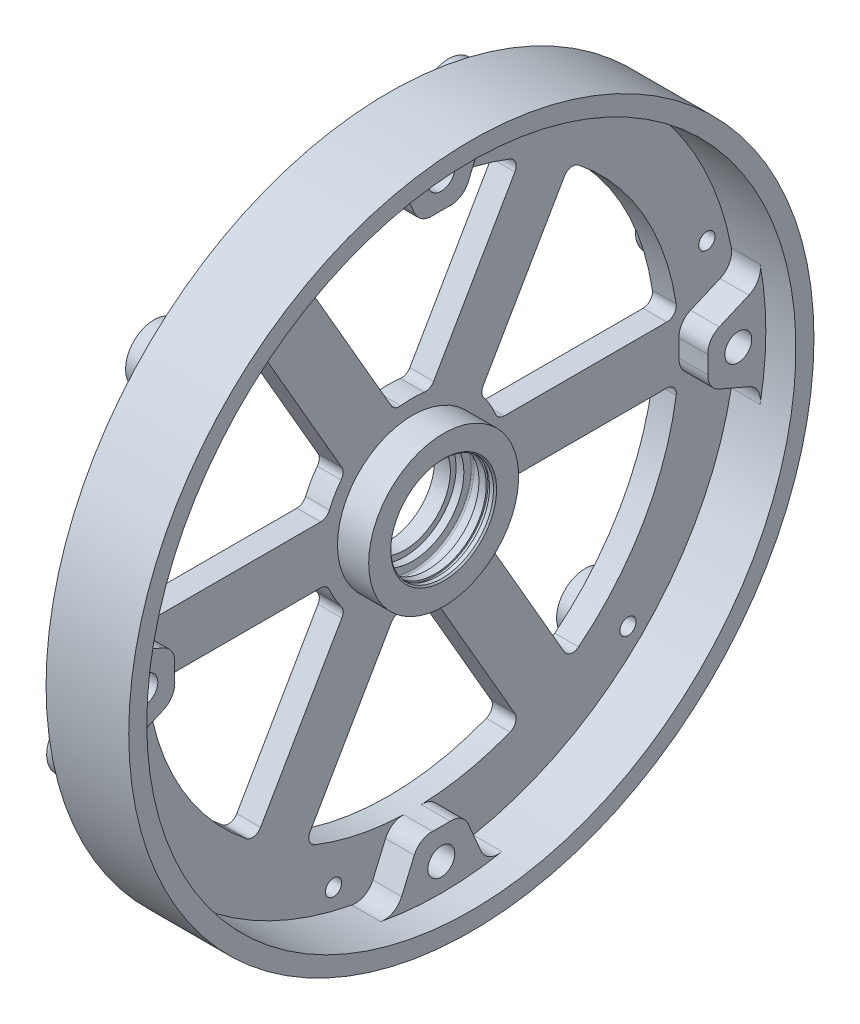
ISO-10303-21;
HEADER;
FILE_DESCRIPTION(('STEP AP214'),'2;1');
FILE_NAME('part.step','',(''),(''),'','','');
FILE_SCHEMA(('AUTOMOTIVE_DESIGN { 1 0 10303 214 1 1 1 1 }'));
ENDSEC;
DATA;
#1=APPLICATION_CONTEXT('core data for automotive mechanical design processes');
#2=APPLICATION_PROTOCOL_DEFINITION('international standard','automotive_design',2000,#1);
#3=PRODUCT_CONTEXT('',#1,'mechanical');
#4=PRODUCT('Part','Part','',(#3));
#5=PRODUCT_RELATED_PRODUCT_CATEGORY('part','',(#4));
#6=PRODUCT_DEFINITION_FORMATION('','',#4);
#7=PRODUCT_DEFINITION_CONTEXT('part definition',#1,'design');
#8=PRODUCT_DEFINITION('design','',#6,#7);
#9=PRODUCT_DEFINITION_SHAPE('','',#8);
#10=(LENGTH_UNIT() NAMED_UNIT(*) SI_UNIT(.MILLI.,.METRE.));
#11=(NAMED_UNIT(*) PLANE_ANGLE_UNIT() SI_UNIT($,.RADIAN.));
#12=(NAMED_UNIT(*) SI_UNIT($,.STERADIAN.) SOLID_ANGLE_UNIT());
#13=UNCERTAINTY_MEASURE_WITH_UNIT(LENGTH_MEASURE(1.E-05),#10,'distance_accuracy_value','');
#14=(GEOMETRIC_REPRESENTATION_CONTEXT(3) GLOBAL_UNCERTAINTY_ASSIGNED_CONTEXT((#13)) GLOBAL_UNIT_ASSIGNED_CONTEXT((#10,
#11,#12)) REPRESENTATION_CONTEXT('',''));
#15=CARTESIAN_POINT('',(0.,0.,0.));
#16=DIRECTION('',(0.,0.,1.));
#17=DIRECTION('',(1.,0.,0.));
#18=AXIS2_PLACEMENT_3D('',#15,#16,#17);
#19=CARTESIAN_POINT('',(-11.7475,7.62,0.));
#20=DIRECTION('',(1.,0.,0.));
#21=DIRECTION('',(0.,0.,-1.));
#22=AXIS2_PLACEMENT_3D('',#19,#20,#21);
#23=PLANE('',#22);
#24=CARTESIAN_POINT('',(-11.7475,49.5000279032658,0.00309462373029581));
#25=DIRECTION('',(-1.,0.,0.));
#26=DIRECTION('',(0.,0.,1.));
#27=AXIS2_PLACEMENT_3D('',#24,#25,#26);
#28=CIRCLE('',#27,4.);
#29=CARTESIAN_POINT('',(-11.7475,49.5000279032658,4.0030946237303));
#30=VERTEX_POINT('',#29);
#31=EDGE_CURVE('E740',#30,#30,#28,.T.);
#32=ORIENTED_EDGE('',*,*,#31,.F.);
#33=EDGE_LOOP('',(#32));
#34=FACE_BOUND('',#33,.T.);
#35=DIRECTION('',(0.,0.,1.));
#36=VECTOR('',#35,1.);
#37=CARTESIAN_POINT('',(-11.7475,4.76249999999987,14.2091093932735));
#38=LINE('',#37,#36);
#39=CARTESIAN_POINT('',(-11.7475,4.76249999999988,15.3087688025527));
#40=VERTEX_POINT('',#39);
#41=CARTESIAN_POINT('',(-11.7475,4.7625,42.3895200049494));
#42=VERTEX_POINT('',#41);
#43=EDGE_CURVE('E839',#40,#42,#38,.T.);
#44=ORIENTED_EDGE('',*,*,#43,.F.);
#45=CARTESIAN_POINT('',(-11.7475,6.34999999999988,15.3087688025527));
#46=DIRECTION('',(1.,0.,0.));
#47=DIRECTION('',(0.,0.,-1.));
#48=AXIS2_PLACEMENT_3D('',#45,#46,#47);
#49=CIRCLE('',#48,1.5875);
#50=CARTESIAN_POINT('',(-11.7475,5.74176245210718,13.8424116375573));
#51=VERTEX_POINT('',#50);
#52=EDGE_CURVE('E1307',#40,#51,#49,.T.);
#53=ORIENTED_EDGE('',*,*,#52,.T.);
#54=CARTESIAN_POINT('',(-11.7475,0.,0.));
#55=DIRECTION('',(1.,0.,0.));
#56=DIRECTION('',(0.,-0.50000000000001,-0.866025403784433));
#57=AXIS2_PLACEMENT_3D('',#54,#55,#56);
#58=CIRCLE('',#57,14.9860000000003);
#59=CARTESIAN_POINT('',(-11.7475,9.11699890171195,11.8937179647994));
#60=VERTEX_POINT('',#59);
#61=EDGE_CURVE('E835',#60,#51,#58,.T.);
#62=ORIENTED_EDGE('',*,*,#61,.F.);
#63=CARTESIAN_POINT('',(-11.7475,10.0827826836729,13.1536457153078));
#64=DIRECTION('',(1.,0.,0.));
#65=DIRECTION('',(0.,0.,-1.));
#66=AXIS2_PLACEMENT_3D('',#63,#64,#65);
#67=CIRCLE('',#66,1.5875);
#68=CARTESIAN_POINT('',(-11.7475,10.8765326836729,11.7788303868));
#69=VERTEX_POINT('',#68);
#70=EDGE_CURVE('E1313',#60,#69,#67,.T.);
#71=ORIENTED_EDGE('',*,*,#70,.T.);
#72=DIRECTION('',(0.,-0.866025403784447,-0.499999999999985));
#73=VECTOR('',#72,1.);
#74=CARTESIAN_POINT('',(-11.7475,9.92419969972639,11.2290006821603));
#75=LINE('',#74,#73);
#76=CARTESIAN_POINT('',(-11.7475,34.3291511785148,25.319205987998));
#77=VERTEX_POINT('',#76);
#78=EDGE_CURVE('E847',#77,#69,#75,.T.);
#79=ORIENTED_EDGE('',*,*,#78,.F.);
#80=CARTESIAN_POINT('',(-11.7475,33.5354011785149,26.6940213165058));
#81=DIRECTION('',(1.,0.,0.));
#82=DIRECTION('',(0.,0.,-1.));
#83=AXIS2_PLACEMENT_3D('',#80,#81,#82);
#84=CIRCLE('',#83,1.5875);
#85=CARTESIAN_POINT('',(-11.7475,34.7774530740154,27.6826887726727));
#86=VERTEX_POINT('',#85);
#87=EDGE_CURVE('E1343',#77,#86,#84,.T.);
#88=ORIENTED_EDGE('',*,*,#87,.T.);
#89=CARTESIAN_POINT('',(-11.7475,0.,0.));
#90=DIRECTION('',(-1.,0.,0.));
#91=DIRECTION('',(0.,-0.50000000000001,-0.866025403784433));
#92=AXIS2_PLACEMENT_3D('',#89,#90,#91);
#93=CIRCLE('',#92,44.45);
#94=CARTESIAN_POINT('',(-11.7475,6.58518518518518,43.9595022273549));
#95=VERTEX_POINT('',#94);
#96=EDGE_CURVE('E843',#95,#86,#93,.T.);
#97=ORIENTED_EDGE('',*,*,#96,.F.);
#98=CARTESIAN_POINT('',(-11.7475,6.35,42.3895200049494));
#99=DIRECTION('',(1.,0.,0.));
#100=DIRECTION('',(0.,0.,-1.));
#101=AXIS2_PLACEMENT_3D('',#98,#99,#100);
#102=CIRCLE('',#101,1.5875);
#103=EDGE_CURVE('E1361',#95,#42,#102,.T.);
#104=ORIENTED_EDGE('',*,*,#103,.T.);
#105=EDGE_LOOP('',(#44,#53,#62,#71,#79,#88,#97,#104));
#106=FACE_BOUND('',#105,.T.);
#107=DIRECTION('',(0.,-0.866025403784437,0.500000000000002));
#108=VECTOR('',#107,1.);
#109=CARTESIAN_POINT('',(-11.7475,-9.92419969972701,11.22900068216));
#110=LINE('',#109,#108);
#111=CARTESIAN_POINT('',(-11.7475,-10.8765326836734,11.7788303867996));
#112=VERTEX_POINT('',#111);
#113=CARTESIAN_POINT('',(-11.7475,-34.3291511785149,25.319205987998));
#114=VERTEX_POINT('',#113);
#115=EDGE_CURVE('E871',#112,#114,#110,.T.);
#116=ORIENTED_EDGE('',*,*,#115,.F.);
#117=CARTESIAN_POINT('',(-11.7475,-10.0827826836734,13.1536457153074));
#118=DIRECTION('',(1.,0.,0.));
#119=DIRECTION('',(0.,0.,-1.));
#120=AXIS2_PLACEMENT_3D('',#117,#118,#119);
#121=CIRCLE('',#120,1.5875);
#122=CARTESIAN_POINT('',(-11.7475,-9.11699890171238,11.8937179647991));
#123=VERTEX_POINT('',#122);
#124=EDGE_CURVE('E1319',#112,#123,#121,.T.);
#125=ORIENTED_EDGE('',*,*,#124,.T.);
#126=CARTESIAN_POINT('',(-11.7475,0.,0.));
#127=DIRECTION('',(1.,0.,0.));
#128=DIRECTION('',(0.,0.499999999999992,-0.866025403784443));
#129=AXIS2_PLACEMENT_3D('',#126,#127,#128);
#130=CIRCLE('',#129,14.9860000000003);
#131=CARTESIAN_POINT('',(-11.7475,-5.74176245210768,13.8424116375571));
#132=VERTEX_POINT('',#131);
#133=EDGE_CURVE('E867',#132,#123,#130,.T.);
#134=ORIENTED_EDGE('',*,*,#133,.F.);
#135=CARTESIAN_POINT('',(-11.7475,-6.35000000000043,15.3087688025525));
#136=DIRECTION('',(1.,0.,0.));
#137=DIRECTION('',(0.,0.,-1.));
#138=AXIS2_PLACEMENT_3D('',#135,#136,#137);
#139=CIRCLE('',#138,1.5875);
#140=CARTESIAN_POINT('',(-11.7475,-4.76250000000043,15.3087688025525));
#141=VERTEX_POINT('',#140);
#142=EDGE_CURVE('E1325',#132,#141,#139,.T.);
#143=ORIENTED_EDGE('',*,*,#142,.T.);
#144=DIRECTION('',(0.,0.,-1.));
#145=VECTOR('',#144,1.);
#146=CARTESIAN_POINT('',(-11.7475,-4.76250000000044,14.2091093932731));
#147=LINE('',#146,#145);
#148=CARTESIAN_POINT('',(-11.7475,-4.76250000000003,42.3895200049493));
#149=VERTEX_POINT('',#148);
#150=EDGE_CURVE('E879',#149,#141,#147,.T.);
#151=ORIENTED_EDGE('',*,*,#150,.F.);
#152=CARTESIAN_POINT('',(-11.7475,-6.35000000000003,42.3895200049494));
#153=DIRECTION('',(1.,0.,0.));
#154=DIRECTION('',(0.,0.,-1.));
#155=AXIS2_PLACEMENT_3D('',#152,#153,#154);
#156=CIRCLE('',#155,1.5875);
#157=CARTESIAN_POINT('',(-11.7475,-6.58518518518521,43.9595022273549));
#158=VERTEX_POINT('',#157);
#159=EDGE_CURVE('E1337',#149,#158,#156,.T.);
#160=ORIENTED_EDGE('',*,*,#159,.T.);
#161=CARTESIAN_POINT('',(-11.7475,0.,0.));
#162=DIRECTION('',(-1.,0.,0.));
#163=DIRECTION('',(0.,0.499999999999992,-0.866025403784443));
#164=AXIS2_PLACEMENT_3D('',#161,#162,#163);
#165=CIRCLE('',#164,44.45);
#166=CARTESIAN_POINT('',(-11.7475,-34.7774530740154,27.6826887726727));
#167=VERTEX_POINT('',#166);
#168=EDGE_CURVE('E875',#167,#158,#165,.T.);
#169=ORIENTED_EDGE('',*,*,#168,.F.);
#170=CARTESIAN_POINT('',(-11.7475,-33.5354011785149,26.6940213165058));
#171=DIRECTION('',(1.,0.,0.));
#172=DIRECTION('',(0.,0.,-1.));
#173=AXIS2_PLACEMENT_3D('',#170,#171,#172);
#174=CIRCLE('',#173,1.5875);
#175=EDGE_CURVE('E1373',#167,#114,#174,.T.);
#176=ORIENTED_EDGE('',*,*,#175,.T.);
#177=EDGE_LOOP('',(#116,#125,#134,#143,#151,#160,#169,#176));
#178=FACE_BOUND('',#177,.T.);
#179=DIRECTION('',(0.,-0.866025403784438,-0.5));
#180=VECTOR('',#179,1.);
#181=CARTESIAN_POINT('',(-11.7475,-14.6866996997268,-2.98010871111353));
#182=LINE('',#181,#180);
#183=CARTESIAN_POINT('',(-11.7475,-15.6390326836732,-3.52993841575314));
#184=VERTEX_POINT('',#183);
#185=CARTESIAN_POINT('',(-11.7475,-39.0916511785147,-17.0703140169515));
#186=VERTEX_POINT('',#185);
#187=EDGE_CURVE('E903',#184,#186,#182,.T.);
#188=ORIENTED_EDGE('',*,*,#187,.F.);
#189=CARTESIAN_POINT('',(-11.7475,-16.4327826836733,-2.15512308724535));
#190=DIRECTION('',(1.,0.,0.));
#191=DIRECTION('',(0.,0.,-1.));
#192=AXIS2_PLACEMENT_3D('',#189,#190,#191);
#193=CIRCLE('',#192,1.5875);
#194=CARTESIAN_POINT('',(-11.7475,-14.8587613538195,-1.94869367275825));
#195=VERTEX_POINT('',#194);
#196=EDGE_CURVE('E1295',#184,#195,#193,.T.);
#197=ORIENTED_EDGE('',*,*,#196,.T.);
#198=CARTESIAN_POINT('',(-11.7475,0.,0.));
#199=DIRECTION('',(1.,0.,0.));
#200=DIRECTION('',(0.,1.,0.));
#201=AXIS2_PLACEMENT_3D('',#198,#199,#200);
#202=CIRCLE('',#201,14.9860000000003);
#203=CARTESIAN_POINT('',(-11.7475,-14.8587613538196,1.94869367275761));
#204=VERTEX_POINT('',#203);
#205=EDGE_CURVE('E899',#204,#195,#202,.T.);
#206=ORIENTED_EDGE('',*,*,#205,.F.);
#207=CARTESIAN_POINT('',(-11.7475,-16.4327826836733,2.15512308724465));
#208=DIRECTION('',(1.,0.,0.));
#209=DIRECTION('',(0.,0.,-1.));
#210=AXIS2_PLACEMENT_3D('',#207,#208,#209);
#211=CIRCLE('',#210,1.5875);
#212=CARTESIAN_POINT('',(-11.7475,-15.6390326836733,3.52993841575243));
#213=VERTEX_POINT('',#212);
#214=EDGE_CURVE('E1301',#204,#213,#211,.T.);
#215=ORIENTED_EDGE('',*,*,#214,.T.);
#216=DIRECTION('',(0.,0.866025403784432,-0.500000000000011));
#217=VECTOR('',#216,1.);
#218=CARTESIAN_POINT('',(-11.7475,-14.6866996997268,2.98010871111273));
#219=LINE('',#218,#217);
#220=CARTESIAN_POINT('',(-11.7475,-39.0916511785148,17.0703140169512));
#221=VERTEX_POINT('',#220);
#222=EDGE_CURVE('E911',#221,#213,#219,.T.);
#223=ORIENTED_EDGE('',*,*,#222,.F.);
#224=CARTESIAN_POINT('',(-11.7475,-39.8854011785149,15.6954986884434));
#225=DIRECTION('',(1.,0.,0.));
#226=DIRECTION('',(0.,0.,-1.));
#227=AXIS2_PLACEMENT_3D('',#224,#225,#226);
#228=CIRCLE('',#227,1.5875);
#229=CARTESIAN_POINT('',(-11.7475,-41.3626382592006,16.276813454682));
#230=VERTEX_POINT('',#229);
#231=EDGE_CURVE('E1331',#221,#230,#228,.T.);
#232=ORIENTED_EDGE('',*,*,#231,.T.);
#233=CARTESIAN_POINT('',(-11.7475,0.,0.));
#234=DIRECTION('',(-1.,0.,0.));
#235=DIRECTION('',(0.,1.,0.));
#236=AXIS2_PLACEMENT_3D('',#233,#234,#235);
#237=CIRCLE('',#236,44.45);
#238=CARTESIAN_POINT('',(-11.7475,-41.3626382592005,-16.2768134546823));
#239=VERTEX_POINT('',#238);
#240=EDGE_CURVE('E907',#239,#230,#237,.T.);
#241=ORIENTED_EDGE('',*,*,#240,.F.);
#242=CARTESIAN_POINT('',(-11.7475,-39.8854011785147,-15.6954986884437));
#243=DIRECTION('',(1.,0.,0.));
#244=DIRECTION('',(0.,0.,-1.));
#245=AXIS2_PLACEMENT_3D('',#242,#243,#244);
#246=CIRCLE('',#245,1.5875);
#247=EDGE_CURVE('E1367',#239,#186,#246,.T.);
#248=ORIENTED_EDGE('',*,*,#247,.T.);
#249=EDGE_LOOP('',(#188,#197,#206,#215,#223,#232,#241,#248));
#250=FACE_BOUND('',#249,.T.);
#251=DIRECTION('',(0.,0.,-1.));
#252=VECTOR('',#251,1.);
#253=CARTESIAN_POINT('',(-11.7475,-4.76249999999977,-14.2091093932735));
#254=LINE('',#253,#252);
#255=CARTESIAN_POINT('',(-11.7475,-4.76249999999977,-15.3087688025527));
#256=VERTEX_POINT('',#255);
#257=CARTESIAN_POINT('',(-11.7475,-4.7624999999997,-42.3895200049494));
#258=VERTEX_POINT('',#257);
#259=EDGE_CURVE('E935',#256,#258,#254,.T.);
#260=ORIENTED_EDGE('',*,*,#259,.F.);
#261=CARTESIAN_POINT('',(-11.7475,-6.34999999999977,-15.3087688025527));
#262=DIRECTION('',(1.,0.,0.));
#263=DIRECTION('',(0.,0.,-1.));
#264=AXIS2_PLACEMENT_3D('',#261,#262,#263);
#265=CIRCLE('',#264,1.5875);
#266=CARTESIAN_POINT('',(-11.7475,-5.74176245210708,-13.8424116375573));
#267=VERTEX_POINT('',#266);
#268=EDGE_CURVE('E1289',#256,#267,#265,.T.);
#269=ORIENTED_EDGE('',*,*,#268,.T.);
#270=CARTESIAN_POINT('',(-11.7475,0.,0.));
#271=DIRECTION('',(1.,0.,0.));
#272=DIRECTION('',(0.,0.500000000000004,0.866025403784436));
#273=AXIS2_PLACEMENT_3D('',#270,#271,#272);
#274=CIRCLE('',#273,14.9860000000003);
#275=CARTESIAN_POINT('',(-11.7475,-9.11699890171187,-11.8937179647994));
#276=VERTEX_POINT('',#275);
#277=EDGE_CURVE('E931',#276,#267,#274,.T.);
#278=ORIENTED_EDGE('',*,*,#277,.F.);
#279=CARTESIAN_POINT('',(-11.7475,-10.0827826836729,-13.1536457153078));
#280=DIRECTION('',(1.,0.,0.));
#281=DIRECTION('',(0.,0.,-1.));
#282=AXIS2_PLACEMENT_3D('',#279,#280,#281);
#283=CIRCLE('',#282,1.5875);
#284=CARTESIAN_POINT('',(-11.7475,-10.8765326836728,-11.7788303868));
#285=VERTEX_POINT('',#284);
#286=EDGE_CURVE('E1283',#276,#285,#283,.T.);
#287=ORIENTED_EDGE('',*,*,#286,.T.);
#288=DIRECTION('',(0.,0.866025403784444,0.499999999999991));
#289=VECTOR('',#288,1.);
#290=CARTESIAN_POINT('',(-11.7475,-9.92419969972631,-11.2290006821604));
#291=LINE('',#290,#289);
#292=CARTESIAN_POINT('',(-11.7475,-34.3291511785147,-25.3192059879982));
#293=VERTEX_POINT('',#292);
#294=EDGE_CURVE('E943',#293,#285,#291,.T.);
#295=ORIENTED_EDGE('',*,*,#294,.F.);
#296=CARTESIAN_POINT('',(-11.7475,-33.5354011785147,-26.694021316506));
#297=DIRECTION('',(1.,0.,0.));
#298=DIRECTION('',(0.,0.,-1.));
#299=AXIS2_PLACEMENT_3D('',#296,#297,#298);
#300=CIRCLE('',#299,1.5875);
#301=CARTESIAN_POINT('',(-11.7475,-34.7774530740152,-27.6826887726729));
#302=VERTEX_POINT('',#301);
#303=EDGE_CURVE('E1397',#293,#302,#300,.T.);
#304=ORIENTED_EDGE('',*,*,#303,.T.);
#305=CARTESIAN_POINT('',(-11.7475,0.,0.));
#306=DIRECTION('',(-1.,0.,0.));
#307=DIRECTION('',(0.,0.500000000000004,0.866025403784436));
#308=AXIS2_PLACEMENT_3D('',#305,#306,#307);
#309=CIRCLE('',#308,44.45);
#310=CARTESIAN_POINT('',(-11.7475,-6.58518518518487,-43.9595022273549));
#311=VERTEX_POINT('',#310);
#312=EDGE_CURVE('E939',#311,#302,#309,.T.);
#313=ORIENTED_EDGE('',*,*,#312,.F.);
#314=CARTESIAN_POINT('',(-11.7475,-6.3499999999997,-42.3895200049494));
#315=DIRECTION('',(1.,0.,0.));
#316=DIRECTION('',(0.,0.,-1.));
#317=AXIS2_PLACEMENT_3D('',#314,#315,#316);
#318=CIRCLE('',#317,1.5875);
#319=EDGE_CURVE('E1391',#311,#258,#318,.T.);
#320=ORIENTED_EDGE('',*,*,#319,.T.);
#321=EDGE_LOOP('',(#260,#269,#278,#287,#295,#304,#313,#320));
#322=FACE_BOUND('',#321,.T.);
#323=DIRECTION('',(0.,0.866025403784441,-0.499999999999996));
#324=VECTOR('',#323,1.);
#325=CARTESIAN_POINT('',(-11.7475,9.92419969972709,-11.2290006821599));
#326=LINE('',#325,#324);
#327=CARTESIAN_POINT('',(-11.7475,10.8765326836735,-11.7788303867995));
#328=VERTEX_POINT('',#327);
#329=CARTESIAN_POINT('',(-11.7475,34.3291511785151,-25.3192059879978));
#330=VERTEX_POINT('',#329);
#331=EDGE_CURVE('E967',#328,#330,#326,.T.);
#332=ORIENTED_EDGE('',*,*,#331,.F.);
#333=CARTESIAN_POINT('',(-11.7475,10.0827826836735,-13.1536457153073));
#334=DIRECTION('',(1.,0.,0.));
#335=DIRECTION('',(0.,0.,-1.));
#336=AXIS2_PLACEMENT_3D('',#333,#334,#335);
#337=CIRCLE('',#336,1.5875);
#338=CARTESIAN_POINT('',(-11.7475,9.11699890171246,-11.893717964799));
#339=VERTEX_POINT('',#338);
#340=EDGE_CURVE('E1415',#328,#339,#337,.T.);
#341=ORIENTED_EDGE('',*,*,#340,.T.);
#342=CARTESIAN_POINT('',(-11.7475,0.,0.));
#343=DIRECTION('',(1.,0.,0.));
#344=DIRECTION('',(0.,-0.499999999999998,0.86602540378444));
#345=AXIS2_PLACEMENT_3D('',#342,#343,#344);
#346=CIRCLE('',#345,14.9860000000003);
#347=CARTESIAN_POINT('',(-11.7475,5.74176245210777,-13.842411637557));
#348=VERTEX_POINT('',#347);
#349=EDGE_CURVE('E963',#348,#339,#346,.T.);
#350=ORIENTED_EDGE('',*,*,#349,.F.);
#351=CARTESIAN_POINT('',(-11.7475,6.35000000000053,-15.3087688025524));
#352=DIRECTION('',(1.,0.,0.));
#353=DIRECTION('',(0.,0.,-1.));
#354=AXIS2_PLACEMENT_3D('',#351,#352,#353);
#355=CIRCLE('',#354,1.5875);
#356=CARTESIAN_POINT('',(-11.7475,4.76250000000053,-15.3087688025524));
#357=VERTEX_POINT('',#356);
#358=EDGE_CURVE('E1403',#348,#357,#355,.T.);
#359=ORIENTED_EDGE('',*,*,#358,.T.);
#360=DIRECTION('',(0.,0.,1.));
#361=VECTOR('',#360,1.);
#362=CARTESIAN_POINT('',(-11.7475,4.76250000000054,-14.2091093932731));
#363=LINE('',#362,#361);
#364=CARTESIAN_POINT('',(-11.7475,4.76250000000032,-42.3895200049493));
#365=VERTEX_POINT('',#364);
#366=EDGE_CURVE('E974',#365,#357,#363,.T.);
#367=ORIENTED_EDGE('',*,*,#366,.F.);
#368=CARTESIAN_POINT('',(-11.7475,6.35000000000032,-42.3895200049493));
#369=DIRECTION('',(1.,0.,0.));
#370=DIRECTION('',(0.,0.,-1.));
#371=AXIS2_PLACEMENT_3D('',#368,#369,#370);
#372=CIRCLE('',#371,1.5875);
#373=CARTESIAN_POINT('',(-11.7475,6.58518518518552,-43.9595022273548));
#374=VERTEX_POINT('',#373);
#375=EDGE_CURVE('E1409',#365,#374,#372,.T.);
#376=ORIENTED_EDGE('',*,*,#375,.T.);
#377=CARTESIAN_POINT('',(-11.7475,0.,0.));
#378=DIRECTION('',(-1.,0.,0.));
#379=DIRECTION('',(0.,-0.499999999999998,0.86602540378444));
#380=AXIS2_PLACEMENT_3D('',#377,#378,#379);
#381=CIRCLE('',#380,44.45);
#382=CARTESIAN_POINT('',(-11.7475,34.7774530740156,-27.6826887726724));
#383=VERTEX_POINT('',#382);
#384=EDGE_CURVE('E970',#383,#374,#381,.T.);
#385=ORIENTED_EDGE('',*,*,#384,.F.);
#386=CARTESIAN_POINT('',(-11.7475,33.5354011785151,-26.6940213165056));
#387=DIRECTION('',(1.,0.,0.));
#388=DIRECTION('',(0.,0.,-1.));
#389=AXIS2_PLACEMENT_3D('',#386,#387,#388);
#390=CIRCLE('',#389,1.5875);
#391=EDGE_CURVE('E1420',#383,#330,#390,.T.);
#392=ORIENTED_EDGE('',*,*,#391,.T.);
#393=EDGE_LOOP('',(#332,#341,#350,#359,#367,#376,#385,#392));
#394=FACE_BOUND('',#393,.T.);
#395=DIRECTION('',(0.,0.866025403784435,0.500000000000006));
#396=VECTOR('',#395,1.);
#397=CARTESIAN_POINT('',(-11.7475,14.6866996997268,2.98010871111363));
#398=LINE('',#397,#396);
#399=CARTESIAN_POINT('',(-11.7475,15.6390326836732,3.52993841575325));
#400=VERTEX_POINT('',#399);
#401=CARTESIAN_POINT('',(-11.7475,39.0916511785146,17.0703140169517));
#402=VERTEX_POINT('',#401);
#403=EDGE_CURVE('E996',#400,#402,#398,.T.);
#404=ORIENTED_EDGE('',*,*,#403,.F.);
#405=CARTESIAN_POINT('',(-11.7475,16.4327826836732,2.15512308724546));
#406=DIRECTION('',(1.,0.,0.));
#407=DIRECTION('',(0.,0.,-1.));
#408=AXIS2_PLACEMENT_3D('',#405,#406,#407);
#409=CIRCLE('',#408,1.5875);
#410=CARTESIAN_POINT('',(-11.7475,14.8587613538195,1.94869367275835));
#411=VERTEX_POINT('',#410);
#412=EDGE_CURVE('E1385',#400,#411,#409,.T.);
#413=ORIENTED_EDGE('',*,*,#412,.T.);
#414=CARTESIAN_POINT('',(-11.7475,0.,0.));
#415=DIRECTION('',(1.,0.,0.));
#416=DIRECTION('',(0.,-1.,0.));
#417=AXIS2_PLACEMENT_3D('',#414,#415,#416);
#418=CIRCLE('',#417,14.9860000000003);
#419=CARTESIAN_POINT('',(-11.7475,14.8587613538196,-1.94869367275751));
#420=VERTEX_POINT('',#419);
#421=EDGE_CURVE('E992',#420,#411,#418,.T.);
#422=ORIENTED_EDGE('',*,*,#421,.F.);
#423=CARTESIAN_POINT('',(-11.7475,16.4327826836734,-2.15512308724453));
#424=DIRECTION('',(1.,0.,0.));
#425=DIRECTION('',(0.,0.,-1.));
#426=AXIS2_PLACEMENT_3D('',#423,#424,#425);
#427=CIRCLE('',#426,1.5875);
#428=CARTESIAN_POINT('',(-11.7475,15.6390326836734,-3.52993841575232));
#429=VERTEX_POINT('',#428);
#430=EDGE_CURVE('E1379',#420,#429,#427,.T.);
#431=ORIENTED_EDGE('',*,*,#430,.T.);
#432=DIRECTION('',(0.,-0.866025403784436,0.500000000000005));
#433=VECTOR('',#432,1.);
#434=CARTESIAN_POINT('',(-11.7475,14.6866996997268,-2.98010871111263));
#435=LINE('',#434,#433);
#436=CARTESIAN_POINT('',(-11.7475,39.091651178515,-17.0703140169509));
#437=VERTEX_POINT('',#436);
#438=EDGE_CURVE('E1004',#437,#429,#435,.T.);
#439=ORIENTED_EDGE('',*,*,#438,.F.);
#440=CARTESIAN_POINT('',(-11.7475,39.885401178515,-15.6954986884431));
#441=DIRECTION('',(1.,0.,0.));
#442=DIRECTION('',(0.,0.,-1.));
#443=AXIS2_PLACEMENT_3D('',#440,#441,#442);
#444=CIRCLE('',#443,1.5875);
#445=CARTESIAN_POINT('',(-11.7475,41.3626382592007,-16.2768134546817));
#446=VERTEX_POINT('',#445);
#447=EDGE_CURVE('E1349',#437,#446,#444,.T.);
#448=ORIENTED_EDGE('',*,*,#447,.T.);
#449=CARTESIAN_POINT('',(-11.7475,0.,0.));
#450=DIRECTION('',(-1.,0.,0.));
#451=DIRECTION('',(0.,-1.,0.));
#452=AXIS2_PLACEMENT_3D('',#449,#450,#451);
#453=CIRCLE('',#452,44.45);
#454=CARTESIAN_POINT('',(-11.7475,41.3626382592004,16.2768134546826));
#455=VERTEX_POINT('',#454);
#456=EDGE_CURVE('E1000',#455,#446,#453,.T.);
#457=ORIENTED_EDGE('',*,*,#456,.F.);
#458=CARTESIAN_POINT('',(-11.7475,39.8854011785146,15.695498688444));
#459=DIRECTION('',(1.,0.,0.));
#460=DIRECTION('',(0.,0.,-1.));
#461=AXIS2_PLACEMENT_3D('',#458,#459,#460);
#462=CIRCLE('',#461,1.5875);
#463=EDGE_CURVE('E1355',#455,#402,#462,.T.);
#464=ORIENTED_EDGE('',*,*,#463,.T.);
#465=EDGE_LOOP('',(#404,#413,#422,#431,#439,#448,#457,#464));
#466=FACE_BOUND('',#465,.T.);
#467=CARTESIAN_POINT('',(-11.7475,0.,0.));
#468=DIRECTION('',(-1.,0.,0.));
#469=DIRECTION('',(0.,0.,1.));
#470=AXIS2_PLACEMENT_3D('',#467,#468,#469);
#471=CIRCLE('',#470,7.62);
#472=CARTESIAN_POINT('',(-11.7475,0.,7.62));
#473=VERTEX_POINT('',#472);
#474=EDGE_CURVE('E1032',#473,#473,#471,.T.);
#475=ORIENTED_EDGE('',*,*,#474,.F.);
#476=EDGE_LOOP('',(#475));
#477=FACE_BOUND('',#476,.T.);
#478=CARTESIAN_POINT('',(-11.7475,0.,0.));
#479=DIRECTION('',(-1.,0.,0.));
#480=DIRECTION('',(0.,0.,1.));
#481=AXIS2_PLACEMENT_3D('',#478,#479,#480);
#482=CIRCLE('',#481,57.1119);
#483=CARTESIAN_POINT('',(-11.7475,0.,57.1119));
#484=VERTEX_POINT('',#483);
#485=EDGE_CURVE('E1028',#484,#484,#482,.T.);
#486=ORIENTED_EDGE('',*,*,#485,.T.);
#487=EDGE_LOOP('',(#486));
#488=FACE_BOUND('',#487,.T.);
#489=CARTESIAN_POINT('',(-11.7475,0.00309462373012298,-49.5000279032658));
#490=DIRECTION('',(-1.,0.,0.));
#491=DIRECTION('',(0.,0.,1.));
#492=AXIS2_PLACEMENT_3D('',#489,#490,#491);
#493=CIRCLE('',#492,4.);
#494=CARTESIAN_POINT('',(-11.7475,0.00309462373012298,-45.5000279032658));
#495=VERTEX_POINT('',#494);
#496=EDGE_CURVE('E1075',#495,#495,#493,.T.);
#497=ORIENTED_EDGE('',*,*,#496,.F.);
#498=EDGE_LOOP('',(#497));
#499=FACE_BOUND('',#498,.T.);
#500=CARTESIAN_POINT('',(-11.7475,-49.5000279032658,-0.00309462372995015));
#501=DIRECTION('',(-1.,0.,0.));
#502=DIRECTION('',(0.,0.,1.));
#503=AXIS2_PLACEMENT_3D('',#500,#501,#502);
#504=CIRCLE('',#503,4.);
#505=CARTESIAN_POINT('',(-11.7475,-49.5000279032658,3.99690537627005));
#506=VERTEX_POINT('',#505);
#507=EDGE_CURVE('E1081',#506,#506,#504,.T.);
#508=ORIENTED_EDGE('',*,*,#507,.F.);
#509=EDGE_LOOP('',(#508));
#510=FACE_BOUND('',#509,.T.);
#511=CARTESIAN_POINT('',(-11.7475,-0.00309462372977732,49.5000279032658));
#512=DIRECTION('',(-1.,0.,0.));
#513=DIRECTION('',(0.,0.,1.));
#514=AXIS2_PLACEMENT_3D('',#511,#512,#513);
#515=CIRCLE('',#514,4.);
#516=CARTESIAN_POINT('',(-11.7475,-0.00309462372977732,53.5000279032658));
#517=VERTEX_POINT('',#516);
#518=EDGE_CURVE('E3353',#517,#517,#515,.T.);
#519=ORIENTED_EDGE('',*,*,#518,.F.);
#520=EDGE_LOOP('',(#519));
#521=FACE_BOUND('',#520,.T.);
#522=CARTESIAN_POINT('',(-11.7475,35.9210244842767,35.9210244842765));
#523=DIRECTION('',(1.,0.,0.));
#524=DIRECTION('',(0.,0.,-1.));
#525=AXIS2_PLACEMENT_3D('',#522,#523,#524);
#526=CIRCLE('',#525,4.7625);
#527=CARTESIAN_POINT('',(-11.7475,35.9210244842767,31.1585244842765));
#528=VERTEX_POINT('',#527);
#529=EDGE_CURVE('E1062',#528,#528,#526,.F.);
#530=ORIENTED_EDGE('',*,*,#529,.F.);
#531=EDGE_LOOP('',(#530));
#532=FACE_BOUND('',#531,.T.);
#533=CARTESIAN_POINT('',(-11.7475,-13.148007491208,49.0690319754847));
#534=DIRECTION('',(1.,0.,0.));
#535=DIRECTION('',(0.,0.,-1.));
#536=AXIS2_PLACEMENT_3D('',#533,#534,#535);
#537=CIRCLE('',#536,4.7625);
#538=CARTESIAN_POINT('',(-11.7475,-13.148007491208,44.3065319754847));
#539=VERTEX_POINT('',#538);
#540=EDGE_CURVE('E1096',#539,#539,#537,.F.);
#541=ORIENTED_EDGE('',*,*,#540,.F.);
#542=EDGE_LOOP('',(#541));
#543=FACE_BOUND('',#542,.T.);
#544=CARTESIAN_POINT('',(-11.7475,-49.0690319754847,13.148007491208));
#545=DIRECTION('',(1.,0.,0.));
#546=DIRECTION('',(0.,0.,-1.));
#547=AXIS2_PLACEMENT_3D('',#544,#545,#546);
#548=CIRCLE('',#547,4.7625);
#549=CARTESIAN_POINT('',(-11.7475,-49.0690319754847,8.38550749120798));
#550=VERTEX_POINT('',#549);
#551=EDGE_CURVE('E1100',#550,#550,#548,.F.);
#552=ORIENTED_EDGE('',*,*,#551,.F.);
#553=EDGE_LOOP('',(#552));
#554=FACE_BOUND('',#553,.T.);
#555=CARTESIAN_POINT('',(-11.7475,-35.9210244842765,-35.9210244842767));
#556=DIRECTION('',(1.,0.,0.));
#557=DIRECTION('',(0.,0.,-1.));
#558=AXIS2_PLACEMENT_3D('',#555,#556,#557);
#559=CIRCLE('',#558,4.7625);
#560=CARTESIAN_POINT('',(-11.7475,-35.9210244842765,-40.6835244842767));
#561=VERTEX_POINT('',#560);
#562=EDGE_CURVE('E1104',#561,#561,#559,.F.);
#563=ORIENTED_EDGE('',*,*,#562,.F.);
#564=EDGE_LOOP('',(#563));
#565=FACE_BOUND('',#564,.T.);
#566=CARTESIAN_POINT('',(-11.7475,13.1480074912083,-49.0690319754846));
#567=DIRECTION('',(1.,0.,0.));
#568=DIRECTION('',(0.,0.,-1.));
#569=AXIS2_PLACEMENT_3D('',#566,#567,#568);
#570=CIRCLE('',#569,4.7625);
#571=CARTESIAN_POINT('',(-11.7475,13.1480074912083,-53.8315319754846));
#572=VERTEX_POINT('',#571);
#573=EDGE_CURVE('E1108',#572,#572,#570,.F.);
#574=ORIENTED_EDGE('',*,*,#573,.F.);
#575=EDGE_LOOP('',(#574));
#576=FACE_BOUND('',#575,.T.);
#577=CARTESIAN_POINT('',(-11.7475,49.0690319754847,-13.1480074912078));
#578=DIRECTION('',(1.,0.,0.));
#579=DIRECTION('',(0.,0.,-1.));
#580=AXIS2_PLACEMENT_3D('',#577,#578,#579);
#581=CIRCLE('',#580,4.7625);
#582=CARTESIAN_POINT('',(-11.7475,49.0690319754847,-17.9105074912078));
#583=VERTEX_POINT('',#582);
#584=EDGE_CURVE('E1112',#583,#583,#581,.F.);
#585=ORIENTED_EDGE('',*,*,#584,.F.);
#586=EDGE_LOOP('',(#585));
#587=FACE_BOUND('',#586,.T.);
#588=ADVANCED_FACE('F45',(#34,#106,#178,#250,#322,#394,#466,#477,#488,#499,#510,#521,#532,#543,
#554,#565,#576,#587),#23,.F.);
#589=CARTESIAN_POINT('',(0.,0.,0.));
#590=DIRECTION('',(-1.,0.,0.));
#591=DIRECTION('',(0.,0.,1.));
#592=AXIS2_PLACEMENT_3D('',#589,#590,#591);
#593=CYLINDRICAL_SURFACE('',#592,8.5725);
#594=CARTESIAN_POINT('',(-7.78420856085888,0.,0.));
#595=DIRECTION('',(1.,0.,0.));
#596=DIRECTION('',(0.,0.,-1.));
#597=AXIS2_PLACEMENT_3D('',#594,#595,#596);
#598=CIRCLE('',#597,8.5725);
#599=CARTESIAN_POINT('',(-7.78420856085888,0.,-8.5725));
#600=VERTEX_POINT('',#599);
#601=EDGE_CURVE('E1087',#600,#600,#598,.T.);
#602=ORIENTED_EDGE('',*,*,#601,.T.);
#603=EDGE_LOOP('',(#602));
#604=FACE_BOUND('',#603,.T.);
#605=CARTESIAN_POINT('',(-9.08050000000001,0.,0.));
#606=DIRECTION('',(-1.,0.,0.));
#607=DIRECTION('',(0.,0.,1.));
#608=AXIS2_PLACEMENT_3D('',#605,#606,#607);
#609=CIRCLE('',#608,8.5725);
#610=CARTESIAN_POINT('',(-9.08050000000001,0.,8.5725));
#611=VERTEX_POINT('',#610);
#612=EDGE_CURVE('E1040',#611,#611,#609,.T.);
#613=ORIENTED_EDGE('',*,*,#612,.T.);
#614=EDGE_LOOP('',(#613));
#615=FACE_BOUND('',#614,.T.);
#616=ADVANCED_FACE('F1443',(#604,#615),#593,.F.);
#617=CARTESIAN_POINT('',(-2.83450000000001,0.,0.));
#618=DIRECTION('',(-1.,0.,0.));
#619=DIRECTION('',(0.,0.,1.));
#620=AXIS2_PLACEMENT_3D('',#617,#618,#619);
#621=CIRCLE('',#620,8.5725);
#622=CARTESIAN_POINT('',(-2.83450000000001,0.,8.5725));
#623=VERTEX_POINT('',#622);
#624=EDGE_CURVE('E11',#623,#623,#621,.F.);
#625=ORIENTED_EDGE('',*,*,#624,.T.);
#626=EDGE_LOOP('',(#625));
#627=FACE_BOUND('',#626,.T.);
#628=CARTESIAN_POINT('',(-3.4955,0.,0.));
#629=DIRECTION('',(-1.,0.,0.));
#630=DIRECTION('',(0.,-1.,0.));
#631=AXIS2_PLACEMENT_3D('',#628,#629,#630);
#632=CIRCLE('',#631,8.5725);
#633=CARTESIAN_POINT('',(-3.4955,-8.5725,0.));
#634=VERTEX_POINT('',#633);
#635=EDGE_CURVE('E1092',#634,#634,#632,.T.);
#636=ORIENTED_EDGE('',*,*,#635,.T.);
#637=EDGE_LOOP('',(#636));
#638=FACE_BOUND('',#637,.T.);
#639=ADVANCED_FACE('F1449',(#627,#638),#593,.F.);
#640=CARTESIAN_POINT('',(-5.26487629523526,0.,0.));
#641=DIRECTION('',(-1.,0.,0.));
#642=DIRECTION('',(0.,0.,1.));
#643=AXIS2_PLACEMENT_3D('',#640,#641,#642);
#644=CIRCLE('',#643,8.5725);
#645=CARTESIAN_POINT('',(-5.26487629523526,0.,8.5725));
#646=VERTEX_POINT('',#645);
#647=EDGE_CURVE('E1083',#646,#646,#644,.T.);
#648=ORIENTED_EDGE('',*,*,#647,.T.);
#649=EDGE_LOOP('',(#648));
#650=FACE_BOUND('',#649,.T.);
#651=CARTESIAN_POINT('',(-4.0555,0.,0.));
#652=DIRECTION('',(-1.,0.,0.));
#653=DIRECTION('',(0.,-1.,0.));
#654=AXIS2_PLACEMENT_3D('',#651,#652,#653);
#655=CIRCLE('',#654,8.5725);
#656=CARTESIAN_POINT('',(-4.0555,-8.5725,0.));
#657=VERTEX_POINT('',#656);
#658=EDGE_CURVE('E3341',#657,#657,#655,.T.);
#659=ORIENTED_EDGE('',*,*,#658,.F.);
#660=EDGE_LOOP('',(#659));
#661=FACE_BOUND('',#660,.T.);
#662=ADVANCED_FACE('F1452',(#650,#661),#593,.F.);
#663=CARTESIAN_POINT('',(-7.77875000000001,12.5,0.));
#664=DIRECTION('',(-1.,0.,0.));
#665=DIRECTION('',(0.,0.,1.));
#666=AXIS2_PLACEMENT_3D('',#663,#664,#665);
#667=PLANE('',#666);
#668=CARTESIAN_POINT('',(-7.77875000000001,49.0690319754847,-13.1480074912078));
#669=DIRECTION('',(-1.,0.,0.));
#670=DIRECTION('',(0.,0.,1.));
#671=AXIS2_PLACEMENT_3D('',#668,#669,#670);
#672=CIRCLE('',#671,1.35255);
#673=CARTESIAN_POINT('',(-7.77875000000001,49.0690319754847,-11.7954574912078));
#674=VERTEX_POINT('',#673);
#675=EDGE_CURVE('E3252',#674,#674,#672,.T.);
#676=ORIENTED_EDGE('',*,*,#675,.T.);
#677=EDGE_LOOP('',(#676));
#678=FACE_BOUND('',#677,.T.);
#679=CARTESIAN_POINT('',(-7.77875000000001,13.1480074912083,-49.0690319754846));
#680=DIRECTION('',(-1.,0.,0.));
#681=DIRECTION('',(0.,0.,1.));
#682=AXIS2_PLACEMENT_3D('',#679,#680,#681);
#683=CIRCLE('',#682,1.35255);
#684=CARTESIAN_POINT('',(-7.77875000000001,13.1480074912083,-47.7164819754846));
#685=VERTEX_POINT('',#684);
#686=EDGE_CURVE('E3260',#685,#685,#683,.T.);
#687=ORIENTED_EDGE('',*,*,#686,.T.);
#688=EDGE_LOOP('',(#687));
#689=FACE_BOUND('',#688,.T.);
#690=CARTESIAN_POINT('',(-7.77875000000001,-35.9210244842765,-35.9210244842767));
#691=DIRECTION('',(-1.,0.,0.));
#692=DIRECTION('',(0.,0.,1.));
#693=AXIS2_PLACEMENT_3D('',#690,#691,#692);
#694=CIRCLE('',#693,1.35255);
#695=CARTESIAN_POINT('',(-7.77875000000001,-35.9210244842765,-34.5684744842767));
#696=VERTEX_POINT('',#695);
#697=EDGE_CURVE('E3271',#696,#696,#694,.T.);
#698=ORIENTED_EDGE('',*,*,#697,.T.);
#699=EDGE_LOOP('',(#698));
#700=FACE_BOUND('',#699,.T.);
#701=CARTESIAN_POINT('',(-7.77875000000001,-49.0690319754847,13.148007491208));
#702=DIRECTION('',(-1.,0.,0.));
#703=DIRECTION('',(0.,0.,1.));
#704=AXIS2_PLACEMENT_3D('',#701,#702,#703);
#705=CIRCLE('',#704,1.35255);
#706=CARTESIAN_POINT('',(-7.77875000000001,-49.0690319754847,14.500557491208));
#707=VERTEX_POINT('',#706);
#708=EDGE_CURVE('E3279',#707,#707,#705,.T.);
#709=ORIENTED_EDGE('',*,*,#708,.T.);
#710=EDGE_LOOP('',(#709));
#711=FACE_BOUND('',#710,.T.);
#712=CARTESIAN_POINT('',(-7.77875000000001,-13.148007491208,49.0690319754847));
#713=DIRECTION('',(-1.,0.,0.));
#714=DIRECTION('',(0.,0.,1.));
#715=AXIS2_PLACEMENT_3D('',#712,#713,#714);
#716=CIRCLE('',#715,1.35255);
#717=CARTESIAN_POINT('',(-7.77875000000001,-13.148007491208,50.4215819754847));
#718=VERTEX_POINT('',#717);
#719=EDGE_CURVE('E3287',#718,#718,#716,.T.);
#720=ORIENTED_EDGE('',*,*,#719,.T.);
#721=EDGE_LOOP('',(#720));
#722=FACE_BOUND('',#721,.T.);
#723=CARTESIAN_POINT('',(-7.77875000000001,35.9210244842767,35.9210244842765));
#724=DIRECTION('',(-1.,0.,0.));
#725=DIRECTION('',(0.,0.,1.));
#726=AXIS2_PLACEMENT_3D('',#723,#724,#725);
#727=CIRCLE('',#726,1.35255);
#728=CARTESIAN_POINT('',(-7.77875000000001,35.9210244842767,37.2735744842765));
#729=VERTEX_POINT('',#728);
#730=EDGE_CURVE('E3315',#729,#729,#727,.T.);
#731=ORIENTED_EDGE('',*,*,#730,.T.);
#732=EDGE_LOOP('',(#731));
#733=FACE_BOUND('',#732,.T.);
#734=CARTESIAN_POINT('',(-7.77875000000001,0.,0.));
#735=DIRECTION('',(-1.,0.,0.));
#736=DIRECTION('',(0.,0.,1.));
#737=AXIS2_PLACEMENT_3D('',#734,#735,#736);
#738=CIRCLE('',#737,44.45);
#739=CARTESIAN_POINT('',(-7.77875000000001,6.58518518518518,43.9595022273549));
#740=VERTEX_POINT('',#739);
#741=CARTESIAN_POINT('',(-7.77875000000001,34.7774530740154,27.6826887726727));
#742=VERTEX_POINT('',#741);
#743=EDGE_CURVE('E855',#740,#742,#738,.T.);
#744=ORIENTED_EDGE('',*,*,#743,.T.);
#745=CARTESIAN_POINT('',(-7.77875000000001,33.5354011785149,26.6940213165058));
#746=DIRECTION('',(-1.,0.,0.));
#747=DIRECTION('',(0.,0.,1.));
#748=AXIS2_PLACEMENT_3D('',#745,#746,#747);
#749=CIRCLE('',#748,1.5875);
#750=CARTESIAN_POINT('',(-7.77875000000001,34.3291511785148,25.319205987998));
#751=VERTEX_POINT('',#750);
#752=EDGE_CURVE('E1346',#742,#751,#749,.T.);
#753=ORIENTED_EDGE('',*,*,#752,.T.);
#754=DIRECTION('',(0.,-0.866025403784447,-0.499999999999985));
#755=VECTOR('',#754,1.);
#756=CARTESIAN_POINT('',(-7.77875000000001,6.99374999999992,9.53710475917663));
#757=LINE('',#756,#755);
#758=CARTESIAN_POINT('',(-7.77875000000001,10.8765326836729,11.7788303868));
#759=VERTEX_POINT('',#758);
#760=EDGE_CURVE('E859',#751,#759,#757,.T.);
#761=ORIENTED_EDGE('',*,*,#760,.T.);
#762=CARTESIAN_POINT('',(-7.77875000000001,10.0827826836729,13.1536457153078));
#763=DIRECTION('',(-1.,0.,0.));
#764=DIRECTION('',(0.,0.,1.));
#765=AXIS2_PLACEMENT_3D('',#762,#763,#764);
#766=CIRCLE('',#765,1.5875);
#767=CARTESIAN_POINT('',(-7.77875000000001,9.11699890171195,11.8937179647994));
#768=VERTEX_POINT('',#767);
#769=EDGE_CURVE('E1316',#759,#768,#766,.T.);
#770=ORIENTED_EDGE('',*,*,#769,.T.);
#771=CARTESIAN_POINT('',(-7.77875000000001,0.,0.));
#772=DIRECTION('',(-1.,0.,0.));
#773=DIRECTION('',(0.,0.,1.));
#774=AXIS2_PLACEMENT_3D('',#771,#772,#773);
#775=CIRCLE('',#774,14.9860000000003);
#776=CARTESIAN_POINT('',(-7.77875000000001,5.74176245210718,13.8424116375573));
#777=VERTEX_POINT('',#776);
#778=EDGE_CURVE('E863',#768,#777,#775,.F.);
#779=ORIENTED_EDGE('',*,*,#778,.T.);
#780=CARTESIAN_POINT('',(-7.77875000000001,6.34999999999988,15.3087688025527));
#781=DIRECTION('',(-1.,0.,0.));
#782=DIRECTION('',(0.,0.,1.));
#783=AXIS2_PLACEMENT_3D('',#780,#781,#782);
#784=CIRCLE('',#783,1.5875);
#785=CARTESIAN_POINT('',(-7.77875000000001,4.76249999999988,15.3087688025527));
#786=VERTEX_POINT('',#785);
#787=EDGE_CURVE('E1310',#777,#786,#784,.T.);
#788=ORIENTED_EDGE('',*,*,#787,.T.);
#789=DIRECTION('',(0.,0.,1.));
#790=VECTOR('',#789,1.);
#791=CARTESIAN_POINT('',(-7.77875000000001,4.76249999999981,0.));
#792=LINE('',#791,#790);
#793=CARTESIAN_POINT('',(-7.77875000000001,4.7625,42.3895200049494));
#794=VERTEX_POINT('',#793);
#795=EDGE_CURVE('E851',#786,#794,#792,.T.);
#796=ORIENTED_EDGE('',*,*,#795,.T.);
#797=CARTESIAN_POINT('',(-7.77875000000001,6.35,42.3895200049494));
#798=DIRECTION('',(-1.,0.,0.));
#799=DIRECTION('',(0.,0.,1.));
#800=AXIS2_PLACEMENT_3D('',#797,#798,#799);
#801=CIRCLE('',#800,1.5875);
#802=EDGE_CURVE('E1364',#794,#740,#801,.T.);
#803=ORIENTED_EDGE('',*,*,#802,.T.);
#804=EDGE_LOOP('',(#744,#753,#761,#770,#779,#788,#796,#803));
#805=FACE_BOUND('',#804,.T.);
#806=CARTESIAN_POINT('',(-7.77875000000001,0.,0.));
#807=DIRECTION('',(-1.,0.,0.));
#808=DIRECTION('',(0.,0.,1.));
#809=AXIS2_PLACEMENT_3D('',#806,#807,#808);
#810=CIRCLE('',#809,44.45);
#811=CARTESIAN_POINT('',(-7.77875000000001,-34.7774530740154,27.6826887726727));
#812=VERTEX_POINT('',#811);
#813=CARTESIAN_POINT('',(-7.77875000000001,-6.58518518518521,43.9595022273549));
#814=VERTEX_POINT('',#813);
#815=EDGE_CURVE('E887',#812,#814,#810,.T.);
#816=ORIENTED_EDGE('',*,*,#815,.T.);
#817=CARTESIAN_POINT('',(-7.77875000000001,-6.35000000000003,42.3895200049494));
#818=DIRECTION('',(-1.,0.,0.));
#819=DIRECTION('',(0.,0.,1.));
#820=AXIS2_PLACEMENT_3D('',#817,#818,#819);
#821=CIRCLE('',#820,1.5875);
#822=CARTESIAN_POINT('',(-7.77875000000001,-4.76250000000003,42.3895200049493));
#823=VERTEX_POINT('',#822);
#824=EDGE_CURVE('E1340',#814,#823,#821,.T.);
#825=ORIENTED_EDGE('',*,*,#824,.T.);
#826=DIRECTION('',(0.,0.,-1.));
#827=VECTOR('',#826,1.);
#828=CARTESIAN_POINT('',(-7.77875000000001,-4.76250000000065,2.5393923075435E-13));
#829=LINE('',#828,#827);
#830=CARTESIAN_POINT('',(-7.77875000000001,-4.76250000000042,15.3087688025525));
#831=VERTEX_POINT('',#830);
#832=EDGE_CURVE('E891',#823,#831,#829,.T.);
#833=ORIENTED_EDGE('',*,*,#832,.T.);
#834=CARTESIAN_POINT('',(-7.77875000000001,-6.35000000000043,15.3087688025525));
#835=DIRECTION('',(-1.,0.,0.));
#836=DIRECTION('',(0.,0.,1.));
#837=AXIS2_PLACEMENT_3D('',#834,#835,#836);
#838=CIRCLE('',#837,1.5875);
#839=CARTESIAN_POINT('',(-7.77875000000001,-5.74176245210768,13.8424116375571));
#840=VERTEX_POINT('',#839);
#841=EDGE_CURVE('E1328',#831,#840,#838,.T.);
#842=ORIENTED_EDGE('',*,*,#841,.T.);
#843=CARTESIAN_POINT('',(-7.77875000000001,0.,0.));
#844=DIRECTION('',(-1.,0.,0.));
#845=DIRECTION('',(0.,0.,1.));
#846=AXIS2_PLACEMENT_3D('',#843,#844,#845);
#847=CIRCLE('',#846,14.9860000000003);
#848=CARTESIAN_POINT('',(-7.77875000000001,-9.11699890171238,11.8937179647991));
#849=VERTEX_POINT('',#848);
#850=EDGE_CURVE('E895',#840,#849,#847,.F.);
#851=ORIENTED_EDGE('',*,*,#850,.T.);
#852=CARTESIAN_POINT('',(-7.77875000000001,-10.0827826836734,13.1536457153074));
#853=DIRECTION('',(-1.,0.,0.));
#854=DIRECTION('',(0.,0.,1.));
#855=AXIS2_PLACEMENT_3D('',#852,#853,#854);
#856=CIRCLE('',#855,1.5875);
#857=CARTESIAN_POINT('',(-7.77875000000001,-10.8765326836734,11.7788303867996));
#858=VERTEX_POINT('',#857);
#859=EDGE_CURVE('E1322',#849,#858,#856,.T.);
#860=ORIENTED_EDGE('',*,*,#859,.T.);
#861=DIRECTION('',(0.,-0.866025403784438,0.500000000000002));
#862=VECTOR('',#861,1.);
#863=CARTESIAN_POINT('',(-7.77875000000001,11.7562499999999,-1.28821278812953));
#864=LINE('',#863,#862);
#865=CARTESIAN_POINT('',(-7.77875000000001,-34.3291511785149,25.319205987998));
#866=VERTEX_POINT('',#865);
#867=EDGE_CURVE('E883',#858,#866,#864,.T.);
#868=ORIENTED_EDGE('',*,*,#867,.T.);
#869=CARTESIAN_POINT('',(-7.77875000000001,-33.5354011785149,26.6940213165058));
#870=DIRECTION('',(-1.,0.,0.));
#871=DIRECTION('',(0.,0.,1.));
#872=AXIS2_PLACEMENT_3D('',#869,#870,#871);
#873=CIRCLE('',#872,1.5875);
#874=EDGE_CURVE('E1376',#866,#812,#873,.T.);
#875=ORIENTED_EDGE('',*,*,#874,.T.);
#876=EDGE_LOOP('',(#816,#825,#833,#842,#851,#860,#868,#875));
#877=FACE_BOUND('',#876,.T.);
#878=CARTESIAN_POINT('',(-7.77875000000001,0.,0.));
#879=DIRECTION('',(-1.,0.,0.));
#880=DIRECTION('',(0.,0.,1.));
#881=AXIS2_PLACEMENT_3D('',#878,#879,#880);
#882=CIRCLE('',#881,44.45);
#883=CARTESIAN_POINT('',(-7.77875000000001,-6.58518518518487,-43.9595022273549));
#884=VERTEX_POINT('',#883);
#885=CARTESIAN_POINT('',(-7.77875000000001,-34.7774530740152,-27.6826887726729));
#886=VERTEX_POINT('',#885);
#887=EDGE_CURVE('E951',#884,#886,#882,.T.);
#888=ORIENTED_EDGE('',*,*,#887,.T.);
#889=CARTESIAN_POINT('',(-7.77875000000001,-33.5354011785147,-26.694021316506));
#890=DIRECTION('',(-1.,0.,0.));
#891=DIRECTION('',(0.,0.,1.));
#892=AXIS2_PLACEMENT_3D('',#889,#890,#891);
#893=CIRCLE('',#892,1.5875);
#894=CARTESIAN_POINT('',(-7.77875000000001,-34.3291511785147,-25.3192059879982));
#895=VERTEX_POINT('',#894);
#896=EDGE_CURVE('E1400',#886,#895,#893,.T.);
#897=ORIENTED_EDGE('',*,*,#896,.T.);
#898=DIRECTION('',(0.,0.866025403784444,0.499999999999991));
#899=VECTOR('',#898,1.);
#900=CARTESIAN_POINT('',(-7.77875000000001,11.7562500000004,1.2882127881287));
#901=LINE('',#900,#899);
#902=CARTESIAN_POINT('',(-7.77875000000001,-10.8765326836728,-11.7788303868));
#903=VERTEX_POINT('',#902);
#904=EDGE_CURVE('E955',#895,#903,#901,.T.);
#905=ORIENTED_EDGE('',*,*,#904,.T.);
#906=CARTESIAN_POINT('',(-7.77875000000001,-10.0827826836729,-13.1536457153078));
#907=DIRECTION('',(-1.,0.,0.));
#908=DIRECTION('',(0.,0.,1.));
#909=AXIS2_PLACEMENT_3D('',#906,#907,#908);
#910=CIRCLE('',#909,1.5875);
#911=CARTESIAN_POINT('',(-7.77875000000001,-9.11699890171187,-11.8937179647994));
#912=VERTEX_POINT('',#911);
#913=EDGE_CURVE('E1286',#903,#912,#910,.T.);
#914=ORIENTED_EDGE('',*,*,#913,.T.);
#915=CARTESIAN_POINT('',(-7.77875000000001,0.,0.));
#916=DIRECTION('',(-1.,0.,0.));
#917=DIRECTION('',(0.,0.,1.));
#918=AXIS2_PLACEMENT_3D('',#915,#916,#917);
#919=CIRCLE('',#918,14.9860000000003);
#920=CARTESIAN_POINT('',(-7.77875000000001,-5.74176245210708,-13.8424116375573));
#921=VERTEX_POINT('',#920);
#922=EDGE_CURVE('E959',#912,#921,#919,.F.);
#923=ORIENTED_EDGE('',*,*,#922,.T.);
#924=CARTESIAN_POINT('',(-7.77875000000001,-6.34999999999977,-15.3087688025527));
#925=DIRECTION('',(-1.,0.,0.));
#926=DIRECTION('',(0.,0.,1.));
#927=AXIS2_PLACEMENT_3D('',#924,#925,#926);
#928=CIRCLE('',#927,1.5875);
#929=CARTESIAN_POINT('',(-7.77875000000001,-4.76249999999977,-15.3087688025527));
#930=VERTEX_POINT('',#929);
#931=EDGE_CURVE('E1292',#921,#930,#928,.T.);
#932=ORIENTED_EDGE('',*,*,#931,.T.);
#933=DIRECTION('',(0.,0.,-1.));
#934=VECTOR('',#933,1.);
#935=CARTESIAN_POINT('',(-7.77875000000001,-4.76249999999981,0.));
#936=LINE('',#935,#934);
#937=CARTESIAN_POINT('',(-7.77875000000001,-4.7624999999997,-42.3895200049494));
#938=VERTEX_POINT('',#937);
#939=EDGE_CURVE('E947',#930,#938,#936,.T.);
#940=ORIENTED_EDGE('',*,*,#939,.T.);
#941=CARTESIAN_POINT('',(-7.77875000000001,-6.3499999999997,-42.3895200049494));
#942=DIRECTION('',(-1.,0.,0.));
#943=DIRECTION('',(0.,0.,1.));
#944=AXIS2_PLACEMENT_3D('',#941,#942,#943);
#945=CIRCLE('',#944,1.5875);
#946=EDGE_CURVE('E1394',#938,#884,#945,.T.);
#947=ORIENTED_EDGE('',*,*,#946,.T.);
#948=EDGE_LOOP('',(#888,#897,#905,#914,#923,#932,#940,#947));
#949=FACE_BOUND('',#948,.T.);
#950=CARTESIAN_POINT('',(-7.77875000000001,0.,0.));
#951=DIRECTION('',(-1.,0.,0.));
#952=DIRECTION('',(0.,0.,1.));
#953=AXIS2_PLACEMENT_3D('',#950,#951,#952);
#954=CIRCLE('',#953,44.45);
#955=CARTESIAN_POINT('',(-7.77875000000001,34.7774530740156,-27.6826887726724));
#956=VERTEX_POINT('',#955);
#957=CARTESIAN_POINT('',(-7.77875000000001,6.58518518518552,-43.9595022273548));
#958=VERTEX_POINT('',#957);
#959=EDGE_CURVE('E981',#956,#958,#954,.T.);
#960=ORIENTED_EDGE('',*,*,#959,.T.);
#961=CARTESIAN_POINT('',(-7.77875000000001,6.35000000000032,-42.3895200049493));
#962=DIRECTION('',(-1.,0.,0.));
#963=DIRECTION('',(0.,0.,1.));
#964=AXIS2_PLACEMENT_3D('',#961,#962,#963);
#965=CIRCLE('',#964,1.5875);
#966=CARTESIAN_POINT('',(-7.77875000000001,4.76250000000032,-42.3895200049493));
#967=VERTEX_POINT('',#966);
#968=EDGE_CURVE('E1412',#958,#967,#965,.T.);
#969=ORIENTED_EDGE('',*,*,#968,.T.);
#970=DIRECTION('',(0.,0.,1.));
#971=VECTOR('',#970,1.);
#972=CARTESIAN_POINT('',(-7.77875000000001,4.76250000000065,0.));
#973=LINE('',#972,#971);
#974=CARTESIAN_POINT('',(-7.77875000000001,4.76250000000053,-15.3087688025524));
#975=VERTEX_POINT('',#974);
#976=EDGE_CURVE('E985',#967,#975,#973,.T.);
#977=ORIENTED_EDGE('',*,*,#976,.T.);
#978=CARTESIAN_POINT('',(-7.77875000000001,6.35000000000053,-15.3087688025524));
#979=DIRECTION('',(-1.,0.,0.));
#980=DIRECTION('',(0.,0.,1.));
#981=AXIS2_PLACEMENT_3D('',#978,#979,#980);
#982=CIRCLE('',#981,1.5875);
#983=CARTESIAN_POINT('',(-7.77875000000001,5.74176245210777,-13.842411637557));
#984=VERTEX_POINT('',#983);
#985=EDGE_CURVE('E1406',#975,#984,#982,.T.);
#986=ORIENTED_EDGE('',*,*,#985,.T.);
#987=CARTESIAN_POINT('',(-7.77875000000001,0.,0.));
#988=DIRECTION('',(-1.,0.,0.));
#989=DIRECTION('',(0.,0.,1.));
#990=AXIS2_PLACEMENT_3D('',#987,#988,#989);
#991=CIRCLE('',#990,14.9860000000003);
#992=CARTESIAN_POINT('',(-7.77875000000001,9.11699890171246,-11.893717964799));
#993=VERTEX_POINT('',#992);
#994=EDGE_CURVE('E989',#984,#993,#991,.F.);
#995=ORIENTED_EDGE('',*,*,#994,.T.);
#996=CARTESIAN_POINT('',(-7.77875000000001,10.0827826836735,-13.1536457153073));
#997=DIRECTION('',(-1.,0.,0.));
#998=DIRECTION('',(0.,0.,1.));
#999=AXIS2_PLACEMENT_3D('',#996,#997,#998);
#1000=CIRCLE('',#999,1.5875);
#1001=CARTESIAN_POINT('',(-7.77875000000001,10.8765326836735,-11.7788303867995));
#1002=VERTEX_POINT('',#1001);
#1003=EDGE_CURVE('E68',#993,#1002,#1000,.T.);
#1004=ORIENTED_EDGE('',*,*,#1003,.T.);
#1005=DIRECTION('',(0.,0.866025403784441,-0.499999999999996));
#1006=VECTOR('',#1005,1.);
#1007=CARTESIAN_POINT('',(-7.77875000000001,6.99375000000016,-9.53710475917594));
#1008=LINE('',#1007,#1006);
#1009=CARTESIAN_POINT('',(-7.77875000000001,34.3291511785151,-25.3192059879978));
#1010=VERTEX_POINT('',#1009);
#1011=EDGE_CURVE('E978',#1002,#1010,#1008,.T.);
#1012=ORIENTED_EDGE('',*,*,#1011,.T.);
#1013=CARTESIAN_POINT('',(-7.77875000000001,33.5354011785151,-26.6940213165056));
#1014=DIRECTION('',(-1.,0.,0.));
#1015=DIRECTION('',(0.,0.,1.));
#1016=AXIS2_PLACEMENT_3D('',#1013,#1014,#1015);
#1017=CIRCLE('',#1016,1.5875);
#1018=EDGE_CURVE('E1423',#1010,#956,#1017,.T.);
#1019=ORIENTED_EDGE('',*,*,#1018,.T.);
#1020=EDGE_LOOP('',(#960,#969,#977,#986,#995,#1004,#1012,#1019));
#1021=FACE_BOUND('',#1020,.T.);
#1022=CARTESIAN_POINT('',(-7.77875000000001,0.,0.));
#1023=DIRECTION('',(-1.,0.,0.));
#1024=DIRECTION('',(0.,0.,1.));
#1025=AXIS2_PLACEMENT_3D('',#1022,#1023,#1024);
#1026=CIRCLE('',#1025,12.5);
#1027=CARTESIAN_POINT('',(-7.77875000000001,0.,12.5));
#1028=VERTEX_POINT('',#1027);
#1029=EDGE_CURVE('E1048',#1028,#1028,#1026,.T.);
#1030=ORIENTED_EDGE('',*,*,#1029,.T.);
#1031=EDGE_LOOP('',(#1030));
#1032=FACE_BOUND('',#1031,.T.);
#1033=CARTESIAN_POINT('',(-7.77875000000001,9.52500000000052,50.0283290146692));
#1034=DIRECTION('',(-1.,0.,0.));
#1035=DIRECTION('',(0.,1.,0.));
#1036=AXIS2_PLACEMENT_3D('',#1033,#1034,#1035);
#1037=CIRCLE('',#1036,3.17499999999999);
#1038=CARTESIAN_POINT('',(-7.77875000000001,6.60681011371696,51.2792457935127));
#1039=VERTEX_POINT('',#1038);
#1040=CARTESIAN_POINT('',(-7.77875000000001,10.1188279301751,53.1473021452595));
#1041=VERTEX_POINT('',#1040);
#1042=EDGE_CURVE('E3413',#1039,#1041,#1037,.T.);
#1043=ORIENTED_EDGE('',*,*,#1042,.F.);
#1044=DIRECTION('',(0.,0.393989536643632,0.919114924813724));
#1045=VECTOR('',#1044,1.);
#1046=CARTESIAN_POINT('',(-7.77875000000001,6.60681011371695,51.2792457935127));
#1047=LINE('',#1046,#1045);
#1048=CARTESIAN_POINT('',(-7.77875000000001,4.49298988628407,46.3480394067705));
#1049=VERTEX_POINT('',#1048);
#1050=EDGE_CURVE('E3410',#1049,#1039,#1047,.T.);
#1051=ORIENTED_EDGE('',*,*,#1050,.F.);
#1052=CARTESIAN_POINT('',(-7.77875000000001,1.5748000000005,47.598956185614));
#1053=DIRECTION('',(1.,0.,0.));
#1054=DIRECTION('',(0.,1.,0.));
#1055=AXIS2_PLACEMENT_3D('',#1052,#1053,#1054);
#1056=CIRCLE('',#1055,3.175);
#1057=CARTESIAN_POINT('',(-7.77875000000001,1.4698133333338,44.4256924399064));
#1058=VERTEX_POINT('',#1057);
#1059=EDGE_CURVE('E3407',#1058,#1049,#1056,.T.);
#1060=ORIENTED_EDGE('',*,*,#1059,.F.);
#1061=CARTESIAN_POINT('',(-7.77875000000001,0.,0.));
#1062=DIRECTION('',(-1.,0.,0.));
#1063=DIRECTION('',(0.,1.,0.));
#1064=AXIS2_PLACEMENT_3D('',#1061,#1062,#1063);
#1065=CIRCLE('',#1064,44.45);
#1066=CARTESIAN_POINT('',(-7.77875000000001,-1.46981333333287,44.4256924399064));
#1067=VERTEX_POINT('',#1066);
#1068=EDGE_CURVE('E3404',#1067,#1058,#1065,.T.);
#1069=ORIENTED_EDGE('',*,*,#1068,.F.);
#1070=CARTESIAN_POINT('',(-7.77875000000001,-1.5747999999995,47.598956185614));
#1071=DIRECTION('',(1.,0.,0.));
#1072=DIRECTION('',(0.,1.,0.));
#1073=AXIS2_PLACEMENT_3D('',#1070,#1071,#1072);
#1074=CIRCLE('',#1073,3.175);
#1075=CARTESIAN_POINT('',(-7.77875000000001,-4.4929898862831,46.3480394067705));
#1076=VERTEX_POINT('',#1075);
#1077=EDGE_CURVE('E570',#1076,#1067,#1074,.T.);
#1078=ORIENTED_EDGE('',*,*,#1077,.F.);
#1079=DIRECTION('',(0.,0.393989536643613,-0.919114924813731));
#1080=VECTOR('',#1079,1.);
#1081=CARTESIAN_POINT('',(-7.77875000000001,-6.60681011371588,51.2792457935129));
#1082=LINE('',#1081,#1080);
#1083=CARTESIAN_POINT('',(-7.77875000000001,-6.60681011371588,51.2792457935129));
#1084=VERTEX_POINT('',#1083);
#1085=EDGE_CURVE('E566',#1084,#1076,#1082,.T.);
#1086=ORIENTED_EDGE('',*,*,#1085,.F.);
#1087=CARTESIAN_POINT('',(-7.77875000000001,-9.52499999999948,50.0283290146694));
#1088=DIRECTION('',(-1.,0.,0.));
#1089=DIRECTION('',(0.,1.,0.));
#1090=AXIS2_PLACEMENT_3D('',#1087,#1088,#1089);
#1091=CIRCLE('',#1090,3.17499999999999);
#1092=CARTESIAN_POINT('',(-7.77875000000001,-10.118827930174,53.1473021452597));
#1093=VERTEX_POINT('',#1092);
#1094=EDGE_CURVE('E3416',#1093,#1084,#1091,.T.);
#1095=ORIENTED_EDGE('',*,*,#1094,.F.);
#1096=CARTESIAN_POINT('',(-7.77875000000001,0.,0.));
#1097=DIRECTION('',(-1.,0.,0.));
#1098=DIRECTION('',(0.,0.,1.));
#1099=AXIS2_PLACEMENT_3D('',#1096,#1097,#1098);
#1100=CIRCLE('',#1099,54.102);
#1101=CARTESIAN_POINT('',(-7.77875000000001,-53.1473021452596,10.1188279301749));
#1102=VERTEX_POINT('',#1101);
#1103=EDGE_CURVE('E1709',#1102,#1093,#1100,.T.);
#1104=ORIENTED_EDGE('',*,*,#1103,.F.);
#1105=CARTESIAN_POINT('',(-7.77875000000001,-50.0283290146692,9.52500000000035));
#1106=DIRECTION('',(-1.,0.,0.));
#1107=DIRECTION('',(0.,0.,1.));
#1108=AXIS2_PLACEMENT_3D('',#1105,#1106,#1107);
#1109=CIRCLE('',#1108,3.17499999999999);
#1110=CARTESIAN_POINT('',(-7.77875000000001,-51.2792457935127,6.60681011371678));
#1111=VERTEX_POINT('',#1110);
#1112=EDGE_CURVE('E621',#1111,#1102,#1109,.T.);
#1113=ORIENTED_EDGE('',*,*,#1112,.F.);
#1114=DIRECTION('',(0.,-0.919114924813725,0.393989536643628));
#1115=VECTOR('',#1114,1.);
#1116=CARTESIAN_POINT('',(-7.77875000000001,-51.2792457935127,6.60681011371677));
#1117=LINE('',#1116,#1115);
#1118=CARTESIAN_POINT('',(-7.77875000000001,-46.3480394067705,4.49298988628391));
#1119=VERTEX_POINT('',#1118);
#1120=EDGE_CURVE('E617',#1119,#1111,#1117,.T.);
#1121=ORIENTED_EDGE('',*,*,#1120,.F.);
#1122=CARTESIAN_POINT('',(-7.77875000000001,-47.598956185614,1.57480000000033));
#1123=DIRECTION('',(1.,0.,0.));
#1124=DIRECTION('',(0.,0.,1.));
#1125=AXIS2_PLACEMENT_3D('',#1122,#1123,#1124);
#1126=CIRCLE('',#1125,3.175);
#1127=CARTESIAN_POINT('',(-7.77875000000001,-44.4256924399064,1.46981333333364));
#1128=VERTEX_POINT('',#1127);
#1129=EDGE_CURVE('E579',#1128,#1119,#1126,.T.);
#1130=ORIENTED_EDGE('',*,*,#1129,.F.);
#1131=CARTESIAN_POINT('',(-7.77875000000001,0.,0.));
#1132=DIRECTION('',(-1.,0.,0.));
#1133=DIRECTION('',(0.,0.,1.));
#1134=AXIS2_PLACEMENT_3D('',#1131,#1132,#1133);
#1135=CIRCLE('',#1134,44.45);
#1136=CARTESIAN_POINT('',(-7.77875000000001,-41.3626382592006,16.276813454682));
#1137=VERTEX_POINT('',#1136);
#1138=EDGE_CURVE('E919',#1128,#1137,#1135,.T.);
#1139=ORIENTED_EDGE('',*,*,#1138,.T.);
#1140=CARTESIAN_POINT('',(-7.77875000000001,-39.8854011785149,15.6954986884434));
#1141=DIRECTION('',(-1.,0.,0.));
#1142=DIRECTION('',(0.,0.,1.));
#1143=AXIS2_PLACEMENT_3D('',#1140,#1141,#1142);
#1144=CIRCLE('',#1143,1.5875);
#1145=CARTESIAN_POINT('',(-7.77875000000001,-39.0916511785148,17.0703140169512));
#1146=VERTEX_POINT('',#1145);
#1147=EDGE_CURVE('E1334',#1137,#1146,#1144,.T.);
#1148=ORIENTED_EDGE('',*,*,#1147,.T.);
#1149=DIRECTION('',(0.,0.866025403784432,-0.500000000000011));
#1150=VECTOR('',#1149,1.);
#1151=CARTESIAN_POINT('',(-7.77875000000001,6.99374999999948,-9.53710475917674));
#1152=LINE('',#1151,#1150);
#1153=CARTESIAN_POINT('',(-7.77875000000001,-15.6390326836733,3.52993841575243));
#1154=VERTEX_POINT('',#1153);
#1155=EDGE_CURVE('E923',#1146,#1154,#1152,.T.);
#1156=ORIENTED_EDGE('',*,*,#1155,.T.);
#1157=CARTESIAN_POINT('',(-7.77875000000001,-16.4327826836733,2.15512308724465));
#1158=DIRECTION('',(-1.,0.,0.));
#1159=DIRECTION('',(0.,0.,1.));
#1160=AXIS2_PLACEMENT_3D('',#1157,#1158,#1159);
#1161=CIRCLE('',#1160,1.5875);
#1162=CARTESIAN_POINT('',(-7.77875000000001,-14.8587613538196,1.94869367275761));
#1163=VERTEX_POINT('',#1162);
#1164=EDGE_CURVE('E1304',#1154,#1163,#1161,.T.);
#1165=ORIENTED_EDGE('',*,*,#1164,.T.);
#1166=CARTESIAN_POINT('',(-7.77875000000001,0.,0.));
#1167=DIRECTION('',(-1.,0.,0.));
#1168=DIRECTION('',(0.,0.,1.));
#1169=AXIS2_PLACEMENT_3D('',#1166,#1167,#1168);
#1170=CIRCLE('',#1169,14.9860000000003);
#1171=CARTESIAN_POINT('',(-7.77875000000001,-14.8587613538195,-1.94869367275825));
#1172=VERTEX_POINT('',#1171);
#1173=EDGE_CURVE('E927',#1163,#1172,#1170,.F.);
#1174=ORIENTED_EDGE('',*,*,#1173,.T.);
#1175=CARTESIAN_POINT('',(-7.77875000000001,-16.4327826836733,-2.15512308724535));
#1176=DIRECTION('',(-1.,0.,0.));
#1177=DIRECTION('',(0.,0.,1.));
#1178=AXIS2_PLACEMENT_3D('',#1175,#1176,#1177);
#1179=CIRCLE('',#1178,1.5875);
#1180=CARTESIAN_POINT('',(-7.77875000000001,-15.6390326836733,-3.52993841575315));
#1181=VERTEX_POINT('',#1180);
#1182=EDGE_CURVE('E1298',#1172,#1181,#1179,.T.);
#1183=ORIENTED_EDGE('',*,*,#1182,.T.);
#1184=DIRECTION('',(0.,-0.866025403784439,-0.5));
#1185=VECTOR('',#1184,1.);
#1186=CARTESIAN_POINT('',(-7.77875000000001,6.99375000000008,9.53710475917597));
#1187=LINE('',#1186,#1185);
#1188=CARTESIAN_POINT('',(-7.77875000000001,-39.0916511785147,-17.0703140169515));
#1189=VERTEX_POINT('',#1188);
#1190=EDGE_CURVE('E915',#1181,#1189,#1187,.T.);
#1191=ORIENTED_EDGE('',*,*,#1190,.T.);
#1192=CARTESIAN_POINT('',(-7.77875000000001,-39.8854011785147,-15.6954986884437));
#1193=DIRECTION('',(-1.,0.,0.));
#1194=DIRECTION('',(0.,0.,1.));
#1195=AXIS2_PLACEMENT_3D('',#1192,#1193,#1194);
#1196=CIRCLE('',#1195,1.5875);
#1197=CARTESIAN_POINT('',(-7.77875000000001,-41.3626382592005,-16.2768134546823));
#1198=VERTEX_POINT('',#1197);
#1199=EDGE_CURVE('E1370',#1189,#1198,#1196,.T.);
#1200=ORIENTED_EDGE('',*,*,#1199,.T.);
#1201=CARTESIAN_POINT('',(-7.77875000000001,-44.4256924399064,-1.46981333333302));
#1202=VERTEX_POINT('',#1201);
#1203=EDGE_CURVE('E920',#1198,#1202,#1135,.T.);
#1204=ORIENTED_EDGE('',*,*,#1203,.T.);
#1205=CARTESIAN_POINT('',(-7.77875000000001,-47.598956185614,-1.57479999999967));
#1206=DIRECTION('',(1.,0.,0.));
#1207=DIRECTION('',(0.,0.,1.));
#1208=AXIS2_PLACEMENT_3D('',#1205,#1206,#1207);
#1209=CIRCLE('',#1208,3.175);
#1210=CARTESIAN_POINT('',(-7.77875000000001,-46.3480394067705,-4.49298988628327));
#1211=VERTEX_POINT('',#1210);
#1212=EDGE_CURVE('E573',#1211,#1202,#1209,.T.);
#1213=ORIENTED_EDGE('',*,*,#1212,.F.);
#1214=DIRECTION('',(0.,0.91911492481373,0.393989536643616));
#1215=VECTOR('',#1214,1.);
#1216=CARTESIAN_POINT('',(-7.77875000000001,-51.2792457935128,-6.60681011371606));
#1217=LINE('',#1216,#1215);
#1218=CARTESIAN_POINT('',(-7.77875000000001,-51.2792457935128,-6.60681011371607));
#1219=VERTEX_POINT('',#1218);
#1220=EDGE_CURVE('E590',#1219,#1211,#1217,.T.);
#1221=ORIENTED_EDGE('',*,*,#1220,.F.);
#1222=CARTESIAN_POINT('',(-7.77875000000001,-50.0283290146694,-9.52499999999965));
#1223=DIRECTION('',(-1.,0.,0.));
#1224=DIRECTION('',(0.,0.,1.));
#1225=AXIS2_PLACEMENT_3D('',#1222,#1223,#1224);
#1226=CIRCLE('',#1225,3.17499999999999);
#1227=CARTESIAN_POINT('',(-7.77875000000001,-53.1473021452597,-10.1188279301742));
#1228=VERTEX_POINT('',#1227);
#1229=EDGE_CURVE('E625',#1228,#1219,#1226,.T.);
#1230=ORIENTED_EDGE('',*,*,#1229,.F.);
#1231=CARTESIAN_POINT('',(-7.77875000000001,-10.1188279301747,-53.1473021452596));
#1232=VERTEX_POINT('',#1231);
#1233=EDGE_CURVE('E1058',#1232,#1228,#1100,.T.);
#1234=ORIENTED_EDGE('',*,*,#1233,.F.);
#1235=CARTESIAN_POINT('',(-7.77875000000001,-9.52500000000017,-50.0283290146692));
#1236=DIRECTION('',(-1.,0.,0.));
#1237=DIRECTION('',(0.,-1.,0.));
#1238=AXIS2_PLACEMENT_3D('',#1235,#1236,#1237);
#1239=CIRCLE('',#1238,3.17499999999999);
#1240=CARTESIAN_POINT('',(-7.77875000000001,-6.6068101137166,-51.2792457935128));
#1241=VERTEX_POINT('',#1240);
#1242=EDGE_CURVE('E703',#1241,#1232,#1239,.T.);
#1243=ORIENTED_EDGE('',*,*,#1242,.F.);
#1244=DIRECTION('',(0.,-0.393989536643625,-0.919114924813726));
#1245=VECTOR('',#1244,1.);
#1246=CARTESIAN_POINT('',(-7.77875000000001,-6.60681011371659,-51.2792457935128));
#1247=LINE('',#1246,#1245);
#1248=CARTESIAN_POINT('',(-7.77875000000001,-4.49298988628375,-46.3480394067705));
#1249=VERTEX_POINT('',#1248);
#1250=EDGE_CURVE('E700',#1249,#1241,#1247,.T.);
#1251=ORIENTED_EDGE('',*,*,#1250,.F.);
#1252=CARTESIAN_POINT('',(-7.77875000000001,-1.57480000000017,-47.598956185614));
#1253=DIRECTION('',(1.,0.,0.));
#1254=DIRECTION('',(0.,-1.,0.));
#1255=AXIS2_PLACEMENT_3D('',#1252,#1253,#1254);
#1256=CIRCLE('',#1255,3.175);
#1257=CARTESIAN_POINT('',(-7.77875000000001,-1.46981333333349,-44.4256924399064));
#1258=VERTEX_POINT('',#1257);
#1259=EDGE_CURVE('E697',#1258,#1249,#1256,.T.);
#1260=ORIENTED_EDGE('',*,*,#1259,.F.);
#1261=CARTESIAN_POINT('',(-7.77875000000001,0.,0.));
#1262=DIRECTION('',(-1.,0.,0.));
#1263=DIRECTION('',(0.,-1.,0.));
#1264=AXIS2_PLACEMENT_3D('',#1261,#1262,#1263);
#1265=CIRCLE('',#1264,44.45);
#1266=CARTESIAN_POINT('',(-7.77875000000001,1.46981333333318,-44.4256924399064));
#1267=VERTEX_POINT('',#1266);
#1268=EDGE_CURVE('E694',#1267,#1258,#1265,.T.);
#1269=ORIENTED_EDGE('',*,*,#1268,.F.);
#1270=CARTESIAN_POINT('',(-7.77875000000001,1.57479999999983,-47.598956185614));
#1271=DIRECTION('',(1.,0.,0.));
#1272=DIRECTION('',(0.,-1.,0.));
#1273=AXIS2_PLACEMENT_3D('',#1270,#1271,#1272);
#1274=CIRCLE('',#1273,3.175);
#1275=CARTESIAN_POINT('',(-7.77875000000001,4.49298988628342,-46.3480394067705));
#1276=VERTEX_POINT('',#1275);
#1277=EDGE_CURVE('E662',#1276,#1267,#1274,.T.);
#1278=ORIENTED_EDGE('',*,*,#1277,.F.);
#1279=DIRECTION('',(0.,-0.39398953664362,0.919114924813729));
#1280=VECTOR('',#1279,1.);
#1281=CARTESIAN_POINT('',(-7.77875000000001,6.60681011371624,-51.2792457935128));
#1282=LINE('',#1281,#1280);
#1283=CARTESIAN_POINT('',(-7.77875000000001,6.60681011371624,-51.2792457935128));
#1284=VERTEX_POINT('',#1283);
#1285=EDGE_CURVE('E668',#1284,#1276,#1282,.T.);
#1286=ORIENTED_EDGE('',*,*,#1285,.F.);
#1287=CARTESIAN_POINT('',(-7.77875000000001,9.52499999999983,-50.0283290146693));
#1288=DIRECTION('',(-1.,0.,0.));
#1289=DIRECTION('',(0.,-1.,0.));
#1290=AXIS2_PLACEMENT_3D('',#1287,#1288,#1289);
#1291=CIRCLE('',#1290,3.17499999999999);
#1292=CARTESIAN_POINT('',(-7.77875000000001,10.1188279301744,-53.1473021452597));
#1293=VERTEX_POINT('',#1292);
#1294=EDGE_CURVE('E706',#1293,#1284,#1291,.T.);
#1295=ORIENTED_EDGE('',*,*,#1294,.F.);
#1296=CARTESIAN_POINT('',(-7.77875000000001,53.1473021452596,-10.1188279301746));
#1297=VERTEX_POINT('',#1296);
#1298=EDGE_CURVE('E1053',#1297,#1293,#1100,.T.);
#1299=ORIENTED_EDGE('',*,*,#1298,.F.);
#1300=CARTESIAN_POINT('',(-7.77875000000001,50.0283290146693,-9.525));
#1301=DIRECTION('',(-1.,0.,0.));
#1302=DIRECTION('',(0.,0.,-1.));
#1303=AXIS2_PLACEMENT_3D('',#1300,#1301,#1302);
#1304=CIRCLE('',#1303,3.17499999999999);
#1305=CARTESIAN_POINT('',(-7.77875000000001,51.2792457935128,-6.60681011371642));
#1306=VERTEX_POINT('',#1305);
#1307=EDGE_CURVE('E794',#1306,#1297,#1304,.T.);
#1308=ORIENTED_EDGE('',*,*,#1307,.F.);
#1309=DIRECTION('',(0.,0.919114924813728,-0.393989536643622));
#1310=VECTOR('',#1309,1.);
#1311=CARTESIAN_POINT('',(-7.77875000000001,51.2792457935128,-6.60681011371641));
#1312=LINE('',#1311,#1310);
#1313=CARTESIAN_POINT('',(-7.77875000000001,46.3480394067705,-4.49298988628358));
#1314=VERTEX_POINT('',#1313);
#1315=EDGE_CURVE('E790',#1314,#1306,#1312,.T.);
#1316=ORIENTED_EDGE('',*,*,#1315,.F.);
#1317=CARTESIAN_POINT('',(-7.77875000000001,47.598956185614,-1.5748));
#1318=DIRECTION('',(1.,0.,0.));
#1319=DIRECTION('',(0.,0.,-1.));
#1320=AXIS2_PLACEMENT_3D('',#1317,#1318,#1319);
#1321=CIRCLE('',#1320,3.175);
#1322=CARTESIAN_POINT('',(-7.77875000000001,44.4256924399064,-1.46981333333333));
#1323=VERTEX_POINT('',#1322);
#1324=EDGE_CURVE('E786',#1323,#1314,#1321,.T.);
#1325=ORIENTED_EDGE('',*,*,#1324,.F.);
#1326=CARTESIAN_POINT('',(-7.77875000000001,0.,0.));
#1327=DIRECTION('',(-1.,0.,0.));
#1328=DIRECTION('',(0.,0.,1.));
#1329=AXIS2_PLACEMENT_3D('',#1326,#1327,#1328);
#1330=CIRCLE('',#1329,44.45);
#1331=CARTESIAN_POINT('',(-7.77875000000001,41.3626382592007,-16.2768134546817));
#1332=VERTEX_POINT('',#1331);
#1333=EDGE_CURVE('E1012',#1323,#1332,#1330,.T.);
#1334=ORIENTED_EDGE('',*,*,#1333,.T.);
#1335=CARTESIAN_POINT('',(-7.77875000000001,39.885401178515,-15.6954986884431));
#1336=DIRECTION('',(-1.,0.,0.));
#1337=DIRECTION('',(0.,0.,1.));
#1338=AXIS2_PLACEMENT_3D('',#1335,#1336,#1337);
#1339=CIRCLE('',#1338,1.5875);
#1340=CARTESIAN_POINT('',(-7.77875000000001,39.091651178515,-17.0703140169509));
#1341=VERTEX_POINT('',#1340);
#1342=EDGE_CURVE('E1352',#1332,#1341,#1339,.T.);
#1343=ORIENTED_EDGE('',*,*,#1342,.T.);
#1344=DIRECTION('',(0.,-0.866025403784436,0.500000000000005));
#1345=VECTOR('',#1344,1.);
#1346=CARTESIAN_POINT('',(-7.77875000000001,11.7562500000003,-1.28821278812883));
#1347=LINE('',#1346,#1345);
#1348=CARTESIAN_POINT('',(-7.77875000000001,15.6390326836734,-3.52993841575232));
#1349=VERTEX_POINT('',#1348);
#1350=EDGE_CURVE('E1016',#1341,#1349,#1347,.T.);
#1351=ORIENTED_EDGE('',*,*,#1350,.T.);
#1352=CARTESIAN_POINT('',(-7.77875000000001,16.4327826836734,-2.15512308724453));
#1353=DIRECTION('',(-1.,0.,0.));
#1354=DIRECTION('',(0.,0.,1.));
#1355=AXIS2_PLACEMENT_3D('',#1352,#1353,#1354);
#1356=CIRCLE('',#1355,1.5875);
#1357=CARTESIAN_POINT('',(-7.77875000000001,14.8587613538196,-1.94869367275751));
#1358=VERTEX_POINT('',#1357);
#1359=EDGE_CURVE('E1382',#1349,#1358,#1356,.T.);
#1360=ORIENTED_EDGE('',*,*,#1359,.T.);
#1361=CARTESIAN_POINT('',(-7.77875000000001,0.,0.));
#1362=DIRECTION('',(-1.,0.,0.));
#1363=DIRECTION('',(0.,0.,1.));
#1364=AXIS2_PLACEMENT_3D('',#1361,#1362,#1363);
#1365=CIRCLE('',#1364,14.9860000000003);
#1366=CARTESIAN_POINT('',(-7.77875000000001,14.8587613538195,1.94869367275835));
#1367=VERTEX_POINT('',#1366);
#1368=EDGE_CURVE('E1020',#1358,#1367,#1365,.F.);
#1369=ORIENTED_EDGE('',*,*,#1368,.T.);
#1370=CARTESIAN_POINT('',(-7.77875000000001,16.4327826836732,2.15512308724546));
#1371=DIRECTION('',(-1.,0.,0.));
#1372=DIRECTION('',(0.,0.,1.));
#1373=AXIS2_PLACEMENT_3D('',#1370,#1371,#1372);
#1374=CIRCLE('',#1373,1.5875);
#1375=CARTESIAN_POINT('',(-7.77875000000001,15.6390326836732,3.52993841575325));
#1376=VERTEX_POINT('',#1375);
#1377=EDGE_CURVE('E1388',#1367,#1376,#1374,.T.);
#1378=ORIENTED_EDGE('',*,*,#1377,.T.);
#1379=DIRECTION('',(0.,0.866025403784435,0.500000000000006));
#1380=VECTOR('',#1379,1.);
#1381=CARTESIAN_POINT('',(-7.77875000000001,11.7562499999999,1.28821278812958));
#1382=LINE('',#1381,#1380);
#1383=CARTESIAN_POINT('',(-7.77875000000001,39.0916511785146,17.0703140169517));
#1384=VERTEX_POINT('',#1383);
#1385=EDGE_CURVE('E1008',#1376,#1384,#1382,.T.);
#1386=ORIENTED_EDGE('',*,*,#1385,.T.);
#1387=CARTESIAN_POINT('',(-7.77875000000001,39.8854011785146,15.695498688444));
#1388=DIRECTION('',(-1.,0.,0.));
#1389=DIRECTION('',(0.,0.,1.));
#1390=AXIS2_PLACEMENT_3D('',#1387,#1388,#1389);
#1391=CIRCLE('',#1390,1.5875);
#1392=CARTESIAN_POINT('',(-7.77875000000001,41.3626382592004,16.2768134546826));
#1393=VERTEX_POINT('',#1392);
#1394=EDGE_CURVE('E1358',#1384,#1393,#1391,.T.);
#1395=ORIENTED_EDGE('',*,*,#1394,.T.);
#1396=CARTESIAN_POINT('',(-7.77875000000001,44.4256924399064,1.46981333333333));
#1397=VERTEX_POINT('',#1396);
#1398=EDGE_CURVE('E1013',#1393,#1397,#1330,.T.);
#1399=ORIENTED_EDGE('',*,*,#1398,.T.);
#1400=CARTESIAN_POINT('',(-7.77875000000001,47.598956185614,1.5748));
#1401=DIRECTION('',(1.,0.,0.));
#1402=DIRECTION('',(0.,0.,-1.));
#1403=AXIS2_PLACEMENT_3D('',#1400,#1401,#1402);
#1404=CIRCLE('',#1403,3.175);
#1405=CARTESIAN_POINT('',(-7.77875000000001,46.3480394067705,4.49298988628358));
#1406=VERTEX_POINT('',#1405);
#1407=EDGE_CURVE('E782',#1406,#1397,#1404,.T.);
#1408=ORIENTED_EDGE('',*,*,#1407,.F.);
#1409=DIRECTION('',(0.,-0.919114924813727,-0.393989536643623));
#1410=VECTOR('',#1409,1.);
#1411=CARTESIAN_POINT('',(-7.77875000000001,51.2792457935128,6.60681011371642));
#1412=LINE('',#1411,#1410);
#1413=CARTESIAN_POINT('',(-7.77875000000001,51.2792457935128,6.60681011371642));
#1414=VERTEX_POINT('',#1413);
#1415=EDGE_CURVE('E758',#1414,#1406,#1412,.T.);
#1416=ORIENTED_EDGE('',*,*,#1415,.F.);
#1417=CARTESIAN_POINT('',(-7.77875000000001,50.0283290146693,9.525));
#1418=DIRECTION('',(-1.,0.,0.));
#1419=DIRECTION('',(0.,0.,-1.));
#1420=AXIS2_PLACEMENT_3D('',#1417,#1418,#1419);
#1421=CIRCLE('',#1420,3.17499999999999);
#1422=CARTESIAN_POINT('',(-7.77875000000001,53.1473021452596,10.1188279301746));
#1423=VERTEX_POINT('',#1422);
#1424=EDGE_CURVE('E798',#1423,#1414,#1421,.T.);
#1425=ORIENTED_EDGE('',*,*,#1424,.F.);
#1426=EDGE_CURVE('E1052',#1041,#1423,#1100,.T.);
#1427=ORIENTED_EDGE('',*,*,#1426,.F.);
#1428=EDGE_LOOP('',(#1043,#1051,#1060,#1069,#1078,#1086,#1095,#1104,#1113,#1121,#1130,#1139,
#1148,#1156,#1165,#1174,#1183,#1191,#1200,#1204,#1213,#1221,#1230,#1234,#1243,#1251,#1260,#1269,
#1278,#1286,#1295,#1299,#1308,#1316,#1325,#1334,#1343,#1351,#1360,#1369,#1378,#1386,#1395,#1399,
#1408,#1416,#1425,#1427));
#1429=FACE_BOUND('',#1428,.T.);
#1430=ADVANCED_FACE('F1476',(#678,#689,#700,#711,#722,#733,#805,#877,#949,#1021,#1032,#1429),
#667,.F.);
#1431=CARTESIAN_POINT('',(2.032,54.102,0.));
#1432=DIRECTION('',(-1.,0.,0.));
#1433=DIRECTION('',(0.,0.,1.));
#1434=AXIS2_PLACEMENT_3D('',#1431,#1432,#1433);
#1435=PLANE('',#1434);
#1436=CARTESIAN_POINT('',(2.032,0.,0.));
#1437=DIRECTION('',(-1.,0.,0.));
#1438=DIRECTION('',(0.,0.,1.));
#1439=AXIS2_PLACEMENT_3D('',#1436,#1437,#1438);
#1440=CIRCLE('',#1439,57.1119);
#1441=CARTESIAN_POINT('',(2.032,0.,57.1119));
#1442=VERTEX_POINT('',#1441);
#1443=EDGE_CURVE('E1024',#1442,#1442,#1440,.T.);
#1444=ORIENTED_EDGE('',*,*,#1443,.F.);
#1445=EDGE_LOOP('',(#1444));
#1446=FACE_BOUND('',#1445,.T.);
#1447=CARTESIAN_POINT('',(2.032,0.,0.));
#1448=DIRECTION('',(-1.,0.,0.));
#1449=DIRECTION('',(0.,0.,1.));
#1450=AXIS2_PLACEMENT_3D('',#1447,#1448,#1449);
#1451=CIRCLE('',#1450,54.102);
#1452=CARTESIAN_POINT('',(2.032,0.,54.102));
#1453=VERTEX_POINT('',#1452);
#1454=EDGE_CURVE('E1057',#1453,#1453,#1451,.T.);
#1455=ORIENTED_EDGE('',*,*,#1454,.T.);
#1456=EDGE_LOOP('',(#1455));
#1457=FACE_BOUND('',#1456,.T.);
#1458=ADVANCED_FACE('F1479',(#1446,#1457),#1435,.F.);
#1459=CARTESIAN_POINT('',(0.,0.,0.));
#1460=DIRECTION('',(-1.,0.,0.));
#1461=DIRECTION('',(0.,0.,1.));
#1462=AXIS2_PLACEMENT_3D('',#1459,#1460,#1461);
#1463=CYLINDRICAL_SURFACE('',#1462,54.102);
#1464=CARTESIAN_POINT('',(-2.97815000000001,0.,0.));
#1465=DIRECTION('',(1.,0.,0.));
#1466=DIRECTION('',(0.,1.,0.));
#1467=AXIS2_PLACEMENT_3D('',#1464,#1465,#1466);
#1468=CIRCLE('',#1467,54.102);
#1469=CARTESIAN_POINT('',(-2.97815000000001,10.1188279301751,53.1473021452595));
#1470=VERTEX_POINT('',#1469);
#1471=CARTESIAN_POINT('',(-2.97815000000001,-10.118827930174,53.1473021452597));
#1472=VERTEX_POINT('',#1471);
#1473=EDGE_CURVE('E3393',#1470,#1472,#1468,.T.);
#1474=ORIENTED_EDGE('',*,*,#1473,.F.);
#1475=DIRECTION('',(-1.,0.,0.));
#1476=VECTOR('',#1475,1.);
#1477=CARTESIAN_POINT('',(-2.97815000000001,10.1188279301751,53.1473021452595));
#1478=LINE('',#1477,#1476);
#1479=EDGE_CURVE('E3430',#1470,#1041,#1478,.T.);
#1480=ORIENTED_EDGE('',*,*,#1479,.T.);
#1481=ORIENTED_EDGE('',*,*,#1426,.T.);
#1482=DIRECTION('',(-1.,0.,0.));
#1483=VECTOR('',#1482,1.);
#1484=CARTESIAN_POINT('',(-2.97815000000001,53.1473021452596,10.1188279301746));
#1485=LINE('',#1484,#1483);
#1486=CARTESIAN_POINT('',(-2.97815000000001,53.1473021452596,10.1188279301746));
#1487=VERTEX_POINT('',#1486);
#1488=EDGE_CURVE('E812',#1487,#1423,#1485,.T.);
#1489=ORIENTED_EDGE('',*,*,#1488,.F.);
#1490=CARTESIAN_POINT('',(-2.97815000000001,0.,0.));
#1491=DIRECTION('',(1.,0.,0.));
#1492=DIRECTION('',(0.,0.,-1.));
#1493=AXIS2_PLACEMENT_3D('',#1490,#1491,#1492);
#1494=CIRCLE('',#1493,54.102);
#1495=CARTESIAN_POINT('',(-2.97815000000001,53.1473021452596,-10.1188279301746));
#1496=VERTEX_POINT('',#1495);
#1497=EDGE_CURVE('E771',#1496,#1487,#1494,.T.);
#1498=ORIENTED_EDGE('',*,*,#1497,.F.);
#1499=DIRECTION('',(-1.,0.,0.));
#1500=VECTOR('',#1499,1.);
#1501=CARTESIAN_POINT('',(-2.97815000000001,53.1473021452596,-10.1188279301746));
#1502=LINE('',#1501,#1500);
#1503=EDGE_CURVE('E816',#1496,#1297,#1502,.T.);
#1504=ORIENTED_EDGE('',*,*,#1503,.T.);
#1505=ORIENTED_EDGE('',*,*,#1298,.T.);
#1506=DIRECTION('',(-1.,0.,0.));
#1507=VECTOR('',#1506,1.);
#1508=CARTESIAN_POINT('',(-2.97815000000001,10.1188279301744,-53.1473021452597));
#1509=LINE('',#1508,#1507);
#1510=CARTESIAN_POINT('',(-2.97815000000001,10.1188279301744,-53.1473021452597));
#1511=VERTEX_POINT('',#1510);
#1512=EDGE_CURVE('E718',#1511,#1293,#1509,.T.);
#1513=ORIENTED_EDGE('',*,*,#1512,.F.);
#1514=CARTESIAN_POINT('',(-2.97815000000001,0.,0.));
#1515=DIRECTION('',(1.,0.,0.));
#1516=DIRECTION('',(0.,-1.,0.));
#1517=AXIS2_PLACEMENT_3D('',#1514,#1515,#1516);
#1518=CIRCLE('',#1517,54.102);
#1519=CARTESIAN_POINT('',(-2.97815000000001,-10.1188279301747,-53.1473021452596));
#1520=VERTEX_POINT('',#1519);
#1521=EDGE_CURVE('E681',#1520,#1511,#1518,.T.);
#1522=ORIENTED_EDGE('',*,*,#1521,.F.);
#1523=DIRECTION('',(-1.,0.,0.));
#1524=VECTOR('',#1523,1.);
#1525=CARTESIAN_POINT('',(-2.97815000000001,-10.1188279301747,-53.1473021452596));
#1526=LINE('',#1525,#1524);
#1527=EDGE_CURVE('E721',#1520,#1232,#1526,.T.);
#1528=ORIENTED_EDGE('',*,*,#1527,.T.);
#1529=ORIENTED_EDGE('',*,*,#1233,.T.);
#1530=DIRECTION('',(-1.,0.,0.));
#1531=VECTOR('',#1530,1.);
#1532=CARTESIAN_POINT('',(-2.97815000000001,-53.1473021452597,-10.1188279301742));
#1533=LINE('',#1532,#1531);
#1534=CARTESIAN_POINT('',(-2.97815000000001,-53.1473021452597,-10.1188279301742));
#1535=VERTEX_POINT('',#1534);
#1536=EDGE_CURVE('E639',#1535,#1228,#1533,.T.);
#1537=ORIENTED_EDGE('',*,*,#1536,.F.);
#1538=CARTESIAN_POINT('',(-2.97815000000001,0.,0.));
#1539=DIRECTION('',(1.,0.,0.));
#1540=DIRECTION('',(0.,0.,1.));
#1541=AXIS2_PLACEMENT_3D('',#1538,#1539,#1540);
#1542=CIRCLE('',#1541,54.102);
#1543=CARTESIAN_POINT('',(-2.97815000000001,-53.1473021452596,10.1188279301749));
#1544=VERTEX_POINT('',#1543);
#1545=EDGE_CURVE('E603',#1544,#1535,#1542,.T.);
#1546=ORIENTED_EDGE('',*,*,#1545,.F.);
#1547=DIRECTION('',(-1.,0.,0.));
#1548=VECTOR('',#1547,1.);
#1549=CARTESIAN_POINT('',(-2.97815000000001,-53.1473021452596,10.1188279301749));
#1550=LINE('',#1549,#1548);
#1551=EDGE_CURVE('E643',#1544,#1102,#1550,.T.);
#1552=ORIENTED_EDGE('',*,*,#1551,.T.);
#1553=ORIENTED_EDGE('',*,*,#1103,.T.);
#1554=DIRECTION('',(-1.,0.,0.));
#1555=VECTOR('',#1554,1.);
#1556=CARTESIAN_POINT('',(-2.97815000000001,-10.118827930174,53.1473021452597));
#1557=LINE('',#1556,#1555);
#1558=EDGE_CURVE('E3427',#1472,#1093,#1557,.T.);
#1559=ORIENTED_EDGE('',*,*,#1558,.F.);
#1560=EDGE_LOOP('',(#1474,#1480,#1481,#1489,#1498,#1504,#1505,#1513,#1522,#1528,#1529,#1537,
#1546,#1552,#1553,#1559));
#1561=FACE_BOUND('',#1560,.T.);
#1562=ORIENTED_EDGE('',*,*,#1454,.F.);
#1563=EDGE_LOOP('',(#1562));
#1564=FACE_BOUND('',#1563,.T.);
#1565=ADVANCED_FACE('F1474',(#1561,#1564),#1463,.F.);
#1566=CARTESIAN_POINT('',(0.,0.,0.));
#1567=DIRECTION('',(-1.,0.,0.));
#1568=DIRECTION('',(0.,0.,1.));
#1569=AXIS2_PLACEMENT_3D('',#1566,#1567,#1568);
#1570=CYLINDRICAL_SURFACE('',#1569,12.5);
#1571=ORIENTED_EDGE('',*,*,#1029,.F.);
#1572=EDGE_LOOP('',(#1571));
#1573=FACE_BOUND('',#1572,.T.);
#1574=CARTESIAN_POINT('',(-2.58050000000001,0.,0.));
#1575=DIRECTION('',(-1.,0.,0.));
#1576=DIRECTION('',(0.,0.,1.));
#1577=AXIS2_PLACEMENT_3D('',#1574,#1575,#1576);
#1578=CIRCLE('',#1577,12.5);
#1579=CARTESIAN_POINT('',(-2.58050000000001,0.,12.5));
#1580=VERTEX_POINT('',#1579);
#1581=EDGE_CURVE('E1044',#1580,#1580,#1578,.T.);
#1582=ORIENTED_EDGE('',*,*,#1581,.T.);
#1583=EDGE_LOOP('',(#1582));
#1584=FACE_BOUND('',#1583,.T.);
#1585=ADVANCED_FACE('F1471',(#1573,#1584),#1570,.T.);
#1586=CARTESIAN_POINT('',(-2.58050000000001,8.5725,0.));
#1587=DIRECTION('',(-1.,0.,0.));
#1588=DIRECTION('',(0.,0.,1.));
#1589=AXIS2_PLACEMENT_3D('',#1586,#1587,#1588);
#1590=PLANE('',#1589);
#1591=CARTESIAN_POINT('',(-2.58050000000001,0.,0.));
#1592=DIRECTION('',(-1.,0.,0.));
#1593=DIRECTION('',(0.,0.,1.));
#1594=AXIS2_PLACEMENT_3D('',#1591,#1592,#1593);
#1595=CIRCLE('',#1594,8.8265);
#1596=CARTESIAN_POINT('',(-2.58050000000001,0.,8.8265));
#1597=VERTEX_POINT('',#1596);
#1598=EDGE_CURVE('E54',#1597,#1597,#1595,.T.);
#1599=ORIENTED_EDGE('',*,*,#1598,.T.);
#1600=EDGE_LOOP('',(#1599));
#1601=FACE_BOUND('',#1600,.T.);
#1602=ORIENTED_EDGE('',*,*,#1581,.F.);
#1603=EDGE_LOOP('',(#1602));
#1604=FACE_BOUND('',#1603,.T.);
#1605=ADVANCED_FACE('F1430',(#1601,#1604),#1590,.F.);
#1606=CARTESIAN_POINT('',(-9.08050000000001,8.5725,0.));
#1607=DIRECTION('',(-1.,0.,0.));
#1608=DIRECTION('',(0.,0.,1.));
#1609=AXIS2_PLACEMENT_3D('',#1606,#1607,#1608);
#1610=PLANE('',#1609);
#1611=ORIENTED_EDGE('',*,*,#612,.F.);
#1612=EDGE_LOOP('',(#1611));
#1613=FACE_BOUND('',#1612,.T.);
#1614=CARTESIAN_POINT('',(-9.08050000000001,0.,0.));
#1615=DIRECTION('',(-1.,0.,0.));
#1616=DIRECTION('',(0.,0.,1.));
#1617=AXIS2_PLACEMENT_3D('',#1614,#1615,#1616);
#1618=CIRCLE('',#1617,7.62);
#1619=CARTESIAN_POINT('',(-9.08050000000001,0.,7.62));
#1620=VERTEX_POINT('',#1619);
#1621=EDGE_CURVE('E1036',#1620,#1620,#1618,.T.);
#1622=ORIENTED_EDGE('',*,*,#1621,.T.);
#1623=EDGE_LOOP('',(#1622));
#1624=FACE_BOUND('',#1623,.T.);
#1625=ADVANCED_FACE('F1462',(#1613,#1624),#1610,.F.);
#1626=CARTESIAN_POINT('',(0.,0.,0.));
#1627=DIRECTION('',(-1.,0.,0.));
#1628=DIRECTION('',(0.,0.,1.));
#1629=AXIS2_PLACEMENT_3D('',#1626,#1627,#1628);
#1630=CYLINDRICAL_SURFACE('',#1629,7.62);
#1631=ORIENTED_EDGE('',*,*,#1621,.F.);
#1632=EDGE_LOOP('',(#1631));
#1633=FACE_BOUND('',#1632,.T.);
#1634=ORIENTED_EDGE('',*,*,#474,.T.);
#1635=EDGE_LOOP('',(#1634));
#1636=FACE_BOUND('',#1635,.T.);
#1637=ADVANCED_FACE('F1459',(#1633,#1636),#1630,.F.);
#1638=CARTESIAN_POINT('',(0.,0.,0.));
#1639=DIRECTION('',(-1.,0.,0.));
#1640=DIRECTION('',(0.,0.,1.));
#1641=AXIS2_PLACEMENT_3D('',#1638,#1639,#1640);
#1642=CYLINDRICAL_SURFACE('',#1641,57.1119);
#1643=ORIENTED_EDGE('',*,*,#485,.F.);
#1644=EDGE_LOOP('',(#1643));
#1645=FACE_BOUND('',#1644,.T.);
#1646=ORIENTED_EDGE('',*,*,#1443,.T.);
#1647=EDGE_LOOP('',(#1646));
#1648=FACE_BOUND('',#1647,.T.);
#1649=ADVANCED_FACE('F1457',(#1645,#1648),#1642,.T.);
#1650=CARTESIAN_POINT('',(2.03200000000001,0.,0.));
#1651=DIRECTION('',(-1.,0.,0.));
#1652=DIRECTION('',(0.,-1.,0.));
#1653=AXIS2_PLACEMENT_3D('',#1650,#1651,#1652);
#1654=CYLINDRICAL_SURFACE('',#1653,14.9860000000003);
#1655=ORIENTED_EDGE('',*,*,#1368,.F.);
#1656=DIRECTION('',(-1.,0.,0.));
#1657=VECTOR('',#1656,1.);
#1658=CARTESIAN_POINT('',(2.03200000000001,14.8587613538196,-1.94869367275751));
#1659=LINE('',#1658,#1657);
#1660=EDGE_CURVE('E1245',#1358,#420,#1659,.T.);
#1661=ORIENTED_EDGE('',*,*,#1660,.T.);
#1662=ORIENTED_EDGE('',*,*,#421,.T.);
#1663=DIRECTION('',(-1.,0.,0.));
#1664=VECTOR('',#1663,1.);
#1665=CARTESIAN_POINT('',(2.03200000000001,14.8587613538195,1.94869367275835));
#1666=LINE('',#1665,#1664);
#1667=EDGE_CURVE('E1242',#411,#1367,#1666,.F.);
#1668=ORIENTED_EDGE('',*,*,#1667,.T.);
#1669=EDGE_LOOP('',(#1655,#1661,#1662,#1668));
#1670=FACE_BOUND('',#1669,.T.);
#1671=ADVANCED_FACE('F1624',(#1670),#1654,.T.);
#1672=CARTESIAN_POINT('',(2.03200000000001,14.6866996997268,-2.98010871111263));
#1673=DIRECTION('',(0.,-0.500000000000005,-0.866025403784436));
#1674=DIRECTION('',(0.,0.866025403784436,-0.500000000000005));
#1675=AXIS2_PLACEMENT_3D('',#1672,#1673,#1674);
#1676=PLANE('',#1675);
#1677=ORIENTED_EDGE('',*,*,#1350,.F.);
#1678=DIRECTION('',(1.,0.,0.));
#1679=VECTOR('',#1678,1.);
#1680=CARTESIAN_POINT('',(-11.7475,39.091651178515,-17.0703140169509));
#1681=LINE('',#1680,#1679);
#1682=EDGE_CURVE('E1224',#1341,#437,#1681,.F.);
#1683=ORIENTED_EDGE('',*,*,#1682,.T.);
#1684=ORIENTED_EDGE('',*,*,#438,.T.);
#1685=DIRECTION('',(1.,0.,0.));
#1686=VECTOR('',#1685,1.);
#1687=CARTESIAN_POINT('',(-7.77875000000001,15.6390326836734,-3.52993841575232));
#1688=LINE('',#1687,#1686);
#1689=EDGE_CURVE('E1221',#429,#1349,#1688,.T.);
#1690=ORIENTED_EDGE('',*,*,#1689,.T.);
#1691=EDGE_LOOP('',(#1677,#1683,#1684,#1690));
#1692=FACE_BOUND('',#1691,.T.);
#1693=ADVANCED_FACE('F1621',(#1692),#1676,.F.);
#1694=CARTESIAN_POINT('',(2.03200000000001,0.,0.));
#1695=DIRECTION('',(-1.,0.,0.));
#1696=DIRECTION('',(0.,-1.,0.));
#1697=AXIS2_PLACEMENT_3D('',#1694,#1695,#1696);
#1698=CYLINDRICAL_SURFACE('',#1697,44.45);
#1699=ORIENTED_EDGE('',*,*,#456,.T.);
#1700=DIRECTION('',(-1.,0.,0.));
#1701=VECTOR('',#1700,1.);
#1702=CARTESIAN_POINT('',(2.032,41.3626382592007,-16.2768134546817));
#1703=LINE('',#1702,#1701);
#1704=EDGE_CURVE('E1232',#446,#1332,#1703,.F.);
#1705=ORIENTED_EDGE('',*,*,#1704,.T.);
#1706=ORIENTED_EDGE('',*,*,#1333,.F.);
#1707=DIRECTION('',(-1.,0.,0.));
#1708=VECTOR('',#1707,1.);
#1709=CARTESIAN_POINT('',(-2.97815000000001,44.4256924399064,-1.46981333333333));
#1710=LINE('',#1709,#1708);
#1711=CARTESIAN_POINT('',(-2.97815000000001,44.4256924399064,-1.46981333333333));
#1712=VERTEX_POINT('',#1711);
#1713=EDGE_CURVE('E827',#1712,#1323,#1710,.T.);
#1714=ORIENTED_EDGE('',*,*,#1713,.F.);
#1715=CARTESIAN_POINT('',(-2.97815000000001,0.,0.));
#1716=DIRECTION('',(-1.,0.,0.));
#1717=DIRECTION('',(0.,0.,-1.));
#1718=AXIS2_PLACEMENT_3D('',#1715,#1716,#1717);
#1719=CIRCLE('',#1718,44.45);
#1720=CARTESIAN_POINT('',(-2.97815000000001,44.4256924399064,1.46981333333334));
#1721=VERTEX_POINT('',#1720);
#1722=EDGE_CURVE('E757',#1721,#1712,#1719,.T.);
#1723=ORIENTED_EDGE('',*,*,#1722,.F.);
#1724=DIRECTION('',(-1.,0.,0.));
#1725=VECTOR('',#1724,1.);
#1726=CARTESIAN_POINT('',(-2.97815000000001,44.4256924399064,1.46981333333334));
#1727=LINE('',#1726,#1725);
#1728=EDGE_CURVE('E831',#1721,#1397,#1727,.T.);
#1729=ORIENTED_EDGE('',*,*,#1728,.T.);
#1730=ORIENTED_EDGE('',*,*,#1398,.F.);
#1731=DIRECTION('',(-1.,0.,0.));
#1732=VECTOR('',#1731,1.);
#1733=CARTESIAN_POINT('',(2.032,41.3626382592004,16.2768134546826));
#1734=LINE('',#1733,#1732);
#1735=EDGE_CURVE('E1228',#1393,#455,#1734,.T.);
#1736=ORIENTED_EDGE('',*,*,#1735,.T.);
#1737=EDGE_LOOP('',(#1699,#1705,#1706,#1714,#1723,#1729,#1730,#1736));
#1738=FACE_BOUND('',#1737,.T.);
#1739=ADVANCED_FACE('F1615',(#1738),#1698,.F.);
#1740=CARTESIAN_POINT('',(2.03200000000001,14.6866996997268,2.98010871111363));
#1741=DIRECTION('',(0.,-0.500000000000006,0.866025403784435));
#1742=DIRECTION('',(0.,-0.866025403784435,-0.500000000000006));
#1743=AXIS2_PLACEMENT_3D('',#1740,#1741,#1742);
#1744=PLANE('',#1743);
#1745=ORIENTED_EDGE('',*,*,#403,.T.);
#1746=DIRECTION('',(1.,0.,0.));
#1747=VECTOR('',#1746,1.);
#1748=CARTESIAN_POINT('',(-7.77875000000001,39.0916511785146,17.0703140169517));
#1749=LINE('',#1748,#1747);
#1750=EDGE_CURVE('E1239',#402,#1384,#1749,.T.);
#1751=ORIENTED_EDGE('',*,*,#1750,.T.);
#1752=ORIENTED_EDGE('',*,*,#1385,.F.);
#1753=DIRECTION('',(1.,0.,0.));
#1754=VECTOR('',#1753,1.);
#1755=CARTESIAN_POINT('',(-11.7475,15.6390326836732,3.52993841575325));
#1756=LINE('',#1755,#1754);
#1757=EDGE_CURVE('E1235',#1376,#400,#1756,.F.);
#1758=ORIENTED_EDGE('',*,*,#1757,.T.);
#1759=EDGE_LOOP('',(#1745,#1751,#1752,#1758));
#1760=FACE_BOUND('',#1759,.T.);
#1761=ADVANCED_FACE('F1608',(#1760),#1744,.F.);
#1762=CARTESIAN_POINT('',(2.03200000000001,0.,0.));
#1763=DIRECTION('',(-1.,0.,0.));
#1764=DIRECTION('',(0.,0.,1.));
#1765=AXIS2_PLACEMENT_3D('',#1762,#1763,#1764);
#1766=CYLINDRICAL_SURFACE('',#1765,14.9860000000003);
#1767=ORIENTED_EDGE('',*,*,#994,.F.);
#1768=DIRECTION('',(-1.,0.,0.));
#1769=VECTOR('',#1768,1.);
#1770=CARTESIAN_POINT('',(2.03200000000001,5.74176245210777,-13.842411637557));
#1771=LINE('',#1770,#1769);
#1772=EDGE_CURVE('E1259',#984,#348,#1771,.T.);
#1773=ORIENTED_EDGE('',*,*,#1772,.T.);
#1774=ORIENTED_EDGE('',*,*,#349,.T.);
#1775=DIRECTION('',(-1.,0.,0.));
#1776=VECTOR('',#1775,1.);
#1777=CARTESIAN_POINT('',(2.03200000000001,9.11699890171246,-11.893717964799));
#1778=LINE('',#1777,#1776);
#1779=EDGE_CURVE('E1256',#339,#993,#1778,.F.);
#1780=ORIENTED_EDGE('',*,*,#1779,.T.);
#1781=EDGE_LOOP('',(#1767,#1773,#1774,#1780));
#1782=FACE_BOUND('',#1781,.T.);
#1783=ADVANCED_FACE('F1606',(#1782),#1766,.T.);
#1784=CARTESIAN_POINT('',(2.03200000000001,4.76250000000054,-14.2091093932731));
#1785=DIRECTION('',(0.,-1.,0.));
#1786=DIRECTION('',(0.,0.,-1.));
#1787=AXIS2_PLACEMENT_3D('',#1784,#1785,#1786);
#1788=PLANE('',#1787);
#1789=ORIENTED_EDGE('',*,*,#366,.T.);
#1790=DIRECTION('',(1.,0.,0.));
#1791=VECTOR('',#1790,1.);
#1792=CARTESIAN_POINT('',(-7.77875000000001,4.76250000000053,-15.3087688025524));
#1793=LINE('',#1792,#1791);
#1794=EDGE_CURVE('E1267',#357,#975,#1793,.T.);
#1795=ORIENTED_EDGE('',*,*,#1794,.T.);
#1796=ORIENTED_EDGE('',*,*,#976,.F.);
#1797=DIRECTION('',(1.,0.,0.));
#1798=VECTOR('',#1797,1.);
#1799=CARTESIAN_POINT('',(-11.7475,4.76250000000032,-42.3895200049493));
#1800=LINE('',#1799,#1798);
#1801=EDGE_CURVE('E1263',#967,#365,#1800,.F.);
#1802=ORIENTED_EDGE('',*,*,#1801,.T.);
#1803=EDGE_LOOP('',(#1789,#1795,#1796,#1802));
#1804=FACE_BOUND('',#1803,.T.);
#1805=ADVANCED_FACE('F1600',(#1804),#1788,.F.);
#1806=CARTESIAN_POINT('',(2.03200000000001,0.,0.));
#1807=DIRECTION('',(-1.,0.,0.));
#1808=DIRECTION('',(0.,0.,1.));
#1809=AXIS2_PLACEMENT_3D('',#1806,#1807,#1808);
#1810=CYLINDRICAL_SURFACE('',#1809,44.45);
#1811=ORIENTED_EDGE('',*,*,#384,.T.);
#1812=DIRECTION('',(-1.,0.,0.));
#1813=VECTOR('',#1812,1.);
#1814=CARTESIAN_POINT('',(2.03200000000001,6.58518518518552,-43.9595022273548));
#1815=LINE('',#1814,#1813);
#1816=EDGE_CURVE('E1274',#374,#958,#1815,.F.);
#1817=ORIENTED_EDGE('',*,*,#1816,.T.);
#1818=ORIENTED_EDGE('',*,*,#959,.F.);
#1819=DIRECTION('',(-1.,0.,0.));
#1820=VECTOR('',#1819,1.);
#1821=CARTESIAN_POINT('',(2.03200000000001,34.7774530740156,-27.6826887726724));
#1822=LINE('',#1821,#1820);
#1823=EDGE_CURVE('E1270',#956,#383,#1822,.T.);
#1824=ORIENTED_EDGE('',*,*,#1823,.T.);
#1825=EDGE_LOOP('',(#1811,#1817,#1818,#1824));
#1826=FACE_BOUND('',#1825,.T.);
#1827=ADVANCED_FACE('F1592',(#1826),#1810,.F.);
#1828=CARTESIAN_POINT('',(2.03200000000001,9.92419969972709,-11.2290006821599));
#1829=DIRECTION('',(0.,0.499999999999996,0.866025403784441));
#1830=DIRECTION('',(0.,-0.866025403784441,0.499999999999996));
#1831=AXIS2_PLACEMENT_3D('',#1828,#1829,#1830);
#1832=PLANE('',#1831);
#1833=ORIENTED_EDGE('',*,*,#1011,.F.);
#1834=DIRECTION('',(1.,0.,0.));
#1835=VECTOR('',#1834,1.);
#1836=CARTESIAN_POINT('',(-11.7475,10.8765326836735,-11.7788303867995));
#1837=LINE('',#1836,#1835);
#1838=EDGE_CURVE('E1279',#1002,#328,#1837,.F.);
#1839=ORIENTED_EDGE('',*,*,#1838,.T.);
#1840=ORIENTED_EDGE('',*,*,#331,.T.);
#1841=DIRECTION('',(1.,0.,0.));
#1842=VECTOR('',#1841,1.);
#1843=CARTESIAN_POINT('',(-7.77875000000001,34.3291511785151,-25.3192059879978));
#1844=LINE('',#1843,#1842);
#1845=EDGE_CURVE('E61',#330,#1010,#1844,.T.);
#1846=ORIENTED_EDGE('',*,*,#1845,.T.);
#1847=EDGE_LOOP('',(#1833,#1839,#1840,#1846));
#1848=FACE_BOUND('',#1847,.T.);
#1849=ADVANCED_FACE('F1583',(#1848),#1832,.F.);
#1850=CARTESIAN_POINT('',(2.03200000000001,0.,0.));
#1851=DIRECTION('',(-1.,0.,0.));
#1852=DIRECTION('',(0.,0.,1.));
#1853=AXIS2_PLACEMENT_3D('',#1850,#1851,#1852);
#1854=CYLINDRICAL_SURFACE('',#1853,14.9860000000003);
#1855=ORIENTED_EDGE('',*,*,#922,.F.);
#1856=DIRECTION('',(-1.,0.,0.));
#1857=VECTOR('',#1856,1.);
#1858=CARTESIAN_POINT('',(2.03200000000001,-9.11699890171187,-11.8937179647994));
#1859=LINE('',#1858,#1857);
#1860=EDGE_CURVE('E1119',#912,#276,#1859,.T.);
#1861=ORIENTED_EDGE('',*,*,#1860,.T.);
#1862=ORIENTED_EDGE('',*,*,#277,.T.);
#1863=DIRECTION('',(-1.,0.,0.));
#1864=VECTOR('',#1863,1.);
#1865=CARTESIAN_POINT('',(2.03200000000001,-5.74176245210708,-13.8424116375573));
#1866=LINE('',#1865,#1864);
#1867=EDGE_CURVE('E1116',#267,#921,#1866,.F.);
#1868=ORIENTED_EDGE('',*,*,#1867,.T.);
#1869=EDGE_LOOP('',(#1855,#1861,#1862,#1868));
#1870=FACE_BOUND('',#1869,.T.);
#1871=ADVANCED_FACE('F2020',(#1870),#1854,.T.);
#1872=CARTESIAN_POINT('',(2.03200000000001,-9.92419969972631,-11.2290006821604));
#1873=DIRECTION('',(0.,-0.499999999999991,0.866025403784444));
#1874=DIRECTION('',(0.,-0.866025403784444,-0.499999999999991));
#1875=AXIS2_PLACEMENT_3D('',#1872,#1873,#1874);
#1876=PLANE('',#1875);
#1877=ORIENTED_EDGE('',*,*,#294,.T.);
#1878=DIRECTION('',(1.,0.,0.));
#1879=VECTOR('',#1878,1.);
#1880=CARTESIAN_POINT('',(-7.77875000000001,-10.8765326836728,-11.7788303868));
#1881=LINE('',#1880,#1879);
#1882=EDGE_CURVE('E1127',#285,#903,#1881,.T.);
#1883=ORIENTED_EDGE('',*,*,#1882,.T.);
#1884=ORIENTED_EDGE('',*,*,#904,.F.);
#1885=DIRECTION('',(1.,0.,0.));
#1886=VECTOR('',#1885,1.);
#1887=CARTESIAN_POINT('',(-11.7475,-34.3291511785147,-25.3192059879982));
#1888=LINE('',#1887,#1886);
#1889=EDGE_CURVE('E1123',#895,#293,#1888,.F.);
#1890=ORIENTED_EDGE('',*,*,#1889,.T.);
#1891=EDGE_LOOP('',(#1877,#1883,#1884,#1890));
#1892=FACE_BOUND('',#1891,.T.);
#1893=ADVANCED_FACE('F2016',(#1892),#1876,.F.);
#1894=CARTESIAN_POINT('',(2.03200000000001,0.,0.));
#1895=DIRECTION('',(-1.,0.,0.));
#1896=DIRECTION('',(0.,0.,1.));
#1897=AXIS2_PLACEMENT_3D('',#1894,#1895,#1896);
#1898=CYLINDRICAL_SURFACE('',#1897,44.45);
#1899=ORIENTED_EDGE('',*,*,#887,.F.);
#1900=DIRECTION('',(-1.,0.,0.));
#1901=VECTOR('',#1900,1.);
#1902=CARTESIAN_POINT('',(2.03200000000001,-6.58518518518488,-43.9595022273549));
#1903=LINE('',#1902,#1901);
#1904=EDGE_CURVE('E1252',#884,#311,#1903,.T.);
#1905=ORIENTED_EDGE('',*,*,#1904,.T.);
#1906=ORIENTED_EDGE('',*,*,#312,.T.);
#1907=DIRECTION('',(-1.,0.,0.));
#1908=VECTOR('',#1907,1.);
#1909=CARTESIAN_POINT('',(2.03200000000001,-34.7774530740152,-27.6826887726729));
#1910=LINE('',#1909,#1908);
#1911=EDGE_CURVE('E1249',#302,#886,#1910,.F.);
#1912=ORIENTED_EDGE('',*,*,#1911,.T.);
#1913=EDGE_LOOP('',(#1899,#1905,#1906,#1912));
#1914=FACE_BOUND('',#1913,.T.);
#1915=ADVANCED_FACE('F2019',(#1914),#1898,.F.);
#1916=CARTESIAN_POINT('',(2.03200000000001,-4.76249999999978,-14.2091093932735));
#1917=DIRECTION('',(0.,1.,0.));
#1918=DIRECTION('',(0.,0.,1.));
#1919=AXIS2_PLACEMENT_3D('',#1916,#1917,#1918);
#1920=PLANE('',#1919);
#1921=ORIENTED_EDGE('',*,*,#939,.F.);
#1922=DIRECTION('',(1.,0.,0.));
#1923=VECTOR('',#1922,1.);
#1924=CARTESIAN_POINT('',(-11.7475,-4.76249999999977,-15.3087688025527));
#1925=LINE('',#1924,#1923);
#1926=EDGE_CURVE('E1133',#930,#256,#1925,.F.);
#1927=ORIENTED_EDGE('',*,*,#1926,.T.);
#1928=ORIENTED_EDGE('',*,*,#259,.T.);
#1929=DIRECTION('',(1.,0.,0.));
#1930=VECTOR('',#1929,1.);
#1931=CARTESIAN_POINT('',(-7.77875000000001,-4.7624999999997,-42.3895200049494));
#1932=LINE('',#1931,#1930);
#1933=EDGE_CURVE('E1130',#258,#938,#1932,.T.);
#1934=ORIENTED_EDGE('',*,*,#1933,.T.);
#1935=EDGE_LOOP('',(#1921,#1927,#1928,#1934));
#1936=FACE_BOUND('',#1935,.T.);
#1937=ADVANCED_FACE('F2015',(#1936),#1920,.F.);
#1938=CARTESIAN_POINT('',(2.03200000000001,0.,0.));
#1939=DIRECTION('',(-1.,0.,0.));
#1940=DIRECTION('',(0.,-1.,0.));
#1941=AXIS2_PLACEMENT_3D('',#1938,#1939,#1940);
#1942=CYLINDRICAL_SURFACE('',#1941,14.9860000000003);
#1943=ORIENTED_EDGE('',*,*,#205,.T.);
#1944=DIRECTION('',(-1.,0.,0.));
#1945=VECTOR('',#1944,1.);
#1946=CARTESIAN_POINT('',(2.03200000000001,-14.8587613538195,-1.94869367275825));
#1947=LINE('',#1946,#1945);
#1948=EDGE_CURVE('E1148',#195,#1172,#1947,.F.);
#1949=ORIENTED_EDGE('',*,*,#1948,.T.);
#1950=ORIENTED_EDGE('',*,*,#1173,.F.);
#1951=DIRECTION('',(-1.,0.,0.));
#1952=VECTOR('',#1951,1.);
#1953=CARTESIAN_POINT('',(2.03200000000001,-14.8587613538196,1.94869367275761));
#1954=LINE('',#1953,#1952);
#1955=EDGE_CURVE('E1144',#1163,#204,#1954,.T.);
#1956=ORIENTED_EDGE('',*,*,#1955,.T.);
#1957=EDGE_LOOP('',(#1943,#1949,#1950,#1956));
#1958=FACE_BOUND('',#1957,.T.);
#1959=ADVANCED_FACE('F1869',(#1958),#1942,.T.);
#1960=CARTESIAN_POINT('',(2.03200000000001,-14.6866996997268,2.98010871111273));
#1961=DIRECTION('',(0.,0.500000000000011,0.866025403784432));
#1962=DIRECTION('',(0.,-0.866025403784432,0.500000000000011));
#1963=AXIS2_PLACEMENT_3D('',#1960,#1961,#1962);
#1964=PLANE('',#1963);
#1965=ORIENTED_EDGE('',*,*,#222,.T.);
#1966=DIRECTION('',(1.,0.,0.));
#1967=VECTOR('',#1966,1.);
#1968=CARTESIAN_POINT('',(-7.77875000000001,-15.6390326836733,3.52993841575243));
#1969=LINE('',#1968,#1967);
#1970=EDGE_CURVE('E1155',#213,#1154,#1969,.T.);
#1971=ORIENTED_EDGE('',*,*,#1970,.T.);
#1972=ORIENTED_EDGE('',*,*,#1155,.F.);
#1973=DIRECTION('',(1.,0.,0.));
#1974=VECTOR('',#1973,1.);
#1975=CARTESIAN_POINT('',(-11.7475,-39.0916511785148,17.0703140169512));
#1976=LINE('',#1975,#1974);
#1977=EDGE_CURVE('E1151',#1146,#221,#1976,.F.);
#1978=ORIENTED_EDGE('',*,*,#1977,.T.);
#1979=EDGE_LOOP('',(#1965,#1971,#1972,#1978));
#1980=FACE_BOUND('',#1979,.T.);
#1981=ADVANCED_FACE('F1858',(#1980),#1964,.F.);
#1982=CARTESIAN_POINT('',(2.03200000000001,0.,0.));
#1983=DIRECTION('',(-1.,0.,0.));
#1984=DIRECTION('',(0.,-1.,0.));
#1985=AXIS2_PLACEMENT_3D('',#1982,#1983,#1984);
#1986=CYLINDRICAL_SURFACE('',#1985,44.45);
#1987=ORIENTED_EDGE('',*,*,#240,.T.);
#1988=DIRECTION('',(-1.,0.,0.));
#1989=VECTOR('',#1988,1.);
#1990=CARTESIAN_POINT('',(2.032,-41.3626382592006,16.276813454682));
#1991=LINE('',#1990,#1989);
#1992=EDGE_CURVE('E1204',#230,#1137,#1991,.F.);
#1993=ORIENTED_EDGE('',*,*,#1992,.T.);
#1994=ORIENTED_EDGE('',*,*,#1138,.F.);
#1995=DIRECTION('',(-1.,0.,0.));
#1996=VECTOR('',#1995,1.);
#1997=CARTESIAN_POINT('',(-2.97815000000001,-44.4256924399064,1.46981333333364));
#1998=LINE('',#1997,#1996);
#1999=CARTESIAN_POINT('',(-2.97815000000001,-44.4256924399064,1.46981333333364));
#2000=VERTEX_POINT('',#1999);
#2001=EDGE_CURVE('E654',#2000,#1128,#1998,.T.);
#2002=ORIENTED_EDGE('',*,*,#2001,.F.);
#2003=CARTESIAN_POINT('',(-2.97815000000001,0.,0.));
#2004=DIRECTION('',(-1.,0.,0.));
#2005=DIRECTION('',(0.,0.,1.));
#2006=AXIS2_PLACEMENT_3D('',#2003,#2004,#2005);
#2007=CIRCLE('',#2006,44.45);
#2008=CARTESIAN_POINT('',(-2.97815000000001,-44.4256924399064,-1.46981333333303));
#2009=VERTEX_POINT('',#2008);
#2010=EDGE_CURVE('E589',#2009,#2000,#2007,.T.);
#2011=ORIENTED_EDGE('',*,*,#2010,.F.);
#2012=DIRECTION('',(-1.,0.,0.));
#2013=VECTOR('',#2012,1.);
#2014=CARTESIAN_POINT('',(-2.97815000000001,-44.4256924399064,-1.46981333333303));
#2015=LINE('',#2014,#2013);
#2016=EDGE_CURVE('E658',#2009,#1202,#2015,.T.);
#2017=ORIENTED_EDGE('',*,*,#2016,.T.);
#2018=ORIENTED_EDGE('',*,*,#1203,.F.);
#2019=DIRECTION('',(-1.,0.,0.));
#2020=VECTOR('',#2019,1.);
#2021=CARTESIAN_POINT('',(2.032,-41.3626382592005,-16.2768134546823));
#2022=LINE('',#2021,#2020);
#2023=EDGE_CURVE('E1200',#1198,#239,#2022,.T.);
#2024=ORIENTED_EDGE('',*,*,#2023,.T.);
#2025=EDGE_LOOP('',(#1987,#1993,#1994,#2002,#2011,#2017,#2018,#2024));
#2026=FACE_BOUND('',#2025,.T.);
#2027=ADVANCED_FACE('F1880',(#2026),#1986,.F.);
#2028=CARTESIAN_POINT('',(2.03200000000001,-14.6866996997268,-2.98010871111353));
#2029=DIRECTION('',(0.,0.5,-0.866025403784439));
#2030=DIRECTION('',(0.,0.866025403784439,0.5));
#2031=AXIS2_PLACEMENT_3D('',#2028,#2029,#2030);
#2032=PLANE('',#2031);
#2033=ORIENTED_EDGE('',*,*,#1190,.F.);
#2034=DIRECTION('',(1.,0.,0.));
#2035=VECTOR('',#2034,1.);
#2036=CARTESIAN_POINT('',(-11.7475,-15.6390326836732,-3.52993841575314));
#2037=LINE('',#2036,#2035);
#2038=EDGE_CURVE('E1140',#1181,#184,#2037,.F.);
#2039=ORIENTED_EDGE('',*,*,#2038,.T.);
#2040=ORIENTED_EDGE('',*,*,#187,.T.);
#2041=DIRECTION('',(1.,0.,0.));
#2042=VECTOR('',#2041,1.);
#2043=CARTESIAN_POINT('',(-7.77875000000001,-39.0916511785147,-17.0703140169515));
#2044=LINE('',#2043,#2042);
#2045=EDGE_CURVE('E1137',#186,#1189,#2044,.T.);
#2046=ORIENTED_EDGE('',*,*,#2045,.T.);
#2047=EDGE_LOOP('',(#2033,#2039,#2040,#2046));
#2048=FACE_BOUND('',#2047,.T.);
#2049=ADVANCED_FACE('F1875',(#2048),#2032,.F.);
#2050=CARTESIAN_POINT('',(2.03200000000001,0.,0.));
#2051=DIRECTION('',(-1.,0.,0.));
#2052=DIRECTION('',(0.,0.,1.));
#2053=AXIS2_PLACEMENT_3D('',#2050,#2051,#2052);
#2054=CYLINDRICAL_SURFACE('',#2053,14.9860000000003);
#2055=ORIENTED_EDGE('',*,*,#133,.T.);
#2056=DIRECTION('',(-1.,0.,0.));
#2057=VECTOR('',#2056,1.);
#2058=CARTESIAN_POINT('',(2.03200000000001,-9.11699890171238,11.8937179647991));
#2059=LINE('',#2058,#2057);
#2060=EDGE_CURVE('E1190',#123,#849,#2059,.F.);
#2061=ORIENTED_EDGE('',*,*,#2060,.T.);
#2062=ORIENTED_EDGE('',*,*,#850,.F.);
#2063=DIRECTION('',(-1.,0.,0.));
#2064=VECTOR('',#2063,1.);
#2065=CARTESIAN_POINT('',(2.03200000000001,-5.74176245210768,13.8424116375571));
#2066=LINE('',#2065,#2064);
#2067=EDGE_CURVE('E1186',#840,#132,#2066,.T.);
#2068=ORIENTED_EDGE('',*,*,#2067,.T.);
#2069=EDGE_LOOP('',(#2055,#2061,#2062,#2068));
#2070=FACE_BOUND('',#2069,.T.);
#2071=ADVANCED_FACE('F1996',(#2070),#2054,.T.);
#2072=CARTESIAN_POINT('',(2.03200000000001,-4.76250000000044,14.2091093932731));
#2073=DIRECTION('',(0.,1.,0.));
#2074=DIRECTION('',(0.,0.,1.));
#2075=AXIS2_PLACEMENT_3D('',#2072,#2073,#2074);
#2076=PLANE('',#2075);
#2077=ORIENTED_EDGE('',*,*,#150,.T.);
#2078=DIRECTION('',(1.,0.,0.));
#2079=VECTOR('',#2078,1.);
#2080=CARTESIAN_POINT('',(-7.77875000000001,-4.76250000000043,15.3087688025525));
#2081=LINE('',#2080,#2079);
#2082=EDGE_CURVE('E1197',#141,#831,#2081,.T.);
#2083=ORIENTED_EDGE('',*,*,#2082,.T.);
#2084=ORIENTED_EDGE('',*,*,#832,.F.);
#2085=DIRECTION('',(1.,0.,0.));
#2086=VECTOR('',#2085,1.);
#2087=CARTESIAN_POINT('',(-11.7475,-4.76250000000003,42.3895200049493));
#2088=LINE('',#2087,#2086);
#2089=EDGE_CURVE('E1193',#823,#149,#2088,.F.);
#2090=ORIENTED_EDGE('',*,*,#2089,.T.);
#2091=EDGE_LOOP('',(#2077,#2083,#2084,#2090));
#2092=FACE_BOUND('',#2091,.T.);
#2093=ADVANCED_FACE('F1992',(#2092),#2076,.F.);
#2094=CARTESIAN_POINT('',(2.03200000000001,0.,0.));
#2095=DIRECTION('',(-1.,0.,0.));
#2096=DIRECTION('',(0.,0.,1.));
#2097=AXIS2_PLACEMENT_3D('',#2094,#2095,#2096);
#2098=CYLINDRICAL_SURFACE('',#2097,44.45);
#2099=ORIENTED_EDGE('',*,*,#168,.T.);
#2100=DIRECTION('',(-1.,0.,0.));
#2101=VECTOR('',#2100,1.);
#2102=CARTESIAN_POINT('',(2.03200000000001,-6.58518518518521,43.9595022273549));
#2103=LINE('',#2102,#2101);
#2104=EDGE_CURVE('E1211',#158,#814,#2103,.F.);
#2105=ORIENTED_EDGE('',*,*,#2104,.T.);
#2106=ORIENTED_EDGE('',*,*,#815,.F.);
#2107=DIRECTION('',(-1.,0.,0.));
#2108=VECTOR('',#2107,1.);
#2109=CARTESIAN_POINT('',(2.03200000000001,-34.7774530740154,27.6826887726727));
#2110=LINE('',#2109,#2108);
#2111=EDGE_CURVE('E1207',#812,#167,#2110,.T.);
#2112=ORIENTED_EDGE('',*,*,#2111,.T.);
#2113=EDGE_LOOP('',(#2099,#2105,#2106,#2112));
#2114=FACE_BOUND('',#2113,.T.);
#2115=ADVANCED_FACE('F1995',(#2114),#2098,.F.);
#2116=CARTESIAN_POINT('',(2.03200000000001,-9.92419969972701,11.22900068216));
#2117=DIRECTION('',(0.,-0.500000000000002,-0.866025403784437));
#2118=DIRECTION('',(0.,0.866025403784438,-0.500000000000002));
#2119=AXIS2_PLACEMENT_3D('',#2116,#2117,#2118);
#2120=PLANE('',#2119);
#2121=ORIENTED_EDGE('',*,*,#867,.F.);
#2122=DIRECTION('',(1.,0.,0.));
#2123=VECTOR('',#2122,1.);
#2124=CARTESIAN_POINT('',(-11.7475,-10.8765326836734,11.7788303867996));
#2125=LINE('',#2124,#2123);
#2126=EDGE_CURVE('E1182',#858,#112,#2125,.F.);
#2127=ORIENTED_EDGE('',*,*,#2126,.T.);
#2128=ORIENTED_EDGE('',*,*,#115,.T.);
#2129=DIRECTION('',(1.,0.,0.));
#2130=VECTOR('',#2129,1.);
#2131=CARTESIAN_POINT('',(-7.77875000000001,-34.3291511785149,25.319205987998));
#2132=LINE('',#2131,#2130);
#2133=EDGE_CURVE('E1179',#114,#866,#2132,.T.);
#2134=ORIENTED_EDGE('',*,*,#2133,.T.);
#2135=EDGE_LOOP('',(#2121,#2127,#2128,#2134));
#2136=FACE_BOUND('',#2135,.T.);
#2137=ADVANCED_FACE('F1990',(#2136),#2120,.F.);
#2138=CARTESIAN_POINT('',(2.03200000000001,0.,0.));
#2139=DIRECTION('',(-1.,0.,0.));
#2140=DIRECTION('',(0.,0.,1.));
#2141=AXIS2_PLACEMENT_3D('',#2138,#2139,#2140);
#2142=CYLINDRICAL_SURFACE('',#2141,14.9860000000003);
#2143=ORIENTED_EDGE('',*,*,#61,.T.);
#2144=DIRECTION('',(-1.,0.,0.));
#2145=VECTOR('',#2144,1.);
#2146=CARTESIAN_POINT('',(2.03200000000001,5.74176245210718,13.8424116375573));
#2147=LINE('',#2146,#2145);
#2148=EDGE_CURVE('E1169',#51,#777,#2147,.F.);
#2149=ORIENTED_EDGE('',*,*,#2148,.T.);
#2150=ORIENTED_EDGE('',*,*,#778,.F.);
#2151=DIRECTION('',(-1.,0.,0.));
#2152=VECTOR('',#2151,1.);
#2153=CARTESIAN_POINT('',(2.03200000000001,9.11699890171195,11.8937179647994));
#2154=LINE('',#2153,#2152);
#2155=EDGE_CURVE('E1165',#768,#60,#2154,.T.);
#2156=ORIENTED_EDGE('',*,*,#2155,.T.);
#2157=EDGE_LOOP('',(#2143,#2149,#2150,#2156));
#2158=FACE_BOUND('',#2157,.T.);
#2159=ADVANCED_FACE('F1980',(#2158),#2142,.T.);
#2160=CARTESIAN_POINT('',(2.03200000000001,9.92419969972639,11.2290006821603));
#2161=DIRECTION('',(0.,0.499999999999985,-0.866025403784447));
#2162=DIRECTION('',(0.,0.866025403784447,0.499999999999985));
#2163=AXIS2_PLACEMENT_3D('',#2160,#2161,#2162);
#2164=PLANE('',#2163);
#2165=ORIENTED_EDGE('',*,*,#78,.T.);
#2166=DIRECTION('',(1.,0.,0.));
#2167=VECTOR('',#2166,1.);
#2168=CARTESIAN_POINT('',(-7.77875000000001,10.8765326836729,11.7788303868));
#2169=LINE('',#2168,#2167);
#2170=EDGE_CURVE('E1176',#69,#759,#2169,.T.);
#2171=ORIENTED_EDGE('',*,*,#2170,.T.);
#2172=ORIENTED_EDGE('',*,*,#760,.F.);
#2173=DIRECTION('',(1.,0.,0.));
#2174=VECTOR('',#2173,1.);
#2175=CARTESIAN_POINT('',(-11.7475,34.3291511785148,25.319205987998));
#2176=LINE('',#2175,#2174);
#2177=EDGE_CURVE('E1172',#751,#77,#2176,.F.);
#2178=ORIENTED_EDGE('',*,*,#2177,.T.);
#2179=EDGE_LOOP('',(#2165,#2171,#2172,#2178));
#2180=FACE_BOUND('',#2179,.T.);
#2181=ADVANCED_FACE('F1976',(#2180),#2164,.F.);
#2182=CARTESIAN_POINT('',(2.03200000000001,0.,0.));
#2183=DIRECTION('',(-1.,0.,0.));
#2184=DIRECTION('',(0.,0.,1.));
#2185=AXIS2_PLACEMENT_3D('',#2182,#2183,#2184);
#2186=CYLINDRICAL_SURFACE('',#2185,44.45);
#2187=ORIENTED_EDGE('',*,*,#96,.T.);
#2188=DIRECTION('',(-1.,0.,0.));
#2189=VECTOR('',#2188,1.);
#2190=CARTESIAN_POINT('',(2.03200000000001,34.7774530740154,27.6826887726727));
#2191=LINE('',#2190,#2189);
#2192=EDGE_CURVE('E1218',#86,#742,#2191,.F.);
#2193=ORIENTED_EDGE('',*,*,#2192,.T.);
#2194=ORIENTED_EDGE('',*,*,#743,.F.);
#2195=DIRECTION('',(-1.,0.,0.));
#2196=VECTOR('',#2195,1.);
#2197=CARTESIAN_POINT('',(2.03200000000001,6.58518518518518,43.9595022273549));
#2198=LINE('',#2197,#2196);
#2199=EDGE_CURVE('E1214',#740,#95,#2198,.T.);
#2200=ORIENTED_EDGE('',*,*,#2199,.T.);
#2201=EDGE_LOOP('',(#2187,#2193,#2194,#2200));
#2202=FACE_BOUND('',#2201,.T.);
#2203=ADVANCED_FACE('F1979',(#2202),#2186,.F.);
#2204=CARTESIAN_POINT('',(2.03200000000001,4.76249999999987,14.2091093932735));
#2205=DIRECTION('',(0.,-1.,0.));
#2206=DIRECTION('',(0.,0.,-1.));
#2207=AXIS2_PLACEMENT_3D('',#2204,#2205,#2206);
#2208=PLANE('',#2207);
#2209=ORIENTED_EDGE('',*,*,#795,.F.);
#2210=DIRECTION('',(1.,0.,0.));
#2211=VECTOR('',#2210,1.);
#2212=CARTESIAN_POINT('',(-11.7475,4.76249999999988,15.3087688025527));
#2213=LINE('',#2212,#2211);
#2214=EDGE_CURVE('E1161',#786,#40,#2213,.F.);
#2215=ORIENTED_EDGE('',*,*,#2214,.T.);
#2216=ORIENTED_EDGE('',*,*,#43,.T.);
#2217=DIRECTION('',(1.,0.,0.));
#2218=VECTOR('',#2217,1.);
#2219=CARTESIAN_POINT('',(-7.77875000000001,4.7625,42.3895200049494));
#2220=LINE('',#2219,#2218);
#2221=EDGE_CURVE('E1158',#42,#794,#2220,.T.);
#2222=ORIENTED_EDGE('',*,*,#2221,.T.);
#2223=EDGE_LOOP('',(#2209,#2215,#2216,#2222));
#2224=FACE_BOUND('',#2223,.T.);
#2225=ADVANCED_FACE('F1975',(#2224),#2208,.F.);
#2226=CARTESIAN_POINT('',(-2.97815000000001,47.598956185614,1.5748));
#2227=DIRECTION('',(-1.,0.,0.));
#2228=DIRECTION('',(0.,0.,1.));
#2229=AXIS2_PLACEMENT_3D('',#2226,#2227,#2228);
#2230=CYLINDRICAL_SURFACE('',#2229,3.175);
#2231=ORIENTED_EDGE('',*,*,#1407,.T.);
#2232=ORIENTED_EDGE('',*,*,#1728,.F.);
#2233=CARTESIAN_POINT('',(-2.97815000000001,47.598956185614,1.5748));
#2234=DIRECTION('',(1.,0.,0.));
#2235=DIRECTION('',(0.,0.,-1.));
#2236=AXIS2_PLACEMENT_3D('',#2233,#2234,#2235);
#2237=CIRCLE('',#2236,3.175);
#2238=CARTESIAN_POINT('',(-2.97815000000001,46.3480394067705,4.49298988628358));
#2239=VERTEX_POINT('',#2238);
#2240=EDGE_CURVE('E753',#2239,#1721,#2237,.T.);
#2241=ORIENTED_EDGE('',*,*,#2240,.F.);
#2242=DIRECTION('',(-1.,0.,0.));
#2243=VECTOR('',#2242,1.);
#2244=CARTESIAN_POINT('',(-2.97815000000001,46.3480394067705,4.49298988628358));
#2245=LINE('',#2244,#2243);
#2246=EDGE_CURVE('E781',#2239,#1406,#2245,.T.);
#2247=ORIENTED_EDGE('',*,*,#2246,.T.);
#2248=EDGE_LOOP('',(#2231,#2232,#2241,#2247));
#2249=FACE_BOUND('',#2248,.T.);
#2250=ADVANCED_FACE('F1662',(#2249),#2230,.T.);
#2251=CARTESIAN_POINT('',(-2.97815000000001,47.598956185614,-1.5748));
#2252=DIRECTION('',(-1.,0.,0.));
#2253=DIRECTION('',(0.,0.,1.));
#2254=AXIS2_PLACEMENT_3D('',#2251,#2252,#2253);
#2255=CYLINDRICAL_SURFACE('',#2254,3.175);
#2256=ORIENTED_EDGE('',*,*,#1324,.T.);
#2257=DIRECTION('',(-1.,0.,0.));
#2258=VECTOR('',#2257,1.);
#2259=CARTESIAN_POINT('',(-2.97815000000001,46.3480394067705,-4.49298988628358));
#2260=LINE('',#2259,#2258);
#2261=CARTESIAN_POINT('',(-2.97815000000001,46.3480394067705,-4.49298988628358));
#2262=VERTEX_POINT('',#2261);
#2263=EDGE_CURVE('E823',#2262,#1314,#2260,.T.);
#2264=ORIENTED_EDGE('',*,*,#2263,.F.);
#2265=CARTESIAN_POINT('',(-2.97815000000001,47.598956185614,-1.5748));
#2266=DIRECTION('',(1.,0.,0.));
#2267=DIRECTION('',(0.,0.,-1.));
#2268=AXIS2_PLACEMENT_3D('',#2265,#2266,#2267);
#2269=CIRCLE('',#2268,3.175);
#2270=EDGE_CURVE('E761',#1712,#2262,#2269,.T.);
#2271=ORIENTED_EDGE('',*,*,#2270,.F.);
#2272=ORIENTED_EDGE('',*,*,#1713,.T.);
#2273=EDGE_LOOP('',(#2256,#2264,#2271,#2272));
#2274=FACE_BOUND('',#2273,.T.);
#2275=ADVANCED_FACE('F1968',(#2274),#2255,.T.);
#2276=CARTESIAN_POINT('',(-2.97815000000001,51.2792457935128,-6.60681011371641));
#2277=DIRECTION('',(0.,0.393989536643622,0.919114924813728));
#2278=DIRECTION('',(0.,-0.919114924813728,0.393989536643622));
#2279=AXIS2_PLACEMENT_3D('',#2276,#2277,#2278);
#2280=PLANE('',#2279);
#2281=ORIENTED_EDGE('',*,*,#1315,.T.);
#2282=DIRECTION('',(-1.,0.,0.));
#2283=VECTOR('',#2282,1.);
#2284=CARTESIAN_POINT('',(-2.97815000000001,51.2792457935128,-6.60681011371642));
#2285=LINE('',#2284,#2283);
#2286=CARTESIAN_POINT('',(-2.97815000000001,51.2792457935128,-6.60681011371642));
#2287=VERTEX_POINT('',#2286);
#2288=EDGE_CURVE('E819',#2287,#1306,#2285,.T.);
#2289=ORIENTED_EDGE('',*,*,#2288,.F.);
#2290=DIRECTION('',(0.,0.919114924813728,-0.393989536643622));
#2291=VECTOR('',#2290,1.);
#2292=CARTESIAN_POINT('',(-2.97815000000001,51.2792457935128,-6.60681011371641));
#2293=LINE('',#2292,#2291);
#2294=EDGE_CURVE('E764',#2262,#2287,#2293,.T.);
#2295=ORIENTED_EDGE('',*,*,#2294,.F.);
#2296=ORIENTED_EDGE('',*,*,#2263,.T.);
#2297=EDGE_LOOP('',(#2281,#2289,#2295,#2296));
#2298=FACE_BOUND('',#2297,.T.);
#2299=ADVANCED_FACE('F1965',(#2298),#2280,.F.);
#2300=CARTESIAN_POINT('',(-2.97815000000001,50.0283290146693,-9.525));
#2301=DIRECTION('',(-1.,0.,0.));
#2302=DIRECTION('',(0.,0.,1.));
#2303=AXIS2_PLACEMENT_3D('',#2300,#2301,#2302);
#2304=CYLINDRICAL_SURFACE('',#2303,3.17499999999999);
#2305=ORIENTED_EDGE('',*,*,#1307,.T.);
#2306=ORIENTED_EDGE('',*,*,#1503,.F.);
#2307=CARTESIAN_POINT('',(-2.97815000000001,50.0283290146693,-9.525));
#2308=DIRECTION('',(-1.,0.,0.));
#2309=DIRECTION('',(0.,0.,-1.));
#2310=AXIS2_PLACEMENT_3D('',#2307,#2308,#2309);
#2311=CIRCLE('',#2310,3.17499999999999);
#2312=EDGE_CURVE('E767',#2287,#1496,#2311,.T.);
#2313=ORIENTED_EDGE('',*,*,#2312,.F.);
#2314=ORIENTED_EDGE('',*,*,#2288,.T.);
#2315=EDGE_LOOP('',(#2305,#2306,#2313,#2314));
#2316=FACE_BOUND('',#2315,.T.);
#2317=ADVANCED_FACE('F1683',(#2316),#2304,.F.);
#2318=CARTESIAN_POINT('',(-2.97815000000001,50.0283290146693,9.525));
#2319=DIRECTION('',(-1.,0.,0.));
#2320=DIRECTION('',(0.,0.,1.));
#2321=AXIS2_PLACEMENT_3D('',#2318,#2319,#2320);
#2322=CYLINDRICAL_SURFACE('',#2321,3.17499999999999);
#2323=ORIENTED_EDGE('',*,*,#1424,.T.);
#2324=DIRECTION('',(-1.,0.,0.));
#2325=VECTOR('',#2324,1.);
#2326=CARTESIAN_POINT('',(-2.97815000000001,51.2792457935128,6.60681011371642));
#2327=LINE('',#2326,#2325);
#2328=CARTESIAN_POINT('',(-2.97815000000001,51.2792457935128,6.60681011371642));
#2329=VERTEX_POINT('',#2328);
#2330=EDGE_CURVE('E808',#2329,#1414,#2327,.T.);
#2331=ORIENTED_EDGE('',*,*,#2330,.F.);
#2332=CARTESIAN_POINT('',(-2.97815000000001,50.0283290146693,9.525));
#2333=DIRECTION('',(-1.,0.,0.));
#2334=DIRECTION('',(0.,0.,-1.));
#2335=AXIS2_PLACEMENT_3D('',#2332,#2333,#2334);
#2336=CIRCLE('',#2335,3.17499999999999);
#2337=EDGE_CURVE('E775',#1487,#2329,#2336,.T.);
#2338=ORIENTED_EDGE('',*,*,#2337,.F.);
#2339=ORIENTED_EDGE('',*,*,#1488,.T.);
#2340=EDGE_LOOP('',(#2323,#2331,#2338,#2339));
#2341=FACE_BOUND('',#2340,.T.);
#2342=ADVANCED_FACE('F1671',(#2341),#2322,.F.);
#2343=CARTESIAN_POINT('',(-2.97815000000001,51.2792457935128,6.60681011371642));
#2344=DIRECTION('',(0.,0.393989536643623,-0.919114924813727));
#2345=DIRECTION('',(0.,0.919114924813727,0.393989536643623));
#2346=AXIS2_PLACEMENT_3D('',#2343,#2344,#2345);
#2347=PLANE('',#2346);
#2348=ORIENTED_EDGE('',*,*,#1415,.T.);
#2349=ORIENTED_EDGE('',*,*,#2246,.F.);
#2350=DIRECTION('',(0.,-0.919114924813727,-0.393989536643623));
#2351=VECTOR('',#2350,1.);
#2352=CARTESIAN_POINT('',(-2.97815000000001,51.2792457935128,6.60681011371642));
#2353=LINE('',#2352,#2351);
#2354=EDGE_CURVE('E778',#2329,#2239,#2353,.T.);
#2355=ORIENTED_EDGE('',*,*,#2354,.F.);
#2356=ORIENTED_EDGE('',*,*,#2330,.T.);
#2357=EDGE_LOOP('',(#2348,#2349,#2355,#2356));
#2358=FACE_BOUND('',#2357,.T.);
#2359=ADVANCED_FACE('F1666',(#2358),#2347,.F.);
#2360=CARTESIAN_POINT('',(-2.97815000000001,47.598956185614,1.5748));
#2361=DIRECTION('',(1.,0.,0.));
#2362=DIRECTION('',(0.,0.,-1.));
#2363=AXIS2_PLACEMENT_3D('',#2360,#2361,#2362);
#2364=PLANE('',#2363);
#2365=CARTESIAN_POINT('',(-2.97815000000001,49.5000279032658,0.00309462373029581));
#2366=DIRECTION('',(1.,0.,0.));
#2367=DIRECTION('',(0.,0.,-1.));
#2368=AXIS2_PLACEMENT_3D('',#2365,#2366,#2367);
#2369=CIRCLE('',#2368,2.25);
#2370=CARTESIAN_POINT('',(-2.97815000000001,49.5000279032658,-2.2469053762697));
#2371=VERTEX_POINT('',#2370);
#2372=EDGE_CURVE('E752',#2371,#2371,#2369,.T.);
#2373=ORIENTED_EDGE('',*,*,#2372,.F.);
#2374=EDGE_LOOP('',(#2373));
#2375=FACE_BOUND('',#2374,.T.);
#2376=ORIENTED_EDGE('',*,*,#2240,.T.);
#2377=ORIENTED_EDGE('',*,*,#1722,.T.);
#2378=ORIENTED_EDGE('',*,*,#2270,.T.);
#2379=ORIENTED_EDGE('',*,*,#2294,.T.);
#2380=ORIENTED_EDGE('',*,*,#2312,.T.);
#2381=ORIENTED_EDGE('',*,*,#1497,.T.);
#2382=ORIENTED_EDGE('',*,*,#2337,.T.);
#2383=ORIENTED_EDGE('',*,*,#2354,.T.);
#2384=EDGE_LOOP('',(#2376,#2377,#2378,#2379,#2380,#2381,#2382,#2383));
#2385=FACE_BOUND('',#2384,.T.);
#2386=ADVANCED_FACE('F1677',(#2375,#2385),#2364,.T.);
#2387=CARTESIAN_POINT('',(-11.7475,49.5000279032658,0.00309462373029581));
#2388=DIRECTION('',(-1.,0.,0.));
#2389=DIRECTION('',(0.,0.,1.));
#2390=AXIS2_PLACEMENT_3D('',#2387,#2388,#2389);
#2391=CYLINDRICAL_SURFACE('',#2390,2.25);
#2392=ORIENTED_EDGE('',*,*,#2372,.T.);
#2393=EDGE_LOOP('',(#2392));
#2394=FACE_BOUND('',#2393,.T.);
#2395=CARTESIAN_POINT('',(-7.74750000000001,49.5000279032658,0.00309462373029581));
#2396=DIRECTION('',(-1.,0.,0.));
#2397=DIRECTION('',(0.,0.,1.));
#2398=AXIS2_PLACEMENT_3D('',#2395,#2396,#2397);
#2399=CIRCLE('',#2398,2.25);
#2400=CARTESIAN_POINT('',(-7.74750000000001,49.5000279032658,2.2530946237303));
#2401=VERTEX_POINT('',#2400);
#2402=EDGE_CURVE('E748',#2401,#2401,#2399,.T.);
#2403=ORIENTED_EDGE('',*,*,#2402,.T.);
#2404=EDGE_LOOP('',(#2403));
#2405=FACE_BOUND('',#2404,.T.);
#2406=ADVANCED_FACE('F1951',(#2394,#2405),#2391,.F.);
#2407=CARTESIAN_POINT('',(-7.74750000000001,51.7500279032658,0.00309462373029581));
#2408=DIRECTION('',(1.,0.,0.));
#2409=DIRECTION('',(0.,0.,-1.));
#2410=AXIS2_PLACEMENT_3D('',#2407,#2408,#2409);
#2411=PLANE('',#2410);
#2412=ORIENTED_EDGE('',*,*,#2402,.F.);
#2413=EDGE_LOOP('',(#2412));
#2414=FACE_BOUND('',#2413,.T.);
#2415=CARTESIAN_POINT('',(-7.74750000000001,49.5000279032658,0.00309462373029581));
#2416=DIRECTION('',(-1.,0.,0.));
#2417=DIRECTION('',(0.,0.,1.));
#2418=AXIS2_PLACEMENT_3D('',#2415,#2416,#2417);
#2419=CIRCLE('',#2418,4.);
#2420=CARTESIAN_POINT('',(-7.74750000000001,49.5000279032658,4.0030946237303));
#2421=VERTEX_POINT('',#2420);
#2422=EDGE_CURVE('E744',#2421,#2421,#2419,.T.);
#2423=ORIENTED_EDGE('',*,*,#2422,.T.);
#2424=EDGE_LOOP('',(#2423));
#2425=FACE_BOUND('',#2424,.T.);
#2426=ADVANCED_FACE('F1947',(#2414,#2425),#2411,.F.);
#2427=CARTESIAN_POINT('',(-11.7475,49.5000279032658,0.00309462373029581));
#2428=DIRECTION('',(-1.,0.,0.));
#2429=DIRECTION('',(0.,0.,1.));
#2430=AXIS2_PLACEMENT_3D('',#2427,#2428,#2429);
#2431=CYLINDRICAL_SURFACE('',#2430,4.);
#2432=ORIENTED_EDGE('',*,*,#2422,.F.);
#2433=EDGE_LOOP('',(#2432));
#2434=FACE_BOUND('',#2433,.T.);
#2435=ORIENTED_EDGE('',*,*,#31,.T.);
#2436=EDGE_LOOP('',(#2435));
#2437=FACE_BOUND('',#2436,.T.);
#2438=ADVANCED_FACE('F1943',(#2434,#2437),#2431,.F.);
#2439=CARTESIAN_POINT('',(-2.97815000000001,1.57479999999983,-47.598956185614));
#2440=DIRECTION('',(-1.,0.,0.));
#2441=DIRECTION('',(0.,0.,1.));
#2442=AXIS2_PLACEMENT_3D('',#2439,#2440,#2441);
#2443=CYLINDRICAL_SURFACE('',#2442,3.175);
#2444=ORIENTED_EDGE('',*,*,#1277,.T.);
#2445=DIRECTION('',(-1.,0.,0.));
#2446=VECTOR('',#2445,1.);
#2447=CARTESIAN_POINT('',(-2.97815000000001,1.46981333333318,-44.4256924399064));
#2448=LINE('',#2447,#2446);
#2449=CARTESIAN_POINT('',(-2.97815000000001,1.46981333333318,-44.4256924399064));
#2450=VERTEX_POINT('',#2449);
#2451=EDGE_CURVE('E737',#2450,#1267,#2448,.T.);
#2452=ORIENTED_EDGE('',*,*,#2451,.F.);
#2453=CARTESIAN_POINT('',(-2.97815000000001,1.57479999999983,-47.598956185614));
#2454=DIRECTION('',(1.,0.,0.));
#2455=DIRECTION('',(0.,-1.,0.));
#2456=AXIS2_PLACEMENT_3D('',#2453,#2454,#2455);
#2457=CIRCLE('',#2456,3.175);
#2458=CARTESIAN_POINT('',(-2.97815000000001,4.49298988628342,-46.3480394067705));
#2459=VERTEX_POINT('',#2458);
#2460=EDGE_CURVE('E663',#2459,#2450,#2457,.T.);
#2461=ORIENTED_EDGE('',*,*,#2460,.F.);
#2462=DIRECTION('',(-1.,0.,0.));
#2463=VECTOR('',#2462,1.);
#2464=CARTESIAN_POINT('',(-2.97815000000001,4.49298988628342,-46.3480394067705));
#2465=LINE('',#2464,#2463);
#2466=EDGE_CURVE('E690',#2459,#1276,#2465,.T.);
#2467=ORIENTED_EDGE('',*,*,#2466,.T.);
#2468=EDGE_LOOP('',(#2444,#2452,#2461,#2467));
#2469=FACE_BOUND('',#2468,.T.);
#2470=ADVANCED_FACE('F1939',(#2469),#2443,.T.);
#2471=CARTESIAN_POINT('',(-2.97815000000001,0.,0.));
#2472=DIRECTION('',(-1.,0.,0.));
#2473=DIRECTION('',(0.,0.,1.));
#2474=AXIS2_PLACEMENT_3D('',#2471,#2472,#2473);
#2475=CYLINDRICAL_SURFACE('',#2474,44.45);
#2476=ORIENTED_EDGE('',*,*,#1268,.T.);
#2477=DIRECTION('',(-1.,0.,0.));
#2478=VECTOR('',#2477,1.);
#2479=CARTESIAN_POINT('',(-2.97815000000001,-1.46981333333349,-44.4256924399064));
#2480=LINE('',#2479,#2478);
#2481=CARTESIAN_POINT('',(-2.97815000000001,-1.46981333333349,-44.4256924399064));
#2482=VERTEX_POINT('',#2481);
#2483=EDGE_CURVE('E733',#2482,#1258,#2480,.T.);
#2484=ORIENTED_EDGE('',*,*,#2483,.F.);
#2485=CARTESIAN_POINT('',(-2.97815000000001,0.,0.));
#2486=DIRECTION('',(-1.,0.,0.));
#2487=DIRECTION('',(0.,-1.,0.));
#2488=AXIS2_PLACEMENT_3D('',#2485,#2486,#2487);
#2489=CIRCLE('',#2488,44.45);
#2490=EDGE_CURVE('E667',#2450,#2482,#2489,.T.);
#2491=ORIENTED_EDGE('',*,*,#2490,.F.);
#2492=ORIENTED_EDGE('',*,*,#2451,.T.);
#2493=EDGE_LOOP('',(#2476,#2484,#2491,#2492));
#2494=FACE_BOUND('',#2493,.T.);
#2495=ADVANCED_FACE('F1935',(#2494),#2475,.F.);
#2496=CARTESIAN_POINT('',(-2.97815000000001,-1.57480000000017,-47.598956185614));
#2497=DIRECTION('',(-1.,0.,0.));
#2498=DIRECTION('',(0.,0.,1.));
#2499=AXIS2_PLACEMENT_3D('',#2496,#2497,#2498);
#2500=CYLINDRICAL_SURFACE('',#2499,3.175);
#2501=ORIENTED_EDGE('',*,*,#1259,.T.);
#2502=DIRECTION('',(-1.,0.,0.));
#2503=VECTOR('',#2502,1.);
#2504=CARTESIAN_POINT('',(-2.97815000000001,-4.49298988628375,-46.3480394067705));
#2505=LINE('',#2504,#2503);
#2506=CARTESIAN_POINT('',(-2.97815000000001,-4.49298988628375,-46.3480394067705));
#2507=VERTEX_POINT('',#2506);
#2508=EDGE_CURVE('E729',#2507,#1249,#2505,.T.);
#2509=ORIENTED_EDGE('',*,*,#2508,.F.);
#2510=CARTESIAN_POINT('',(-2.97815000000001,-1.57480000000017,-47.598956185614));
#2511=DIRECTION('',(1.,0.,0.));
#2512=DIRECTION('',(0.,-1.,0.));
#2513=AXIS2_PLACEMENT_3D('',#2510,#2511,#2512);
#2514=CIRCLE('',#2513,3.175);
#2515=EDGE_CURVE('E671',#2482,#2507,#2514,.T.);
#2516=ORIENTED_EDGE('',*,*,#2515,.F.);
#2517=ORIENTED_EDGE('',*,*,#2483,.T.);
#2518=EDGE_LOOP('',(#2501,#2509,#2516,#2517));
#2519=FACE_BOUND('',#2518,.T.);
#2520=ADVANCED_FACE('F1931',(#2519),#2500,.T.);
#2521=CARTESIAN_POINT('',(-2.97815000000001,-6.60681011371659,-51.2792457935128));
#2522=DIRECTION('',(0.,0.919114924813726,-0.393989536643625));
#2523=DIRECTION('',(0.,0.393989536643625,0.919114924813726));
#2524=AXIS2_PLACEMENT_3D('',#2521,#2522,#2523);
#2525=PLANE('',#2524);
#2526=ORIENTED_EDGE('',*,*,#1250,.T.);
#2527=DIRECTION('',(-1.,0.,0.));
#2528=VECTOR('',#2527,1.);
#2529=CARTESIAN_POINT('',(-2.97815000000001,-6.6068101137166,-51.2792457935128));
#2530=LINE('',#2529,#2528);
#2531=CARTESIAN_POINT('',(-2.97815000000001,-6.6068101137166,-51.2792457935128));
#2532=VERTEX_POINT('',#2531);
#2533=EDGE_CURVE('E725',#2532,#1241,#2530,.T.);
#2534=ORIENTED_EDGE('',*,*,#2533,.F.);
#2535=DIRECTION('',(0.,-0.393989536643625,-0.919114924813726));
#2536=VECTOR('',#2535,1.);
#2537=CARTESIAN_POINT('',(-2.97815000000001,-6.60681011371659,-51.2792457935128));
#2538=LINE('',#2537,#2536);
#2539=EDGE_CURVE('E674',#2507,#2532,#2538,.T.);
#2540=ORIENTED_EDGE('',*,*,#2539,.F.);
#2541=ORIENTED_EDGE('',*,*,#2508,.T.);
#2542=EDGE_LOOP('',(#2526,#2534,#2540,#2541));
#2543=FACE_BOUND('',#2542,.T.);
#2544=ADVANCED_FACE('F1928',(#2543),#2525,.F.);
#2545=CARTESIAN_POINT('',(-2.97815000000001,-9.52500000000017,-50.0283290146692));
#2546=DIRECTION('',(-1.,0.,0.));
#2547=DIRECTION('',(0.,0.,1.));
#2548=AXIS2_PLACEMENT_3D('',#2545,#2546,#2547);
#2549=CYLINDRICAL_SURFACE('',#2548,3.17499999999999);
#2550=ORIENTED_EDGE('',*,*,#1242,.T.);
#2551=ORIENTED_EDGE('',*,*,#1527,.F.);
#2552=CARTESIAN_POINT('',(-2.97815000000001,-9.52500000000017,-50.0283290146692));
#2553=DIRECTION('',(-1.,0.,0.));
#2554=DIRECTION('',(0.,-1.,0.));
#2555=AXIS2_PLACEMENT_3D('',#2552,#2553,#2554);
#2556=CIRCLE('',#2555,3.17499999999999);
#2557=EDGE_CURVE('E677',#2532,#1520,#2556,.T.);
#2558=ORIENTED_EDGE('',*,*,#2557,.F.);
#2559=ORIENTED_EDGE('',*,*,#2533,.T.);
#2560=EDGE_LOOP('',(#2550,#2551,#2558,#2559));
#2561=FACE_BOUND('',#2560,.T.);
#2562=ADVANCED_FACE('F1925',(#2561),#2549,.F.);
#2563=CARTESIAN_POINT('',(-2.97815000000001,9.52499999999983,-50.0283290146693));
#2564=DIRECTION('',(-1.,0.,0.));
#2565=DIRECTION('',(0.,0.,1.));
#2566=AXIS2_PLACEMENT_3D('',#2563,#2564,#2565);
#2567=CYLINDRICAL_SURFACE('',#2566,3.17499999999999);
#2568=ORIENTED_EDGE('',*,*,#1294,.T.);
#2569=DIRECTION('',(-1.,0.,0.));
#2570=VECTOR('',#2569,1.);
#2571=CARTESIAN_POINT('',(-2.97815000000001,6.60681011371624,-51.2792457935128));
#2572=LINE('',#2571,#2570);
#2573=CARTESIAN_POINT('',(-2.97815000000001,6.60681011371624,-51.2792457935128));
#2574=VERTEX_POINT('',#2573);
#2575=EDGE_CURVE('E714',#2574,#1284,#2572,.T.);
#2576=ORIENTED_EDGE('',*,*,#2575,.F.);
#2577=CARTESIAN_POINT('',(-2.97815000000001,9.52499999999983,-50.0283290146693));
#2578=DIRECTION('',(-1.,0.,0.));
#2579=DIRECTION('',(0.,-1.,0.));
#2580=AXIS2_PLACEMENT_3D('',#2577,#2578,#2579);
#2581=CIRCLE('',#2580,3.17499999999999);
#2582=EDGE_CURVE('E684',#1511,#2574,#2581,.T.);
#2583=ORIENTED_EDGE('',*,*,#2582,.F.);
#2584=ORIENTED_EDGE('',*,*,#1512,.T.);
#2585=EDGE_LOOP('',(#2568,#2576,#2583,#2584));
#2586=FACE_BOUND('',#2585,.T.);
#2587=ADVANCED_FACE('F1691',(#2586),#2567,.F.);
#2588=CARTESIAN_POINT('',(-2.97815000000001,6.60681011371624,-51.2792457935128));
#2589=DIRECTION('',(0.,-0.919114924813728,-0.39398953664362));
#2590=DIRECTION('',(0.,0.39398953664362,-0.919114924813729));
#2591=AXIS2_PLACEMENT_3D('',#2588,#2589,#2590);
#2592=PLANE('',#2591);
#2593=ORIENTED_EDGE('',*,*,#1285,.T.);
#2594=ORIENTED_EDGE('',*,*,#2466,.F.);
#2595=DIRECTION('',(0.,-0.39398953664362,0.919114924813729));
#2596=VECTOR('',#2595,1.);
#2597=CARTESIAN_POINT('',(-2.97815000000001,6.60681011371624,-51.2792457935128));
#2598=LINE('',#2597,#2596);
#2599=EDGE_CURVE('E687',#2574,#2459,#2598,.T.);
#2600=ORIENTED_EDGE('',*,*,#2599,.F.);
#2601=ORIENTED_EDGE('',*,*,#2575,.T.);
#2602=EDGE_LOOP('',(#2593,#2594,#2600,#2601));
#2603=FACE_BOUND('',#2602,.T.);
#2604=ADVANCED_FACE('F1695',(#2603),#2592,.F.);
#2605=CARTESIAN_POINT('',(-2.97815000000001,1.57479999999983,-47.598956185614));
#2606=DIRECTION('',(1.,0.,0.));
#2607=DIRECTION('',(0.,-1.,0.));
#2608=AXIS2_PLACEMENT_3D('',#2605,#2606,#2607);
#2609=PLANE('',#2608);
#2610=CARTESIAN_POINT('',(-2.97815000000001,0.00309462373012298,-49.5000279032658));
#2611=DIRECTION('',(1.,0.,0.));
#2612=DIRECTION('',(0.,0.,-1.));
#2613=AXIS2_PLACEMENT_3D('',#2610,#2611,#2612);
#2614=CIRCLE('',#2613,2.25);
#2615=CARTESIAN_POINT('',(-2.97815000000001,0.00309462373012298,-51.7500279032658));
#2616=VERTEX_POINT('',#2615);
#2617=EDGE_CURVE('E1066',#2616,#2616,#2614,.T.);
#2618=ORIENTED_EDGE('',*,*,#2617,.F.);
#2619=EDGE_LOOP('',(#2618));
#2620=FACE_BOUND('',#2619,.T.);
#2621=ORIENTED_EDGE('',*,*,#2460,.T.);
#2622=ORIENTED_EDGE('',*,*,#2490,.T.);
#2623=ORIENTED_EDGE('',*,*,#2515,.T.);
#2624=ORIENTED_EDGE('',*,*,#2539,.T.);
#2625=ORIENTED_EDGE('',*,*,#2557,.T.);
#2626=ORIENTED_EDGE('',*,*,#1521,.T.);
#2627=ORIENTED_EDGE('',*,*,#2582,.T.);
#2628=ORIENTED_EDGE('',*,*,#2599,.T.);
#2629=EDGE_LOOP('',(#2621,#2622,#2623,#2624,#2625,#2626,#2627,#2628));
#2630=FACE_BOUND('',#2629,.T.);
#2631=ADVANCED_FACE('F1699',(#2620,#2630),#2609,.T.);
#2632=CARTESIAN_POINT('',(-2.97815000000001,-47.598956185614,-1.57479999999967));
#2633=DIRECTION('',(-1.,0.,0.));
#2634=DIRECTION('',(0.,0.,1.));
#2635=AXIS2_PLACEMENT_3D('',#2632,#2633,#2634);
#2636=CYLINDRICAL_SURFACE('',#2635,3.175);
#2637=ORIENTED_EDGE('',*,*,#1212,.T.);
#2638=ORIENTED_EDGE('',*,*,#2016,.F.);
#2639=CARTESIAN_POINT('',(-2.97815000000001,-47.598956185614,-1.57479999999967));
#2640=DIRECTION('',(1.,0.,0.));
#2641=DIRECTION('',(0.,0.,1.));
#2642=AXIS2_PLACEMENT_3D('',#2639,#2640,#2641);
#2643=CIRCLE('',#2642,3.175);
#2644=CARTESIAN_POINT('',(-2.97815000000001,-46.3480394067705,-4.49298988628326));
#2645=VERTEX_POINT('',#2644);
#2646=EDGE_CURVE('E585',#2645,#2009,#2643,.T.);
#2647=ORIENTED_EDGE('',*,*,#2646,.F.);
#2648=DIRECTION('',(-1.,0.,0.));
#2649=VECTOR('',#2648,1.);
#2650=CARTESIAN_POINT('',(-2.97815000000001,-46.3480394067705,-4.49298988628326));
#2651=LINE('',#2650,#2649);
#2652=EDGE_CURVE('E612',#2645,#1211,#2651,.T.);
#2653=ORIENTED_EDGE('',*,*,#2652,.T.);
#2654=EDGE_LOOP('',(#2637,#2638,#2647,#2653));
#2655=FACE_BOUND('',#2654,.T.);
#2656=ADVANCED_FACE('F1889',(#2655),#2636,.T.);
#2657=CARTESIAN_POINT('',(-2.97815000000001,-47.598956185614,1.57480000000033));
#2658=DIRECTION('',(-1.,0.,0.));
#2659=DIRECTION('',(0.,0.,1.));
#2660=AXIS2_PLACEMENT_3D('',#2657,#2658,#2659);
#2661=CYLINDRICAL_SURFACE('',#2660,3.175);
#2662=ORIENTED_EDGE('',*,*,#1129,.T.);
#2663=DIRECTION('',(-1.,0.,0.));
#2664=VECTOR('',#2663,1.);
#2665=CARTESIAN_POINT('',(-2.97815000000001,-46.3480394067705,4.49298988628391));
#2666=LINE('',#2665,#2664);
#2667=CARTESIAN_POINT('',(-2.97815000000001,-46.3480394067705,4.49298988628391));
#2668=VERTEX_POINT('',#2667);
#2669=EDGE_CURVE('E650',#2668,#1119,#2666,.T.);
#2670=ORIENTED_EDGE('',*,*,#2669,.F.);
#2671=CARTESIAN_POINT('',(-2.97815000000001,-47.598956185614,1.57480000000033));
#2672=DIRECTION('',(1.,0.,0.));
#2673=DIRECTION('',(0.,0.,1.));
#2674=AXIS2_PLACEMENT_3D('',#2671,#2672,#2673);
#2675=CIRCLE('',#2674,3.175);
#2676=EDGE_CURVE('E593',#2000,#2668,#2675,.T.);
#2677=ORIENTED_EDGE('',*,*,#2676,.F.);
#2678=ORIENTED_EDGE('',*,*,#2001,.T.);
#2679=EDGE_LOOP('',(#2662,#2670,#2677,#2678));
#2680=FACE_BOUND('',#2679,.T.);
#2681=ADVANCED_FACE('F1907',(#2680),#2661,.T.);
#2682=CARTESIAN_POINT('',(-2.97815000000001,-51.2792457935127,6.60681011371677));
#2683=DIRECTION('',(0.,-0.393989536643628,-0.919114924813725));
#2684=DIRECTION('',(0.,0.919114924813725,-0.393989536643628));
#2685=AXIS2_PLACEMENT_3D('',#2682,#2683,#2684);
#2686=PLANE('',#2685);
#2687=ORIENTED_EDGE('',*,*,#1120,.T.);
#2688=DIRECTION('',(-1.,0.,0.));
#2689=VECTOR('',#2688,1.);
#2690=CARTESIAN_POINT('',(-2.97815000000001,-51.2792457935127,6.60681011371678));
#2691=LINE('',#2690,#2689);
#2692=CARTESIAN_POINT('',(-2.97815000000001,-51.2792457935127,6.60681011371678));
#2693=VERTEX_POINT('',#2692);
#2694=EDGE_CURVE('E646',#2693,#1111,#2691,.T.);
#2695=ORIENTED_EDGE('',*,*,#2694,.F.);
#2696=DIRECTION('',(0.,-0.919114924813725,0.393989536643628));
#2697=VECTOR('',#2696,1.);
#2698=CARTESIAN_POINT('',(-2.97815000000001,-51.2792457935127,6.60681011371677));
#2699=LINE('',#2698,#2697);
#2700=EDGE_CURVE('E596',#2668,#2693,#2699,.T.);
#2701=ORIENTED_EDGE('',*,*,#2700,.F.);
#2702=ORIENTED_EDGE('',*,*,#2669,.T.);
#2703=EDGE_LOOP('',(#2687,#2695,#2701,#2702));
#2704=FACE_BOUND('',#2703,.T.);
#2705=ADVANCED_FACE('F1903',(#2704),#2686,.F.);
#2706=CARTESIAN_POINT('',(-2.97815000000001,-50.0283290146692,9.52500000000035));
#2707=DIRECTION('',(-1.,0.,0.));
#2708=DIRECTION('',(0.,0.,1.));
#2709=AXIS2_PLACEMENT_3D('',#2706,#2707,#2708);
#2710=CYLINDRICAL_SURFACE('',#2709,3.17499999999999);
#2711=ORIENTED_EDGE('',*,*,#1112,.T.);
#2712=ORIENTED_EDGE('',*,*,#1551,.F.);
#2713=CARTESIAN_POINT('',(-2.97815000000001,-50.0283290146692,9.52500000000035));
#2714=DIRECTION('',(-1.,0.,0.));
#2715=DIRECTION('',(0.,0.,1.));
#2716=AXIS2_PLACEMENT_3D('',#2713,#2714,#2715);
#2717=CIRCLE('',#2716,3.17499999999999);
#2718=EDGE_CURVE('E599',#2693,#1544,#2717,.T.);
#2719=ORIENTED_EDGE('',*,*,#2718,.F.);
#2720=ORIENTED_EDGE('',*,*,#2694,.T.);
#2721=EDGE_LOOP('',(#2711,#2712,#2719,#2720));
#2722=FACE_BOUND('',#2721,.T.);
#2723=ADVANCED_FACE('F1900',(#2722),#2710,.F.);
#2724=CARTESIAN_POINT('',(-2.97815000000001,-50.0283290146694,-9.52499999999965));
#2725=DIRECTION('',(-1.,0.,0.));
#2726=DIRECTION('',(0.,0.,1.));
#2727=AXIS2_PLACEMENT_3D('',#2724,#2725,#2726);
#2728=CYLINDRICAL_SURFACE('',#2727,3.17499999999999);
#2729=ORIENTED_EDGE('',*,*,#1229,.T.);
#2730=DIRECTION('',(-1.,0.,0.));
#2731=VECTOR('',#2730,1.);
#2732=CARTESIAN_POINT('',(-2.97815000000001,-51.2792457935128,-6.60681011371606));
#2733=LINE('',#2732,#2731);
#2734=CARTESIAN_POINT('',(-2.97815000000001,-51.2792457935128,-6.60681011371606));
#2735=VERTEX_POINT('',#2734);
#2736=EDGE_CURVE('E635',#2735,#1219,#2733,.T.);
#2737=ORIENTED_EDGE('',*,*,#2736,.F.);
#2738=CARTESIAN_POINT('',(-2.97815000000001,-50.0283290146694,-9.52499999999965));
#2739=DIRECTION('',(-1.,0.,0.));
#2740=DIRECTION('',(0.,0.,1.));
#2741=AXIS2_PLACEMENT_3D('',#2738,#2739,#2740);
#2742=CIRCLE('',#2741,3.17499999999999);
#2743=EDGE_CURVE('E607',#1535,#2735,#2742,.T.);
#2744=ORIENTED_EDGE('',*,*,#2743,.F.);
#2745=ORIENTED_EDGE('',*,*,#1536,.T.);
#2746=EDGE_LOOP('',(#2729,#2737,#2744,#2745));
#2747=FACE_BOUND('',#2746,.T.);
#2748=ADVANCED_FACE('F1894',(#2747),#2728,.F.);
#2749=CARTESIAN_POINT('',(-2.97815000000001,-51.2792457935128,-6.60681011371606));
#2750=DIRECTION('',(0.,-0.393989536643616,0.91911492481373));
#2751=DIRECTION('',(0.,-0.91911492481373,-0.393989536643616));
#2752=AXIS2_PLACEMENT_3D('',#2749,#2750,#2751);
#2753=PLANE('',#2752);
#2754=ORIENTED_EDGE('',*,*,#1220,.T.);
#2755=ORIENTED_EDGE('',*,*,#2652,.F.);
#2756=DIRECTION('',(0.,0.91911492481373,0.393989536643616));
#2757=VECTOR('',#2756,1.);
#2758=CARTESIAN_POINT('',(-2.97815000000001,-51.2792457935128,-6.60681011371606));
#2759=LINE('',#2758,#2757);
#2760=EDGE_CURVE('E610',#2735,#2645,#2759,.T.);
#2761=ORIENTED_EDGE('',*,*,#2760,.F.);
#2762=ORIENTED_EDGE('',*,*,#2736,.T.);
#2763=EDGE_LOOP('',(#2754,#2755,#2761,#2762));
#2764=FACE_BOUND('',#2763,.T.);
#2765=ADVANCED_FACE('F1885',(#2764),#2753,.F.);
#2766=CARTESIAN_POINT('',(-2.97815000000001,-47.598956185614,-1.57479999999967));
#2767=DIRECTION('',(1.,0.,0.));
#2768=DIRECTION('',(0.,0.,1.));
#2769=AXIS2_PLACEMENT_3D('',#2766,#2767,#2768);
#2770=PLANE('',#2769);
#2771=CARTESIAN_POINT('',(-2.97815000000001,-49.5000279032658,-0.00309462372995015));
#2772=DIRECTION('',(1.,0.,0.));
#2773=DIRECTION('',(0.,0.,-1.));
#2774=AXIS2_PLACEMENT_3D('',#2771,#2772,#2773);
#2775=CIRCLE('',#2774,2.25);
#2776=CARTESIAN_POINT('',(-2.97815000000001,-49.5000279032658,-2.25309462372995));
#2777=VERTEX_POINT('',#2776);
#2778=EDGE_CURVE('E1071',#2777,#2777,#2775,.T.);
#2779=ORIENTED_EDGE('',*,*,#2778,.F.);
#2780=EDGE_LOOP('',(#2779));
#2781=FACE_BOUND('',#2780,.T.);
#2782=ORIENTED_EDGE('',*,*,#2646,.T.);
#2783=ORIENTED_EDGE('',*,*,#2010,.T.);
#2784=ORIENTED_EDGE('',*,*,#2676,.T.);
#2785=ORIENTED_EDGE('',*,*,#2700,.T.);
#2786=ORIENTED_EDGE('',*,*,#2718,.T.);
#2787=ORIENTED_EDGE('',*,*,#1545,.T.);
#2788=ORIENTED_EDGE('',*,*,#2743,.T.);
#2789=ORIENTED_EDGE('',*,*,#2760,.T.);
#2790=EDGE_LOOP('',(#2782,#2783,#2784,#2785,#2786,#2787,#2788,#2789));
#2791=FACE_BOUND('',#2790,.T.);
#2792=ADVANCED_FACE('F1891',(#2781,#2791),#2770,.T.);
#2793=CARTESIAN_POINT('',(-2.97815000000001,-1.5747999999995,47.598956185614));
#2794=DIRECTION('',(-1.,0.,0.));
#2795=DIRECTION('',(0.,0.,1.));
#2796=AXIS2_PLACEMENT_3D('',#2793,#2794,#2795);
#2797=CYLINDRICAL_SURFACE('',#2796,3.175);
#2798=ORIENTED_EDGE('',*,*,#1077,.T.);
#2799=DIRECTION('',(-1.,0.,0.));
#2800=VECTOR('',#2799,1.);
#2801=CARTESIAN_POINT('',(-2.97815000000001,-1.46981333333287,44.4256924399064));
#2802=LINE('',#2801,#2800);
#2803=CARTESIAN_POINT('',(-2.97815000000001,-1.46981333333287,44.4256924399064));
#2804=VERTEX_POINT('',#2803);
#2805=EDGE_CURVE('E548',#2804,#1067,#2802,.T.);
#2806=ORIENTED_EDGE('',*,*,#2805,.F.);
#2807=CARTESIAN_POINT('',(-2.97815000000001,-1.5747999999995,47.598956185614));
#2808=DIRECTION('',(1.,0.,0.));
#2809=DIRECTION('',(0.,1.,0.));
#2810=AXIS2_PLACEMENT_3D('',#2807,#2808,#2809);
#2811=CIRCLE('',#2810,3.175);
#2812=CARTESIAN_POINT('',(-2.97815000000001,-4.4929898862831,46.3480394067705));
#2813=VERTEX_POINT('',#2812);
#2814=EDGE_CURVE('E556',#2813,#2804,#2811,.T.);
#2815=ORIENTED_EDGE('',*,*,#2814,.F.);
#2816=DIRECTION('',(-1.,0.,0.));
#2817=VECTOR('',#2816,1.);
#2818=CARTESIAN_POINT('',(-2.97815000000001,-4.4929898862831,46.3480394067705));
#2819=LINE('',#2818,#2817);
#2820=EDGE_CURVE('E3401',#2813,#1076,#2819,.T.);
#2821=ORIENTED_EDGE('',*,*,#2820,.T.);
#2822=EDGE_LOOP('',(#2798,#2806,#2815,#2821));
#2823=FACE_BOUND('',#2822,.T.);
#2824=ADVANCED_FACE('F568',(#2823),#2797,.T.);
#2825=CARTESIAN_POINT('',(-2.97815000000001,0.,0.));
#2826=DIRECTION('',(-1.,0.,0.));
#2827=DIRECTION('',(0.,0.,1.));
#2828=AXIS2_PLACEMENT_3D('',#2825,#2826,#2827);
#2829=CYLINDRICAL_SURFACE('',#2828,44.45);
#2830=ORIENTED_EDGE('',*,*,#1068,.T.);
#2831=DIRECTION('',(-1.,0.,0.));
#2832=VECTOR('',#2831,1.);
#2833=CARTESIAN_POINT('',(-2.97815000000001,1.4698133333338,44.4256924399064));
#2834=LINE('',#2833,#2832);
#2835=CARTESIAN_POINT('',(-2.97815000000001,1.4698133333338,44.4256924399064));
#2836=VERTEX_POINT('',#2835);
#2837=EDGE_CURVE('E551',#2836,#1058,#2834,.T.);
#2838=ORIENTED_EDGE('',*,*,#2837,.F.);
#2839=CARTESIAN_POINT('',(-2.97815000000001,0.,0.));
#2840=DIRECTION('',(-1.,0.,0.));
#2841=DIRECTION('',(0.,1.,0.));
#2842=AXIS2_PLACEMENT_3D('',#2839,#2840,#2841);
#2843=CIRCLE('',#2842,44.45);
#2844=EDGE_CURVE('E544',#2804,#2836,#2843,.T.);
#2845=ORIENTED_EDGE('',*,*,#2844,.F.);
#2846=ORIENTED_EDGE('',*,*,#2805,.T.);
#2847=EDGE_LOOP('',(#2830,#2838,#2845,#2846));
#2848=FACE_BOUND('',#2847,.T.);
#2849=ADVANCED_FACE('F546',(#2848),#2829,.F.);
#2850=CARTESIAN_POINT('',(-2.97815000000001,1.5748000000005,47.598956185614));
#2851=DIRECTION('',(-1.,0.,0.));
#2852=DIRECTION('',(0.,0.,1.));
#2853=AXIS2_PLACEMENT_3D('',#2850,#2851,#2852);
#2854=CYLINDRICAL_SURFACE('',#2853,3.175);
#2855=ORIENTED_EDGE('',*,*,#1059,.T.);
#2856=DIRECTION('',(-1.,0.,0.));
#2857=VECTOR('',#2856,1.);
#2858=CARTESIAN_POINT('',(-2.97815000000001,4.49298988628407,46.3480394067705));
#2859=LINE('',#2858,#2857);
#2860=CARTESIAN_POINT('',(-2.97815000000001,4.49298988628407,46.3480394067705));
#2861=VERTEX_POINT('',#2860);
#2862=EDGE_CURVE('E581',#2861,#1049,#2859,.T.);
#2863=ORIENTED_EDGE('',*,*,#2862,.F.);
#2864=CARTESIAN_POINT('',(-2.97815000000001,1.5748000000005,47.598956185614));
#2865=DIRECTION('',(1.,0.,0.));
#2866=DIRECTION('',(0.,1.,0.));
#2867=AXIS2_PLACEMENT_3D('',#2864,#2865,#2866);
#2868=CIRCLE('',#2867,3.175);
#2869=EDGE_CURVE('E555',#2836,#2861,#2868,.T.);
#2870=ORIENTED_EDGE('',*,*,#2869,.F.);
#2871=ORIENTED_EDGE('',*,*,#2837,.T.);
#2872=EDGE_LOOP('',(#2855,#2863,#2870,#2871));
#2873=FACE_BOUND('',#2872,.T.);
#2874=ADVANCED_FACE('F2246',(#2873),#2854,.T.);
#2875=CARTESIAN_POINT('',(-2.97815000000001,6.60681011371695,51.2792457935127));
#2876=DIRECTION('',(0.,-0.919114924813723,0.393989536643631));
#2877=DIRECTION('',(0.,-0.393989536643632,-0.919114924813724));
#2878=AXIS2_PLACEMENT_3D('',#2875,#2876,#2877);
#2879=PLANE('',#2878);
#2880=ORIENTED_EDGE('',*,*,#1050,.T.);
#2881=DIRECTION('',(-1.,0.,0.));
#2882=VECTOR('',#2881,1.);
#2883=CARTESIAN_POINT('',(-2.97815000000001,6.60681011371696,51.2792457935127));
#2884=LINE('',#2883,#2882);
#2885=CARTESIAN_POINT('',(-2.97815000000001,6.60681011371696,51.2792457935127));
#2886=VERTEX_POINT('',#2885);
#2887=EDGE_CURVE('E3433',#2886,#1039,#2884,.T.);
#2888=ORIENTED_EDGE('',*,*,#2887,.F.);
#2889=DIRECTION('',(0.,0.393989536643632,0.919114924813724));
#2890=VECTOR('',#2889,1.);
#2891=CARTESIAN_POINT('',(-2.97815000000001,6.60681011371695,51.2792457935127));
#2892=LINE('',#2891,#2890);
#2893=EDGE_CURVE('E3386',#2861,#2886,#2892,.T.);
#2894=ORIENTED_EDGE('',*,*,#2893,.F.);
#2895=ORIENTED_EDGE('',*,*,#2862,.T.);
#2896=EDGE_LOOP('',(#2880,#2888,#2894,#2895));
#2897=FACE_BOUND('',#2896,.T.);
#2898=ADVANCED_FACE('F2256',(#2897),#2879,.F.);
#2899=CARTESIAN_POINT('',(-2.97815000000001,9.52500000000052,50.0283290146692));
#2900=DIRECTION('',(-1.,0.,0.));
#2901=DIRECTION('',(0.,0.,1.));
#2902=AXIS2_PLACEMENT_3D('',#2899,#2900,#2901);
#2903=CYLINDRICAL_SURFACE('',#2902,3.17499999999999);
#2904=ORIENTED_EDGE('',*,*,#1042,.T.);
#2905=ORIENTED_EDGE('',*,*,#1479,.F.);
#2906=CARTESIAN_POINT('',(-2.97815000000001,9.52500000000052,50.0283290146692));
#2907=DIRECTION('',(-1.,0.,0.));
#2908=DIRECTION('',(0.,1.,0.));
#2909=AXIS2_PLACEMENT_3D('',#2906,#2907,#2908);
#2910=CIRCLE('',#2909,3.17499999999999);
#2911=EDGE_CURVE('E3389',#2886,#1470,#2910,.T.);
#2912=ORIENTED_EDGE('',*,*,#2911,.F.);
#2913=ORIENTED_EDGE('',*,*,#2887,.T.);
#2914=EDGE_LOOP('',(#2904,#2905,#2912,#2913));
#2915=FACE_BOUND('',#2914,.T.);
#2916=ADVANCED_FACE('F2267',(#2915),#2903,.F.);
#2917=CARTESIAN_POINT('',(-2.97815000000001,-9.52499999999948,50.0283290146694));
#2918=DIRECTION('',(-1.,0.,0.));
#2919=DIRECTION('',(0.,0.,1.));
#2920=AXIS2_PLACEMENT_3D('',#2917,#2918,#2919);
#2921=CYLINDRICAL_SURFACE('',#2920,3.17499999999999);
#2922=ORIENTED_EDGE('',*,*,#1094,.T.);
#2923=DIRECTION('',(-1.,0.,0.));
#2924=VECTOR('',#2923,1.);
#2925=CARTESIAN_POINT('',(-2.97815000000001,-6.60681011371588,51.2792457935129));
#2926=LINE('',#2925,#2924);
#2927=CARTESIAN_POINT('',(-2.97815000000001,-6.60681011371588,51.2792457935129));
#2928=VERTEX_POINT('',#2927);
#2929=EDGE_CURVE('E3423',#2928,#1084,#2926,.T.);
#2930=ORIENTED_EDGE('',*,*,#2929,.F.);
#2931=CARTESIAN_POINT('',(-2.97815000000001,-9.52499999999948,50.0283290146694));
#2932=DIRECTION('',(-1.,0.,0.));
#2933=DIRECTION('',(0.,1.,0.));
#2934=AXIS2_PLACEMENT_3D('',#2931,#2932,#2933);
#2935=CIRCLE('',#2934,3.17499999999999);
#2936=EDGE_CURVE('E3396',#1472,#2928,#2935,.T.);
#2937=ORIENTED_EDGE('',*,*,#2936,.F.);
#2938=ORIENTED_EDGE('',*,*,#1558,.T.);
#2939=EDGE_LOOP('',(#2922,#2930,#2937,#2938));
#2940=FACE_BOUND('',#2939,.T.);
#2941=ADVANCED_FACE('F2278',(#2940),#2921,.F.);
#2942=CARTESIAN_POINT('',(-2.97815000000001,-6.60681011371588,51.2792457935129));
#2943=DIRECTION('',(0.,0.919114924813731,0.393989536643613));
#2944=DIRECTION('',(0.,-0.393989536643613,0.919114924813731));
#2945=AXIS2_PLACEMENT_3D('',#2942,#2943,#2944);
#2946=PLANE('',#2945);
#2947=ORIENTED_EDGE('',*,*,#1085,.T.);
#2948=ORIENTED_EDGE('',*,*,#2820,.F.);
#2949=DIRECTION('',(0.,0.393989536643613,-0.919114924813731));
#2950=VECTOR('',#2949,1.);
#2951=CARTESIAN_POINT('',(-2.97815000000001,-6.60681011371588,51.2792457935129));
#2952=LINE('',#2951,#2950);
#2953=EDGE_CURVE('E561',#2928,#2813,#2952,.T.);
#2954=ORIENTED_EDGE('',*,*,#2953,.F.);
#2955=ORIENTED_EDGE('',*,*,#2929,.T.);
#2956=EDGE_LOOP('',(#2947,#2948,#2954,#2955));
#2957=FACE_BOUND('',#2956,.T.);
#2958=ADVANCED_FACE('F2289',(#2957),#2946,.F.);
#2959=CARTESIAN_POINT('',(-2.97815000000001,-1.5747999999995,47.598956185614));
#2960=DIRECTION('',(1.,0.,0.));
#2961=DIRECTION('',(0.,1.,0.));
#2962=AXIS2_PLACEMENT_3D('',#2959,#2960,#2961);
#2963=PLANE('',#2962);
#2964=CARTESIAN_POINT('',(-2.97815000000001,-0.00309462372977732,49.5000279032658));
#2965=DIRECTION('',(1.,0.,0.));
#2966=DIRECTION('',(0.,0.,-1.));
#2967=AXIS2_PLACEMENT_3D('',#2964,#2965,#2966);
#2968=CIRCLE('',#2967,2.25);
#2969=CARTESIAN_POINT('',(-2.97815000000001,-0.00309462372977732,47.2500279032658));
#2970=VERTEX_POINT('',#2969);
#2971=EDGE_CURVE('E1077',#2970,#2970,#2968,.T.);
#2972=ORIENTED_EDGE('',*,*,#2971,.F.);
#2973=EDGE_LOOP('',(#2972));
#2974=FACE_BOUND('',#2973,.T.);
#2975=ORIENTED_EDGE('',*,*,#2814,.T.);
#2976=ORIENTED_EDGE('',*,*,#2844,.T.);
#2977=ORIENTED_EDGE('',*,*,#2869,.T.);
#2978=ORIENTED_EDGE('',*,*,#2893,.T.);
#2979=ORIENTED_EDGE('',*,*,#2911,.T.);
#2980=ORIENTED_EDGE('',*,*,#1473,.T.);
#2981=ORIENTED_EDGE('',*,*,#2936,.T.);
#2982=ORIENTED_EDGE('',*,*,#2953,.T.);
#2983=EDGE_LOOP('',(#2975,#2976,#2977,#2978,#2979,#2980,#2981,#2982));
#2984=FACE_BOUND('',#2983,.T.);
#2985=ADVANCED_FACE('F559',(#2974,#2984),#2963,.T.);
#2986=CARTESIAN_POINT('',(-11.7475,0.00309462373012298,-49.5000279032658));
#2987=DIRECTION('',(-1.,0.,0.));
#2988=DIRECTION('',(0.,0.,1.));
#2989=AXIS2_PLACEMENT_3D('',#2986,#2987,#2988);
#2990=CYLINDRICAL_SURFACE('',#2989,2.25);
#2991=ORIENTED_EDGE('',*,*,#2617,.T.);
#2992=EDGE_LOOP('',(#2991));
#2993=FACE_BOUND('',#2992,.T.);
#2994=CARTESIAN_POINT('',(-7.74750000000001,0.00309462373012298,-49.5000279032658));
#2995=DIRECTION('',(-1.,0.,0.));
#2996=DIRECTION('',(0.,0.,1.));
#2997=AXIS2_PLACEMENT_3D('',#2994,#2995,#2996);
#2998=CIRCLE('',#2997,2.25);
#2999=CARTESIAN_POINT('',(-7.74750000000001,0.00309462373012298,-47.2500279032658));
#3000=VERTEX_POINT('',#2999);
#3001=EDGE_CURVE('E1070',#3000,#3000,#2998,.T.);
#3002=ORIENTED_EDGE('',*,*,#3001,.T.);
#3003=EDGE_LOOP('',(#3002));
#3004=FACE_BOUND('',#3003,.T.);
#3005=ADVANCED_FACE('F2310',(#2993,#3004),#2990,.F.);
#3006=CARTESIAN_POINT('',(-7.74750000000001,2.25309462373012,-49.5000279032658));
#3007=DIRECTION('',(1.,0.,0.));
#3008=DIRECTION('',(0.,0.,-1.));
#3009=AXIS2_PLACEMENT_3D('',#3006,#3007,#3008);
#3010=PLANE('',#3009);
#3011=ORIENTED_EDGE('',*,*,#3001,.F.);
#3012=EDGE_LOOP('',(#3011));
#3013=FACE_BOUND('',#3012,.T.);
#3014=CARTESIAN_POINT('',(-7.74750000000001,0.00309462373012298,-49.5000279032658));
#3015=DIRECTION('',(-1.,0.,0.));
#3016=DIRECTION('',(0.,0.,1.));
#3017=AXIS2_PLACEMENT_3D('',#3014,#3015,#3016);
#3018=CIRCLE('',#3017,4.);
#3019=CARTESIAN_POINT('',(-7.74750000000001,0.00309462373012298,-45.5000279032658));
#3020=VERTEX_POINT('',#3019);
#3021=EDGE_CURVE('E3377',#3020,#3020,#3018,.T.);
#3022=ORIENTED_EDGE('',*,*,#3021,.T.);
#3023=EDGE_LOOP('',(#3022));
#3024=FACE_BOUND('',#3023,.T.);
#3025=ADVANCED_FACE('F2321',(#3013,#3024),#3010,.F.);
#3026=CARTESIAN_POINT('',(-11.7475,0.00309462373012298,-49.5000279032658));
#3027=DIRECTION('',(-1.,0.,0.));
#3028=DIRECTION('',(0.,0.,1.));
#3029=AXIS2_PLACEMENT_3D('',#3026,#3027,#3028);
#3030=CYLINDRICAL_SURFACE('',#3029,4.);
#3031=ORIENTED_EDGE('',*,*,#3021,.F.);
#3032=EDGE_LOOP('',(#3031));
#3033=FACE_BOUND('',#3032,.T.);
#3034=ORIENTED_EDGE('',*,*,#496,.T.);
#3035=EDGE_LOOP('',(#3034));
#3036=FACE_BOUND('',#3035,.T.);
#3037=ADVANCED_FACE('F2332',(#3033,#3036),#3030,.F.);
#3038=CARTESIAN_POINT('',(-11.7475,-49.5000279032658,-0.00309462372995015));
#3039=DIRECTION('',(-1.,0.,0.));
#3040=DIRECTION('',(0.,0.,1.));
#3041=AXIS2_PLACEMENT_3D('',#3038,#3039,#3040);
#3042=CYLINDRICAL_SURFACE('',#3041,2.25);
#3043=ORIENTED_EDGE('',*,*,#2778,.T.);
#3044=EDGE_LOOP('',(#3043));
#3045=FACE_BOUND('',#3044,.T.);
#3046=CARTESIAN_POINT('',(-7.74750000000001,-49.5000279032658,-0.00309462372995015));
#3047=DIRECTION('',(-1.,0.,0.));
#3048=DIRECTION('',(0.,0.,1.));
#3049=AXIS2_PLACEMENT_3D('',#3046,#3047,#3048);
#3050=CIRCLE('',#3049,2.25);
#3051=CARTESIAN_POINT('',(-7.74750000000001,-49.5000279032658,2.24690537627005));
#3052=VERTEX_POINT('',#3051);
#3053=EDGE_CURVE('E1076',#3052,#3052,#3050,.T.);
#3054=ORIENTED_EDGE('',*,*,#3053,.T.);
#3055=EDGE_LOOP('',(#3054));
#3056=FACE_BOUND('',#3055,.T.);
#3057=ADVANCED_FACE('F2343',(#3045,#3056),#3042,.F.);
#3058=CARTESIAN_POINT('',(-7.74750000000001,-47.2500279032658,-0.00309462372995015));
#3059=DIRECTION('',(1.,0.,0.));
#3060=DIRECTION('',(0.,0.,-1.));
#3061=AXIS2_PLACEMENT_3D('',#3058,#3059,#3060);
#3062=PLANE('',#3061);
#3063=ORIENTED_EDGE('',*,*,#3053,.F.);
#3064=EDGE_LOOP('',(#3063));
#3065=FACE_BOUND('',#3064,.T.);
#3066=CARTESIAN_POINT('',(-7.74750000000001,-49.5000279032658,-0.00309462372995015));
#3067=DIRECTION('',(-1.,0.,0.));
#3068=DIRECTION('',(0.,0.,1.));
#3069=AXIS2_PLACEMENT_3D('',#3066,#3067,#3068);
#3070=CIRCLE('',#3069,4.);
#3071=CARTESIAN_POINT('',(-7.74750000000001,-49.5000279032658,3.99690537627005));
#3072=VERTEX_POINT('',#3071);
#3073=EDGE_CURVE('E3367',#3072,#3072,#3070,.T.);
#3074=ORIENTED_EDGE('',*,*,#3073,.T.);
#3075=EDGE_LOOP('',(#3074));
#3076=FACE_BOUND('',#3075,.T.);
#3077=ADVANCED_FACE('F2354',(#3065,#3076),#3062,.F.);
#3078=CARTESIAN_POINT('',(-11.7475,-49.5000279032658,-0.00309462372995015));
#3079=DIRECTION('',(-1.,0.,0.));
#3080=DIRECTION('',(0.,0.,1.));
#3081=AXIS2_PLACEMENT_3D('',#3078,#3079,#3080);
#3082=CYLINDRICAL_SURFACE('',#3081,4.);
#3083=ORIENTED_EDGE('',*,*,#3073,.F.);
#3084=EDGE_LOOP('',(#3083));
#3085=FACE_BOUND('',#3084,.T.);
#3086=ORIENTED_EDGE('',*,*,#507,.T.);
#3087=EDGE_LOOP('',(#3086));
#3088=FACE_BOUND('',#3087,.T.);
#3089=ADVANCED_FACE('F2365',(#3085,#3088),#3082,.F.);
#3090=CARTESIAN_POINT('',(-11.7475,-0.00309462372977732,49.5000279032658));
#3091=DIRECTION('',(-1.,0.,0.));
#3092=DIRECTION('',(0.,0.,1.));
#3093=AXIS2_PLACEMENT_3D('',#3090,#3091,#3092);
#3094=CYLINDRICAL_SURFACE('',#3093,2.25);
#3095=ORIENTED_EDGE('',*,*,#2971,.T.);
#3096=EDGE_LOOP('',(#3095));
#3097=FACE_BOUND('',#3096,.T.);
#3098=CARTESIAN_POINT('',(-7.74750000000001,-0.00309462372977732,49.5000279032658));
#3099=DIRECTION('',(-1.,0.,0.));
#3100=DIRECTION('',(0.,0.,1.));
#3101=AXIS2_PLACEMENT_3D('',#3098,#3099,#3100);
#3102=CIRCLE('',#3101,2.25);
#3103=CARTESIAN_POINT('',(-7.74750000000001,-0.00309462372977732,51.7500279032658));
#3104=VERTEX_POINT('',#3103);
#3105=EDGE_CURVE('E1082',#3104,#3104,#3102,.T.);
#3106=ORIENTED_EDGE('',*,*,#3105,.T.);
#3107=EDGE_LOOP('',(#3106));
#3108=FACE_BOUND('',#3107,.T.);
#3109=ADVANCED_FACE('F2376',(#3097,#3108),#3094,.F.);
#3110=CARTESIAN_POINT('',(-7.74750000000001,2.24690537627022,49.5000279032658));
#3111=DIRECTION('',(1.,0.,0.));
#3112=DIRECTION('',(0.,0.,-1.));
#3113=AXIS2_PLACEMENT_3D('',#3110,#3111,#3112);
#3114=PLANE('',#3113);
#3115=ORIENTED_EDGE('',*,*,#3105,.F.);
#3116=EDGE_LOOP('',(#3115));
#3117=FACE_BOUND('',#3116,.T.);
#3118=CARTESIAN_POINT('',(-7.74750000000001,-0.00309462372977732,49.5000279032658));
#3119=DIRECTION('',(-1.,0.,0.));
#3120=DIRECTION('',(0.,0.,1.));
#3121=AXIS2_PLACEMENT_3D('',#3118,#3119,#3120);
#3122=CIRCLE('',#3121,4.);
#3123=CARTESIAN_POINT('',(-7.74750000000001,-0.00309462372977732,53.5000279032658));
#3124=VERTEX_POINT('',#3123);
#3125=EDGE_CURVE('E3357',#3124,#3124,#3122,.T.);
#3126=ORIENTED_EDGE('',*,*,#3125,.T.);
#3127=EDGE_LOOP('',(#3126));
#3128=FACE_BOUND('',#3127,.T.);
#3129=ADVANCED_FACE('F2387',(#3117,#3128),#3114,.F.);
#3130=CARTESIAN_POINT('',(-11.7475,-0.00309462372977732,49.5000279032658));
#3131=DIRECTION('',(-1.,0.,0.));
#3132=DIRECTION('',(0.,0.,1.));
#3133=AXIS2_PLACEMENT_3D('',#3130,#3131,#3132);
#3134=CYLINDRICAL_SURFACE('',#3133,4.);
#3135=ORIENTED_EDGE('',*,*,#3125,.F.);
#3136=EDGE_LOOP('',(#3135));
#3137=FACE_BOUND('',#3136,.T.);
#3138=ORIENTED_EDGE('',*,*,#518,.T.);
#3139=EDGE_LOOP('',(#3138));
#3140=FACE_BOUND('',#3139,.T.);
#3141=ADVANCED_FACE('F2398',(#3137,#3140),#3134,.F.);
#3142=CARTESIAN_POINT('',(-3.49550000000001,8.5725,0.));
#3143=DIRECTION('',(-1.,0.,0.));
#3144=DIRECTION('',(0.,-1.,0.));
#3145=AXIS2_PLACEMENT_3D('',#3142,#3143,#3144);
#3146=PLANE('',#3145);
#3147=CARTESIAN_POINT('',(-3.4955,0.,0.));
#3148=DIRECTION('',(-1.,0.,0.));
#3149=DIRECTION('',(0.,-1.,0.));
#3150=AXIS2_PLACEMENT_3D('',#3147,#3148,#3149);
#3151=CIRCLE('',#3150,8.86);
#3152=CARTESIAN_POINT('',(-3.4955,-8.86,0.));
#3153=VERTEX_POINT('',#3152);
#3154=EDGE_CURVE('E3349',#3153,#3153,#3151,.T.);
#3155=ORIENTED_EDGE('',*,*,#3154,.T.);
#3156=EDGE_LOOP('',(#3155));
#3157=FACE_BOUND('',#3156,.T.);
#3158=ORIENTED_EDGE('',*,*,#635,.F.);
#3159=EDGE_LOOP('',(#3158));
#3160=FACE_BOUND('',#3159,.T.);
#3161=ADVANCED_FACE('F2409',(#3157,#3160),#3146,.T.);
#3162=CARTESIAN_POINT('',(0.387355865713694,0.,0.));
#3163=DIRECTION('',(-1.,0.,0.));
#3164=DIRECTION('',(0.,-1.,0.));
#3165=AXIS2_PLACEMENT_3D('',#3162,#3163,#3164);
#3166=CYLINDRICAL_SURFACE('',#3165,8.86);
#3167=CARTESIAN_POINT('',(-4.0555,0.,0.));
#3168=DIRECTION('',(-1.,0.,0.));
#3169=DIRECTION('',(0.,-1.,0.));
#3170=AXIS2_PLACEMENT_3D('',#3167,#3168,#3169);
#3171=CIRCLE('',#3170,8.86);
#3172=CARTESIAN_POINT('',(-4.0555,-8.86,0.));
#3173=VERTEX_POINT('',#3172);
#3174=EDGE_CURVE('E3345',#3173,#3173,#3171,.T.);
#3175=ORIENTED_EDGE('',*,*,#3174,.T.);
#3176=EDGE_LOOP('',(#3175));
#3177=FACE_BOUND('',#3176,.T.);
#3178=ORIENTED_EDGE('',*,*,#3154,.F.);
#3179=EDGE_LOOP('',(#3178));
#3180=FACE_BOUND('',#3179,.T.);
#3181=ADVANCED_FACE('F2421',(#3177,#3180),#3166,.F.);
#3182=CARTESIAN_POINT('',(-4.05550000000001,8.5725,0.));
#3183=DIRECTION('',(1.,0.,0.));
#3184=DIRECTION('',(0.,1.,0.));
#3185=AXIS2_PLACEMENT_3D('',#3182,#3183,#3184);
#3186=PLANE('',#3185);
#3187=ORIENTED_EDGE('',*,*,#658,.T.);
#3188=EDGE_LOOP('',(#3187));
#3189=FACE_BOUND('',#3188,.T.);
#3190=ORIENTED_EDGE('',*,*,#3174,.F.);
#3191=EDGE_LOOP('',(#3190));
#3192=FACE_BOUND('',#3191,.T.);
#3193=ADVANCED_FACE('F2433',(#3189,#3192),#3186,.T.);
#3194=CARTESIAN_POINT('',(-7.85470468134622,0.,0.));
#3195=DIRECTION('',(1.,0.,0.));
#3196=DIRECTION('',(0.,0.,-1.));
#3197=AXIS2_PLACEMENT_3D('',#3194,#3195,#3196);
#3198=CONICAL_SURFACE('',#3197,7.76672565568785,1.48352986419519);
#3199=CARTESIAN_POINT('',(-7.68782776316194,0.,0.));
#3200=DIRECTION('',(-1.,0.,0.));
#3201=DIRECTION('',(0.,0.,1.));
#3202=AXIS2_PLACEMENT_3D('',#3199,#3200,#3201);
#3203=CIRCLE('',#3202,9.6741375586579);
#3204=CARTESIAN_POINT('',(-7.68782776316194,0.,9.6741375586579));
#3205=VERTEX_POINT('',#3204);
#3206=EDGE_CURVE('E1088',#3205,#3205,#3203,.T.);
#3207=ORIENTED_EDGE('',*,*,#3206,.F.);
#3208=EDGE_LOOP('',(#3207));
#3209=FACE_BOUND('',#3208,.T.);
#3210=ORIENTED_EDGE('',*,*,#601,.F.);
#3211=EDGE_LOOP('',(#3210));
#3212=FACE_BOUND('',#3211,.T.);
#3213=ADVANCED_FACE('F2444',(#3209,#3212),#3198,.F.);
#3214=CARTESIAN_POINT('',(-5.3612570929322,0.,0.));
#3215=DIRECTION('',(-1.,0.,0.));
#3216=DIRECTION('',(0.,0.,1.));
#3217=AXIS2_PLACEMENT_3D('',#3214,#3215,#3216);
#3218=CONICAL_SURFACE('',#3217,9.6741375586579,1.48352986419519);
#3219=CARTESIAN_POINT('',(-5.3612570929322,0.,0.));
#3220=DIRECTION('',(-1.,0.,0.));
#3221=DIRECTION('',(0.,0.,1.));
#3222=AXIS2_PLACEMENT_3D('',#3219,#3220,#3221);
#3223=CIRCLE('',#3222,9.6741375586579);
#3224=CARTESIAN_POINT('',(-5.3612570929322,0.,9.6741375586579));
#3225=VERTEX_POINT('',#3224);
#3226=EDGE_CURVE('E3323',#3225,#3225,#3223,.T.);
#3227=ORIENTED_EDGE('',*,*,#3226,.T.);
#3228=EDGE_LOOP('',(#3227));
#3229=FACE_BOUND('',#3228,.T.);
#3230=ORIENTED_EDGE('',*,*,#647,.F.);
#3231=EDGE_LOOP('',(#3230));
#3232=FACE_BOUND('',#3231,.T.);
#3233=ADVANCED_FACE('F2470',(#3229,#3232),#3218,.F.);
#3234=CARTESIAN_POINT('',(-7.43479430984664,0.,0.));
#3235=DIRECTION('',(-1.,0.,0.));
#3236=DIRECTION('',(0.,0.,1.));
#3237=AXIS2_PLACEMENT_3D('',#3234,#3235,#3236);
#3238=TOROIDAL_SURFACE('',#3237,9.652,0.254000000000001);
#3239=CARTESIAN_POINT('',(-7.43479430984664,0.,0.));
#3240=DIRECTION('',(-1.,0.,0.));
#3241=DIRECTION('',(0.,0.,1.));
#3242=AXIS2_PLACEMENT_3D('',#3239,#3240,#3241);
#3243=CIRCLE('',#3242,9.906);
#3244=CARTESIAN_POINT('',(-7.43479430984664,0.,9.906));
#3245=VERTEX_POINT('',#3244);
#3246=EDGE_CURVE('E3331',#3245,#3245,#3243,.T.);
#3247=ORIENTED_EDGE('',*,*,#3246,.F.);
#3248=EDGE_LOOP('',(#3247));
#3249=FACE_BOUND('',#3248,.T.);
#3250=ORIENTED_EDGE('',*,*,#3206,.T.);
#3251=EDGE_LOOP('',(#3250));
#3252=FACE_BOUND('',#3251,.T.);
#3253=ADVANCED_FACE('F2481',(#3249,#3252),#3238,.F.);
#3254=CARTESIAN_POINT('',(0.,0.,0.));
#3255=DIRECTION('',(-1.,0.,0.));
#3256=DIRECTION('',(0.,0.,1.));
#3257=AXIS2_PLACEMENT_3D('',#3254,#3255,#3256);
#3258=CYLINDRICAL_SURFACE('',#3257,9.906);
#3259=CARTESIAN_POINT('',(-5.6142905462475,0.,0.));
#3260=DIRECTION('',(-1.,0.,0.));
#3261=DIRECTION('',(0.,0.,1.));
#3262=AXIS2_PLACEMENT_3D('',#3259,#3260,#3261);
#3263=CIRCLE('',#3262,9.906);
#3264=CARTESIAN_POINT('',(-5.6142905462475,0.,9.906));
#3265=VERTEX_POINT('',#3264);
#3266=EDGE_CURVE('E3327',#3265,#3265,#3263,.T.);
#3267=ORIENTED_EDGE('',*,*,#3266,.F.);
#3268=EDGE_LOOP('',(#3267));
#3269=FACE_BOUND('',#3268,.T.);
#3270=ORIENTED_EDGE('',*,*,#3246,.T.);
#3271=EDGE_LOOP('',(#3270));
#3272=FACE_BOUND('',#3271,.T.);
#3273=ADVANCED_FACE('F2492',(#3269,#3272),#3258,.F.);
#3274=CARTESIAN_POINT('',(-5.6142905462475,0.,0.));
#3275=DIRECTION('',(-1.,0.,0.));
#3276=DIRECTION('',(0.,0.,1.));
#3277=AXIS2_PLACEMENT_3D('',#3274,#3275,#3276);
#3278=TOROIDAL_SURFACE('',#3277,9.652,0.254000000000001);
#3279=ORIENTED_EDGE('',*,*,#3226,.F.);
#3280=EDGE_LOOP('',(#3279));
#3281=FACE_BOUND('',#3280,.T.);
#3282=ORIENTED_EDGE('',*,*,#3266,.T.);
#3283=EDGE_LOOP('',(#3282));
#3284=FACE_BOUND('',#3283,.T.);
#3285=ADVANCED_FACE('F2503',(#3281,#3284),#3278,.F.);
#3286=CARTESIAN_POINT('',(-14.9225,35.9210244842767,35.9210244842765));
#3287=DIRECTION('',(1.,0.,0.));
#3288=DIRECTION('',(0.,1.,0.));
#3289=AXIS2_PLACEMENT_3D('',#3286,#3287,#3288);
#3290=CYLINDRICAL_SURFACE('',#3289,4.7625);
#3291=CARTESIAN_POINT('',(-14.9225,35.9210244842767,35.9210244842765));
#3292=DIRECTION('',(-1.,0.,0.));
#3293=DIRECTION('',(0.,-1.,0.));
#3294=AXIS2_PLACEMENT_3D('',#3291,#3292,#3293);
#3295=CIRCLE('',#3294,4.7625);
#3296=CARTESIAN_POINT('',(-14.9225,31.1585244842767,35.9210244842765));
#3297=VERTEX_POINT('',#3296);
#3298=EDGE_CURVE('E3319',#3297,#3297,#3295,.T.);
#3299=ORIENTED_EDGE('',*,*,#3298,.F.);
#3300=EDGE_LOOP('',(#3299));
#3301=FACE_BOUND('',#3300,.T.);
#3302=ORIENTED_EDGE('',*,*,#529,.T.);
#3303=EDGE_LOOP('',(#3302));
#3304=FACE_BOUND('',#3303,.T.);
#3305=ADVANCED_FACE('F2514',(#3301,#3304),#3290,.T.);
#3306=CARTESIAN_POINT('',(-14.9225,35.9210244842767,35.9210244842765));
#3307=DIRECTION('',(-1.,0.,0.));
#3308=DIRECTION('',(0.,-1.,0.));
#3309=AXIS2_PLACEMENT_3D('',#3306,#3307,#3308);
#3310=PLANE('',#3309);
#3311=CARTESIAN_POINT('',(-14.9225,35.9210244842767,35.9210244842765));
#3312=DIRECTION('',(-1.,0.,0.));
#3313=DIRECTION('',(0.,0.,1.));
#3314=AXIS2_PLACEMENT_3D('',#3311,#3312,#3313);
#3315=CIRCLE('',#3314,1.35255);
#3316=CARTESIAN_POINT('',(-14.9225,35.9210244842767,37.2735744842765));
#3317=VERTEX_POINT('',#3316);
#3318=EDGE_CURVE('E3311',#3317,#3317,#3315,.T.);
#3319=ORIENTED_EDGE('',*,*,#3318,.F.);
#3320=EDGE_LOOP('',(#3319));
#3321=FACE_BOUND('',#3320,.T.);
#3322=ORIENTED_EDGE('',*,*,#3298,.T.);
#3323=EDGE_LOOP('',(#3322));
#3324=FACE_BOUND('',#3323,.T.);
#3325=ADVANCED_FACE('F2525',(#3321,#3324),#3310,.T.);
#3326=CARTESIAN_POINT('',(-14.9225,35.9210244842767,35.9210244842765));
#3327=DIRECTION('',(-1.,0.,0.));
#3328=DIRECTION('',(0.,0.,1.));
#3329=AXIS2_PLACEMENT_3D('',#3326,#3327,#3328);
#3330=CYLINDRICAL_SURFACE('',#3329,1.35255);
#3331=ORIENTED_EDGE('',*,*,#3318,.T.);
#3332=EDGE_LOOP('',(#3331));
#3333=FACE_BOUND('',#3332,.T.);
#3334=ORIENTED_EDGE('',*,*,#730,.F.);
#3335=EDGE_LOOP('',(#3334));
#3336=FACE_BOUND('',#3335,.T.);
#3337=ADVANCED_FACE('F2536',(#3333,#3336),#3330,.F.);
#3338=CARTESIAN_POINT('',(-14.9225,-13.148007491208,49.0690319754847));
#3339=DIRECTION('',(1.,0.,0.));
#3340=DIRECTION('',(0.,1.,0.));
#3341=AXIS2_PLACEMENT_3D('',#3338,#3339,#3340);
#3342=CYLINDRICAL_SURFACE('',#3341,4.7625);
#3343=CARTESIAN_POINT('',(-14.9225,-13.148007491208,49.0690319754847));
#3344=DIRECTION('',(-1.,0.,0.));
#3345=DIRECTION('',(0.,-0.499999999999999,-0.866025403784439));
#3346=AXIS2_PLACEMENT_3D('',#3343,#3344,#3345);
#3347=CIRCLE('',#3346,4.7625);
#3348=CARTESIAN_POINT('',(-14.9225,-15.529257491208,44.9445859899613));
#3349=VERTEX_POINT('',#3348);
#3350=EDGE_CURVE('E3307',#3349,#3349,#3347,.T.);
#3351=ORIENTED_EDGE('',*,*,#3350,.F.);
#3352=EDGE_LOOP('',(#3351));
#3353=FACE_BOUND('',#3352,.T.);
#3354=ORIENTED_EDGE('',*,*,#540,.T.);
#3355=EDGE_LOOP('',(#3354));
#3356=FACE_BOUND('',#3355,.T.);
#3357=ADVANCED_FACE('F2548',(#3353,#3356),#3342,.T.);
#3358=CARTESIAN_POINT('',(-14.9225,-13.148007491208,49.0690319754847));
#3359=DIRECTION('',(-1.,0.,0.));
#3360=DIRECTION('',(0.,-0.499999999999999,-0.866025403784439));
#3361=AXIS2_PLACEMENT_3D('',#3358,#3359,#3360);
#3362=PLANE('',#3361);
#3363=CARTESIAN_POINT('',(-14.9225,-13.148007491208,49.0690319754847));
#3364=DIRECTION('',(-1.,0.,0.));
#3365=DIRECTION('',(0.,0.,1.));
#3366=AXIS2_PLACEMENT_3D('',#3363,#3364,#3365);
#3367=CIRCLE('',#3366,1.35255);
#3368=CARTESIAN_POINT('',(-14.9225,-13.148007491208,50.4215819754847));
#3369=VERTEX_POINT('',#3368);
#3370=EDGE_CURVE('E3283',#3369,#3369,#3367,.T.);
#3371=ORIENTED_EDGE('',*,*,#3370,.F.);
#3372=EDGE_LOOP('',(#3371));
#3373=FACE_BOUND('',#3372,.T.);
#3374=ORIENTED_EDGE('',*,*,#3350,.T.);
#3375=EDGE_LOOP('',(#3374));
#3376=FACE_BOUND('',#3375,.T.);
#3377=ADVANCED_FACE('F2561',(#3373,#3376),#3362,.T.);
#3378=CARTESIAN_POINT('',(-14.9225,-49.0690319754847,13.148007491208));
#3379=DIRECTION('',(1.,0.,0.));
#3380=DIRECTION('',(0.,1.,0.));
#3381=AXIS2_PLACEMENT_3D('',#3378,#3379,#3380);
#3382=CYLINDRICAL_SURFACE('',#3381,4.7625);
#3383=CARTESIAN_POINT('',(-14.9225,-49.0690319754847,13.148007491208));
#3384=DIRECTION('',(-1.,0.,0.));
#3385=DIRECTION('',(0.,0.500000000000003,-0.866025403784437));
#3386=AXIS2_PLACEMENT_3D('',#3383,#3384,#3385);
#3387=CIRCLE('',#3386,4.7625);
#3388=CARTESIAN_POINT('',(-14.9225,-46.6877819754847,9.0235615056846));
#3389=VERTEX_POINT('',#3388);
#3390=EDGE_CURVE('E3303',#3389,#3389,#3387,.T.);
#3391=ORIENTED_EDGE('',*,*,#3390,.F.);
#3392=EDGE_LOOP('',(#3391));
#3393=FACE_BOUND('',#3392,.T.);
#3394=ORIENTED_EDGE('',*,*,#551,.T.);
#3395=EDGE_LOOP('',(#3394));
#3396=FACE_BOUND('',#3395,.T.);
#3397=ADVANCED_FACE('F2572',(#3393,#3396),#3382,.T.);
#3398=CARTESIAN_POINT('',(-14.9225,-49.0690319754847,13.148007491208));
#3399=DIRECTION('',(-1.,0.,0.));
#3400=DIRECTION('',(0.,0.500000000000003,-0.866025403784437));
#3401=AXIS2_PLACEMENT_3D('',#3398,#3399,#3400);
#3402=PLANE('',#3401);
#3403=CARTESIAN_POINT('',(-14.9225,-49.0690319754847,13.148007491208));
#3404=DIRECTION('',(-1.,0.,0.));
#3405=DIRECTION('',(0.,0.,1.));
#3406=AXIS2_PLACEMENT_3D('',#3403,#3404,#3405);
#3407=CIRCLE('',#3406,1.35255);
#3408=CARTESIAN_POINT('',(-14.9225,-49.0690319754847,14.500557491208));
#3409=VERTEX_POINT('',#3408);
#3410=EDGE_CURVE('E3275',#3409,#3409,#3407,.T.);
#3411=ORIENTED_EDGE('',*,*,#3410,.F.);
#3412=EDGE_LOOP('',(#3411));
#3413=FACE_BOUND('',#3412,.T.);
#3414=ORIENTED_EDGE('',*,*,#3390,.T.);
#3415=EDGE_LOOP('',(#3414));
#3416=FACE_BOUND('',#3415,.T.);
#3417=ADVANCED_FACE('F2583',(#3413,#3416),#3402,.T.);
#3418=CARTESIAN_POINT('',(-14.9225,-35.9210244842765,-35.9210244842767));
#3419=DIRECTION('',(1.,0.,0.));
#3420=DIRECTION('',(0.,1.,0.));
#3421=AXIS2_PLACEMENT_3D('',#3418,#3419,#3420);
#3422=CYLINDRICAL_SURFACE('',#3421,4.7625);
#3423=CARTESIAN_POINT('',(-14.9225,-35.9210244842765,-35.9210244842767));
#3424=DIRECTION('',(-1.,0.,0.));
#3425=DIRECTION('',(0.,1.,0.));
#3426=AXIS2_PLACEMENT_3D('',#3423,#3424,#3425);
#3427=CIRCLE('',#3426,4.7625);
#3428=CARTESIAN_POINT('',(-14.9225,-31.1585244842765,-35.9210244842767));
#3429=VERTEX_POINT('',#3428);
#3430=EDGE_CURVE('E3299',#3429,#3429,#3427,.T.);
#3431=ORIENTED_EDGE('',*,*,#3430,.F.);
#3432=EDGE_LOOP('',(#3431));
#3433=FACE_BOUND('',#3432,.T.);
#3434=ORIENTED_EDGE('',*,*,#562,.T.);
#3435=EDGE_LOOP('',(#3434));
#3436=FACE_BOUND('',#3435,.T.);
#3437=ADVANCED_FACE('F2594',(#3433,#3436),#3422,.T.);
#3438=CARTESIAN_POINT('',(-14.9225,-35.9210244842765,-35.9210244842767));
#3439=DIRECTION('',(-1.,0.,0.));
#3440=DIRECTION('',(0.,1.,0.));
#3441=AXIS2_PLACEMENT_3D('',#3438,#3439,#3440);
#3442=PLANE('',#3441);
#3443=CARTESIAN_POINT('',(-14.9225,-35.9210244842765,-35.9210244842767));
#3444=DIRECTION('',(-1.,0.,0.));
#3445=DIRECTION('',(0.,0.,1.));
#3446=AXIS2_PLACEMENT_3D('',#3443,#3444,#3445);
#3447=CIRCLE('',#3446,1.35255);
#3448=CARTESIAN_POINT('',(-14.9225,-35.9210244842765,-34.5684744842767));
#3449=VERTEX_POINT('',#3448);
#3450=EDGE_CURVE('E3267',#3449,#3449,#3447,.T.);
#3451=ORIENTED_EDGE('',*,*,#3450,.F.);
#3452=EDGE_LOOP('',(#3451));
#3453=FACE_BOUND('',#3452,.T.);
#3454=ORIENTED_EDGE('',*,*,#3430,.T.);
#3455=EDGE_LOOP('',(#3454));
#3456=FACE_BOUND('',#3455,.T.);
#3457=ADVANCED_FACE('F2605',(#3453,#3456),#3442,.T.);
#3458=CARTESIAN_POINT('',(-14.9225,13.1480074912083,-49.0690319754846));
#3459=DIRECTION('',(1.,0.,0.));
#3460=DIRECTION('',(0.,1.,0.));
#3461=AXIS2_PLACEMENT_3D('',#3458,#3459,#3460);
#3462=CYLINDRICAL_SURFACE('',#3461,4.7625);
#3463=CARTESIAN_POINT('',(-14.9225,13.1480074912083,-49.0690319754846));
#3464=DIRECTION('',(-1.,0.,0.));
#3465=DIRECTION('',(0.,0.499999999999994,0.866025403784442));
#3466=AXIS2_PLACEMENT_3D('',#3463,#3464,#3465);
#3467=CIRCLE('',#3466,4.7625);
#3468=CARTESIAN_POINT('',(-14.9225,15.5292574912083,-44.9445859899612));
#3469=VERTEX_POINT('',#3468);
#3470=EDGE_CURVE('E3295',#3469,#3469,#3467,.T.);
#3471=ORIENTED_EDGE('',*,*,#3470,.F.);
#3472=EDGE_LOOP('',(#3471));
#3473=FACE_BOUND('',#3472,.T.);
#3474=ORIENTED_EDGE('',*,*,#573,.T.);
#3475=EDGE_LOOP('',(#3474));
#3476=FACE_BOUND('',#3475,.T.);
#3477=ADVANCED_FACE('F2616',(#3473,#3476),#3462,.T.);
#3478=CARTESIAN_POINT('',(-14.9225,13.1480074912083,-49.0690319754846));
#3479=DIRECTION('',(-1.,0.,0.));
#3480=DIRECTION('',(0.,0.499999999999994,0.866025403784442));
#3481=AXIS2_PLACEMENT_3D('',#3478,#3479,#3480);
#3482=PLANE('',#3481);
#3483=CARTESIAN_POINT('',(-14.9225,13.1480074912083,-49.0690319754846));
#3484=DIRECTION('',(-1.,0.,0.));
#3485=DIRECTION('',(0.,0.,1.));
#3486=AXIS2_PLACEMENT_3D('',#3483,#3484,#3485);
#3487=CIRCLE('',#3486,1.35255);
#3488=CARTESIAN_POINT('',(-14.9225,13.1480074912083,-47.7164819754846));
#3489=VERTEX_POINT('',#3488);
#3490=EDGE_CURVE('E3254',#3489,#3489,#3487,.T.);
#3491=ORIENTED_EDGE('',*,*,#3490,.F.);
#3492=EDGE_LOOP('',(#3491));
#3493=FACE_BOUND('',#3492,.T.);
#3494=ORIENTED_EDGE('',*,*,#3470,.T.);
#3495=EDGE_LOOP('',(#3494));
#3496=FACE_BOUND('',#3495,.T.);
#3497=ADVANCED_FACE('F2627',(#3493,#3496),#3482,.T.);
#3498=CARTESIAN_POINT('',(-14.9225,49.0690319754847,-13.1480074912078));
#3499=DIRECTION('',(1.,0.,0.));
#3500=DIRECTION('',(0.,1.,0.));
#3501=AXIS2_PLACEMENT_3D('',#3498,#3499,#3500);
#3502=CYLINDRICAL_SURFACE('',#3501,4.7625);
#3503=CARTESIAN_POINT('',(-14.9225,49.0690319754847,-13.1480074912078));
#3504=DIRECTION('',(-1.,0.,0.));
#3505=DIRECTION('',(0.,-0.500000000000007,0.866025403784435));
#3506=AXIS2_PLACEMENT_3D('',#3503,#3504,#3505);
#3507=CIRCLE('',#3506,4.7625);
#3508=CARTESIAN_POINT('',(-14.9225,46.6877819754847,-9.02356150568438));
#3509=VERTEX_POINT('',#3508);
#3510=EDGE_CURVE('E3291',#3509,#3509,#3507,.T.);
#3511=ORIENTED_EDGE('',*,*,#3510,.F.);
#3512=EDGE_LOOP('',(#3511));
#3513=FACE_BOUND('',#3512,.T.);
#3514=ORIENTED_EDGE('',*,*,#584,.T.);
#3515=EDGE_LOOP('',(#3514));
#3516=FACE_BOUND('',#3515,.T.);
#3517=ADVANCED_FACE('F2638',(#3513,#3516),#3502,.T.);
#3518=CARTESIAN_POINT('',(-14.9225,49.0690319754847,-13.1480074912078));
#3519=DIRECTION('',(-1.,0.,0.));
#3520=DIRECTION('',(0.,-0.500000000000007,0.866025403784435));
#3521=AXIS2_PLACEMENT_3D('',#3518,#3519,#3520);
#3522=PLANE('',#3521);
#3523=CARTESIAN_POINT('',(-14.9225,49.0690319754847,-13.1480074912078));
#3524=DIRECTION('',(-1.,0.,0.));
#3525=DIRECTION('',(0.,0.,1.));
#3526=AXIS2_PLACEMENT_3D('',#3523,#3524,#3525);
#3527=CIRCLE('',#3526,1.35255);
#3528=CARTESIAN_POINT('',(-14.9225,49.0690319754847,-11.7954574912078));
#3529=VERTEX_POINT('',#3528);
#3530=EDGE_CURVE('E3249',#3529,#3529,#3527,.T.);
#3531=ORIENTED_EDGE('',*,*,#3530,.F.);
#3532=EDGE_LOOP('',(#3531));
#3533=FACE_BOUND('',#3532,.T.);
#3534=ORIENTED_EDGE('',*,*,#3510,.T.);
#3535=EDGE_LOOP('',(#3534));
#3536=FACE_BOUND('',#3535,.T.);
#3537=ADVANCED_FACE('F2649',(#3533,#3536),#3522,.T.);
#3538=CARTESIAN_POINT('',(-14.9225,-13.148007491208,49.0690319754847));
#3539=DIRECTION('',(-1.,0.,0.));
#3540=DIRECTION('',(0.,0.,1.));
#3541=AXIS2_PLACEMENT_3D('',#3538,#3539,#3540);
#3542=CYLINDRICAL_SURFACE('',#3541,1.35255);
#3543=ORIENTED_EDGE('',*,*,#3370,.T.);
#3544=EDGE_LOOP('',(#3543));
#3545=FACE_BOUND('',#3544,.T.);
#3546=ORIENTED_EDGE('',*,*,#719,.F.);
#3547=EDGE_LOOP('',(#3546));
#3548=FACE_BOUND('',#3547,.T.);
#3549=ADVANCED_FACE('F2660',(#3545,#3548),#3542,.F.);
#3550=CARTESIAN_POINT('',(-14.9225,-49.0690319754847,13.148007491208));
#3551=DIRECTION('',(-1.,0.,0.));
#3552=DIRECTION('',(0.,0.,1.));
#3553=AXIS2_PLACEMENT_3D('',#3550,#3551,#3552);
#3554=CYLINDRICAL_SURFACE('',#3553,1.35255);
#3555=ORIENTED_EDGE('',*,*,#3410,.T.);
#3556=EDGE_LOOP('',(#3555));
#3557=FACE_BOUND('',#3556,.T.);
#3558=ORIENTED_EDGE('',*,*,#708,.F.);
#3559=EDGE_LOOP('',(#3558));
#3560=FACE_BOUND('',#3559,.T.);
#3561=ADVANCED_FACE('F2672',(#3557,#3560),#3554,.F.);
#3562=CARTESIAN_POINT('',(-14.9225,-35.9210244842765,-35.9210244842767));
#3563=DIRECTION('',(-1.,0.,0.));
#3564=DIRECTION('',(0.,0.,1.));
#3565=AXIS2_PLACEMENT_3D('',#3562,#3563,#3564);
#3566=CYLINDRICAL_SURFACE('',#3565,1.35255);
#3567=ORIENTED_EDGE('',*,*,#3450,.T.);
#3568=EDGE_LOOP('',(#3567));
#3569=FACE_BOUND('',#3568,.T.);
#3570=ORIENTED_EDGE('',*,*,#697,.F.);
#3571=EDGE_LOOP('',(#3570));
#3572=FACE_BOUND('',#3571,.T.);
#3573=ADVANCED_FACE('F2685',(#3569,#3572),#3566,.F.);
#3574=CARTESIAN_POINT('',(-14.9225,13.1480074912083,-49.0690319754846));
#3575=DIRECTION('',(-1.,0.,0.));
#3576=DIRECTION('',(0.,0.,1.));
#3577=AXIS2_PLACEMENT_3D('',#3574,#3575,#3576);
#3578=CYLINDRICAL_SURFACE('',#3577,1.35255);
#3579=ORIENTED_EDGE('',*,*,#3490,.T.);
#3580=EDGE_LOOP('',(#3579));
#3581=FACE_BOUND('',#3580,.T.);
#3582=ORIENTED_EDGE('',*,*,#686,.F.);
#3583=EDGE_LOOP('',(#3582));
#3584=FACE_BOUND('',#3583,.T.);
#3585=ADVANCED_FACE('F2697',(#3581,#3584),#3578,.F.);
#3586=CARTESIAN_POINT('',(-14.9225,49.0690319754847,-13.1480074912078));
#3587=DIRECTION('',(-1.,0.,0.));
#3588=DIRECTION('',(0.,0.,1.));
#3589=AXIS2_PLACEMENT_3D('',#3586,#3587,#3588);
#3590=CYLINDRICAL_SURFACE('',#3589,1.35255);
#3591=ORIENTED_EDGE('',*,*,#3530,.T.);
#3592=EDGE_LOOP('',(#3591));
#3593=FACE_BOUND('',#3592,.T.);
#3594=ORIENTED_EDGE('',*,*,#675,.F.);
#3595=EDGE_LOOP('',(#3594));
#3596=FACE_BOUND('',#3595,.T.);
#3597=ADVANCED_FACE('F1491',(#3593,#3596),#3590,.F.);
#3598=CARTESIAN_POINT('',(2.03200000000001,-10.0827826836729,-13.1536457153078));
#3599=DIRECTION('',(-1.,0.,0.));
#3600=DIRECTION('',(0.,0.,1.));
#3601=AXIS2_PLACEMENT_3D('',#3598,#3599,#3600);
#3602=CYLINDRICAL_SURFACE('',#3601,1.5875);
#3603=ORIENTED_EDGE('',*,*,#913,.F.);
#3604=ORIENTED_EDGE('',*,*,#1882,.F.);
#3605=ORIENTED_EDGE('',*,*,#286,.F.);
#3606=ORIENTED_EDGE('',*,*,#1860,.F.);
#3607=EDGE_LOOP('',(#3603,#3604,#3605,#3606));
#3608=FACE_BOUND('',#3607,.T.);
#3609=ADVANCED_FACE('F1487',(#3608),#3602,.F.);
#3610=CARTESIAN_POINT('',(2.03200000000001,-6.34999999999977,-15.3087688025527));
#3611=DIRECTION('',(-1.,0.,0.));
#3612=DIRECTION('',(0.,0.,1.));
#3613=AXIS2_PLACEMENT_3D('',#3610,#3611,#3612);
#3614=CYLINDRICAL_SURFACE('',#3613,1.5875);
#3615=ORIENTED_EDGE('',*,*,#931,.F.);
#3616=ORIENTED_EDGE('',*,*,#1867,.F.);
#3617=ORIENTED_EDGE('',*,*,#268,.F.);
#3618=ORIENTED_EDGE('',*,*,#1926,.F.);
#3619=EDGE_LOOP('',(#3615,#3616,#3617,#3618));
#3620=FACE_BOUND('',#3619,.T.);
#3621=ADVANCED_FACE('F1490',(#3620),#3614,.F.);
#3622=CARTESIAN_POINT('',(2.03200000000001,-16.4327826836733,-2.15512308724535));
#3623=DIRECTION('',(-1.,0.,0.));
#3624=DIRECTION('',(0.,-1.,0.));
#3625=AXIS2_PLACEMENT_3D('',#3622,#3623,#3624);
#3626=CYLINDRICAL_SURFACE('',#3625,1.5875);
#3627=ORIENTED_EDGE('',*,*,#1182,.F.);
#3628=ORIENTED_EDGE('',*,*,#1948,.F.);
#3629=ORIENTED_EDGE('',*,*,#196,.F.);
#3630=ORIENTED_EDGE('',*,*,#2038,.F.);
#3631=EDGE_LOOP('',(#3627,#3628,#3629,#3630));
#3632=FACE_BOUND('',#3631,.T.);
#3633=ADVANCED_FACE('F1495',(#3632),#3626,.F.);
#3634=CARTESIAN_POINT('',(2.03200000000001,-16.4327826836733,2.15512308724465));
#3635=DIRECTION('',(-1.,0.,0.));
#3636=DIRECTION('',(0.,-1.,0.));
#3637=AXIS2_PLACEMENT_3D('',#3634,#3635,#3636);
#3638=CYLINDRICAL_SURFACE('',#3637,1.5875);
#3639=ORIENTED_EDGE('',*,*,#1164,.F.);
#3640=ORIENTED_EDGE('',*,*,#1970,.F.);
#3641=ORIENTED_EDGE('',*,*,#214,.F.);
#3642=ORIENTED_EDGE('',*,*,#1955,.F.);
#3643=EDGE_LOOP('',(#3639,#3640,#3641,#3642));
#3644=FACE_BOUND('',#3643,.T.);
#3645=ADVANCED_FACE('F1499',(#3644),#3638,.F.);
#3646=CARTESIAN_POINT('',(2.03200000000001,6.34999999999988,15.3087688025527));
#3647=DIRECTION('',(-1.,0.,0.));
#3648=DIRECTION('',(0.,0.,1.));
#3649=AXIS2_PLACEMENT_3D('',#3646,#3647,#3648);
#3650=CYLINDRICAL_SURFACE('',#3649,1.5875);
#3651=ORIENTED_EDGE('',*,*,#787,.F.);
#3652=ORIENTED_EDGE('',*,*,#2148,.F.);
#3653=ORIENTED_EDGE('',*,*,#52,.F.);
#3654=ORIENTED_EDGE('',*,*,#2214,.F.);
#3655=EDGE_LOOP('',(#3651,#3652,#3653,#3654));
#3656=FACE_BOUND('',#3655,.T.);
#3657=ADVANCED_FACE('F1503',(#3656),#3650,.F.);
#3658=CARTESIAN_POINT('',(2.03200000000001,10.0827826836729,13.1536457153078));
#3659=DIRECTION('',(-1.,0.,0.));
#3660=DIRECTION('',(0.,0.,1.));
#3661=AXIS2_PLACEMENT_3D('',#3658,#3659,#3660);
#3662=CYLINDRICAL_SURFACE('',#3661,1.5875);
#3663=ORIENTED_EDGE('',*,*,#769,.F.);
#3664=ORIENTED_EDGE('',*,*,#2170,.F.);
#3665=ORIENTED_EDGE('',*,*,#70,.F.);
#3666=ORIENTED_EDGE('',*,*,#2155,.F.);
#3667=EDGE_LOOP('',(#3663,#3664,#3665,#3666));
#3668=FACE_BOUND('',#3667,.T.);
#3669=ADVANCED_FACE('F1507',(#3668),#3662,.F.);
#3670=CARTESIAN_POINT('',(2.03200000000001,-10.0827826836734,13.1536457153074));
#3671=DIRECTION('',(-1.,0.,0.));
#3672=DIRECTION('',(0.,0.,1.));
#3673=AXIS2_PLACEMENT_3D('',#3670,#3671,#3672);
#3674=CYLINDRICAL_SURFACE('',#3673,1.5875);
#3675=ORIENTED_EDGE('',*,*,#859,.F.);
#3676=ORIENTED_EDGE('',*,*,#2060,.F.);
#3677=ORIENTED_EDGE('',*,*,#124,.F.);
#3678=ORIENTED_EDGE('',*,*,#2126,.F.);
#3679=EDGE_LOOP('',(#3675,#3676,#3677,#3678));
#3680=FACE_BOUND('',#3679,.T.);
#3681=ADVANCED_FACE('F1511',(#3680),#3674,.F.);
#3682=CARTESIAN_POINT('',(2.03200000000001,-6.35000000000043,15.3087688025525));
#3683=DIRECTION('',(-1.,0.,0.));
#3684=DIRECTION('',(0.,0.,1.));
#3685=AXIS2_PLACEMENT_3D('',#3682,#3683,#3684);
#3686=CYLINDRICAL_SURFACE('',#3685,1.5875);
#3687=ORIENTED_EDGE('',*,*,#841,.F.);
#3688=ORIENTED_EDGE('',*,*,#2082,.F.);
#3689=ORIENTED_EDGE('',*,*,#142,.F.);
#3690=ORIENTED_EDGE('',*,*,#2067,.F.);
#3691=EDGE_LOOP('',(#3687,#3688,#3689,#3690));
#3692=FACE_BOUND('',#3691,.T.);
#3693=ADVANCED_FACE('F1515',(#3692),#3686,.F.);
#3694=CARTESIAN_POINT('',(2.032,-39.8854011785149,15.6954986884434));
#3695=DIRECTION('',(-1.,0.,0.));
#3696=DIRECTION('',(0.,-1.,0.));
#3697=AXIS2_PLACEMENT_3D('',#3694,#3695,#3696);
#3698=CYLINDRICAL_SURFACE('',#3697,1.5875);
#3699=ORIENTED_EDGE('',*,*,#1147,.F.);
#3700=ORIENTED_EDGE('',*,*,#1992,.F.);
#3701=ORIENTED_EDGE('',*,*,#231,.F.);
#3702=ORIENTED_EDGE('',*,*,#1977,.F.);
#3703=EDGE_LOOP('',(#3699,#3700,#3701,#3702));
#3704=FACE_BOUND('',#3703,.T.);
#3705=ADVANCED_FACE('F1519',(#3704),#3698,.F.);
#3706=CARTESIAN_POINT('',(2.03200000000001,-6.35000000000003,42.3895200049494));
#3707=DIRECTION('',(-1.,0.,0.));
#3708=DIRECTION('',(0.,0.,1.));
#3709=AXIS2_PLACEMENT_3D('',#3706,#3707,#3708);
#3710=CYLINDRICAL_SURFACE('',#3709,1.5875);
#3711=ORIENTED_EDGE('',*,*,#824,.F.);
#3712=ORIENTED_EDGE('',*,*,#2104,.F.);
#3713=ORIENTED_EDGE('',*,*,#159,.F.);
#3714=ORIENTED_EDGE('',*,*,#2089,.F.);
#3715=EDGE_LOOP('',(#3711,#3712,#3713,#3714));
#3716=FACE_BOUND('',#3715,.T.);
#3717=ADVANCED_FACE('F1523',(#3716),#3710,.F.);
#3718=CARTESIAN_POINT('',(2.03200000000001,33.5354011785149,26.6940213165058));
#3719=DIRECTION('',(-1.,0.,0.));
#3720=DIRECTION('',(0.,0.,1.));
#3721=AXIS2_PLACEMENT_3D('',#3718,#3719,#3720);
#3722=CYLINDRICAL_SURFACE('',#3721,1.5875);
#3723=ORIENTED_EDGE('',*,*,#752,.F.);
#3724=ORIENTED_EDGE('',*,*,#2192,.F.);
#3725=ORIENTED_EDGE('',*,*,#87,.F.);
#3726=ORIENTED_EDGE('',*,*,#2177,.F.);
#3727=EDGE_LOOP('',(#3723,#3724,#3725,#3726));
#3728=FACE_BOUND('',#3727,.T.);
#3729=ADVANCED_FACE('F1527',(#3728),#3722,.F.);
#3730=CARTESIAN_POINT('',(2.032,39.885401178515,-15.6954986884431));
#3731=DIRECTION('',(-1.,0.,0.));
#3732=DIRECTION('',(0.,-1.,0.));
#3733=AXIS2_PLACEMENT_3D('',#3730,#3731,#3732);
#3734=CYLINDRICAL_SURFACE('',#3733,1.5875);
#3735=ORIENTED_EDGE('',*,*,#1342,.F.);
#3736=ORIENTED_EDGE('',*,*,#1704,.F.);
#3737=ORIENTED_EDGE('',*,*,#447,.F.);
#3738=ORIENTED_EDGE('',*,*,#1682,.F.);
#3739=EDGE_LOOP('',(#3735,#3736,#3737,#3738));
#3740=FACE_BOUND('',#3739,.T.);
#3741=ADVANCED_FACE('F1531',(#3740),#3734,.F.);
#3742=CARTESIAN_POINT('',(2.032,39.8854011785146,15.695498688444));
#3743=DIRECTION('',(-1.,0.,0.));
#3744=DIRECTION('',(0.,-1.,0.));
#3745=AXIS2_PLACEMENT_3D('',#3742,#3743,#3744);
#3746=CYLINDRICAL_SURFACE('',#3745,1.5875);
#3747=ORIENTED_EDGE('',*,*,#1394,.F.);
#3748=ORIENTED_EDGE('',*,*,#1750,.F.);
#3749=ORIENTED_EDGE('',*,*,#463,.F.);
#3750=ORIENTED_EDGE('',*,*,#1735,.F.);
#3751=EDGE_LOOP('',(#3747,#3748,#3749,#3750));
#3752=FACE_BOUND('',#3751,.T.);
#3753=ADVANCED_FACE('F1535',(#3752),#3746,.F.);
#3754=CARTESIAN_POINT('',(2.03200000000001,6.35,42.3895200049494));
#3755=DIRECTION('',(-1.,0.,0.));
#3756=DIRECTION('',(0.,0.,1.));
#3757=AXIS2_PLACEMENT_3D('',#3754,#3755,#3756);
#3758=CYLINDRICAL_SURFACE('',#3757,1.5875);
#3759=ORIENTED_EDGE('',*,*,#802,.F.);
#3760=ORIENTED_EDGE('',*,*,#2221,.F.);
#3761=ORIENTED_EDGE('',*,*,#103,.F.);
#3762=ORIENTED_EDGE('',*,*,#2199,.F.);
#3763=EDGE_LOOP('',(#3759,#3760,#3761,#3762));
#3764=FACE_BOUND('',#3763,.T.);
#3765=ADVANCED_FACE('F1539',(#3764),#3758,.F.);
#3766=CARTESIAN_POINT('',(2.032,-39.8854011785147,-15.6954986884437));
#3767=DIRECTION('',(-1.,0.,0.));
#3768=DIRECTION('',(0.,-1.,0.));
#3769=AXIS2_PLACEMENT_3D('',#3766,#3767,#3768);
#3770=CYLINDRICAL_SURFACE('',#3769,1.5875);
#3771=ORIENTED_EDGE('',*,*,#1199,.F.);
#3772=ORIENTED_EDGE('',*,*,#2045,.F.);
#3773=ORIENTED_EDGE('',*,*,#247,.F.);
#3774=ORIENTED_EDGE('',*,*,#2023,.F.);
#3775=EDGE_LOOP('',(#3771,#3772,#3773,#3774));
#3776=FACE_BOUND('',#3775,.T.);
#3777=ADVANCED_FACE('F1543',(#3776),#3770,.F.);
#3778=CARTESIAN_POINT('',(2.03200000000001,-33.5354011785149,26.6940213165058));
#3779=DIRECTION('',(-1.,0.,0.));
#3780=DIRECTION('',(0.,0.,1.));
#3781=AXIS2_PLACEMENT_3D('',#3778,#3779,#3780);
#3782=CYLINDRICAL_SURFACE('',#3781,1.5875);
#3783=ORIENTED_EDGE('',*,*,#874,.F.);
#3784=ORIENTED_EDGE('',*,*,#2133,.F.);
#3785=ORIENTED_EDGE('',*,*,#175,.F.);
#3786=ORIENTED_EDGE('',*,*,#2111,.F.);
#3787=EDGE_LOOP('',(#3783,#3784,#3785,#3786));
#3788=FACE_BOUND('',#3787,.T.);
#3789=ADVANCED_FACE('F1547',(#3788),#3782,.F.);
#3790=CARTESIAN_POINT('',(2.03200000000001,16.4327826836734,-2.15512308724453));
#3791=DIRECTION('',(-1.,0.,0.));
#3792=DIRECTION('',(0.,-1.,0.));
#3793=AXIS2_PLACEMENT_3D('',#3790,#3791,#3792);
#3794=CYLINDRICAL_SURFACE('',#3793,1.5875);
#3795=ORIENTED_EDGE('',*,*,#1359,.F.);
#3796=ORIENTED_EDGE('',*,*,#1689,.F.);
#3797=ORIENTED_EDGE('',*,*,#430,.F.);
#3798=ORIENTED_EDGE('',*,*,#1660,.F.);
#3799=EDGE_LOOP('',(#3795,#3796,#3797,#3798));
#3800=FACE_BOUND('',#3799,.T.);
#3801=ADVANCED_FACE('F1551',(#3800),#3794,.F.);
#3802=CARTESIAN_POINT('',(2.03200000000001,16.4327826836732,2.15512308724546));
#3803=DIRECTION('',(-1.,0.,0.));
#3804=DIRECTION('',(0.,-1.,0.));
#3805=AXIS2_PLACEMENT_3D('',#3802,#3803,#3804);
#3806=CYLINDRICAL_SURFACE('',#3805,1.5875);
#3807=ORIENTED_EDGE('',*,*,#1377,.F.);
#3808=ORIENTED_EDGE('',*,*,#1667,.F.);
#3809=ORIENTED_EDGE('',*,*,#412,.F.);
#3810=ORIENTED_EDGE('',*,*,#1757,.F.);
#3811=EDGE_LOOP('',(#3807,#3808,#3809,#3810));
#3812=FACE_BOUND('',#3811,.T.);
#3813=ADVANCED_FACE('F1555',(#3812),#3806,.F.);
#3814=CARTESIAN_POINT('',(2.03200000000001,-6.3499999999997,-42.3895200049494));
#3815=DIRECTION('',(-1.,0.,0.));
#3816=DIRECTION('',(0.,0.,1.));
#3817=AXIS2_PLACEMENT_3D('',#3814,#3815,#3816);
#3818=CYLINDRICAL_SURFACE('',#3817,1.5875);
#3819=ORIENTED_EDGE('',*,*,#946,.F.);
#3820=ORIENTED_EDGE('',*,*,#1933,.F.);
#3821=ORIENTED_EDGE('',*,*,#319,.F.);
#3822=ORIENTED_EDGE('',*,*,#1904,.F.);
#3823=EDGE_LOOP('',(#3819,#3820,#3821,#3822));
#3824=FACE_BOUND('',#3823,.T.);
#3825=ADVANCED_FACE('F1559',(#3824),#3818,.F.);
#3826=CARTESIAN_POINT('',(2.03200000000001,-33.5354011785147,-26.694021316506));
#3827=DIRECTION('',(-1.,0.,0.));
#3828=DIRECTION('',(0.,0.,1.));
#3829=AXIS2_PLACEMENT_3D('',#3826,#3827,#3828);
#3830=CYLINDRICAL_SURFACE('',#3829,1.5875);
#3831=ORIENTED_EDGE('',*,*,#896,.F.);
#3832=ORIENTED_EDGE('',*,*,#1911,.F.);
#3833=ORIENTED_EDGE('',*,*,#303,.F.);
#3834=ORIENTED_EDGE('',*,*,#1889,.F.);
#3835=EDGE_LOOP('',(#3831,#3832,#3833,#3834));
#3836=FACE_BOUND('',#3835,.T.);
#3837=ADVANCED_FACE('F1563',(#3836),#3830,.F.);
#3838=CARTESIAN_POINT('',(2.03200000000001,6.35000000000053,-15.3087688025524));
#3839=DIRECTION('',(-1.,0.,0.));
#3840=DIRECTION('',(0.,0.,1.));
#3841=AXIS2_PLACEMENT_3D('',#3838,#3839,#3840);
#3842=CYLINDRICAL_SURFACE('',#3841,1.5875);
#3843=ORIENTED_EDGE('',*,*,#985,.F.);
#3844=ORIENTED_EDGE('',*,*,#1794,.F.);
#3845=ORIENTED_EDGE('',*,*,#358,.F.);
#3846=ORIENTED_EDGE('',*,*,#1772,.F.);
#3847=EDGE_LOOP('',(#3843,#3844,#3845,#3846));
#3848=FACE_BOUND('',#3847,.T.);
#3849=ADVANCED_FACE('F1567',(#3848),#3842,.F.);
#3850=CARTESIAN_POINT('',(2.03200000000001,6.35000000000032,-42.3895200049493));
#3851=DIRECTION('',(-1.,0.,0.));
#3852=DIRECTION('',(0.,0.,1.));
#3853=AXIS2_PLACEMENT_3D('',#3850,#3851,#3852);
#3854=CYLINDRICAL_SURFACE('',#3853,1.5875);
#3855=ORIENTED_EDGE('',*,*,#968,.F.);
#3856=ORIENTED_EDGE('',*,*,#1816,.F.);
#3857=ORIENTED_EDGE('',*,*,#375,.F.);
#3858=ORIENTED_EDGE('',*,*,#1801,.F.);
#3859=EDGE_LOOP('',(#3855,#3856,#3857,#3858));
#3860=FACE_BOUND('',#3859,.T.);
#3861=ADVANCED_FACE('F1571',(#3860),#3854,.F.);
#3862=CARTESIAN_POINT('',(2.03200000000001,10.0827826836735,-13.1536457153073));
#3863=DIRECTION('',(-1.,0.,0.));
#3864=DIRECTION('',(0.,0.,1.));
#3865=AXIS2_PLACEMENT_3D('',#3862,#3863,#3864);
#3866=CYLINDRICAL_SURFACE('',#3865,1.5875);
#3867=ORIENTED_EDGE('',*,*,#1003,.F.);
#3868=ORIENTED_EDGE('',*,*,#1779,.F.);
#3869=ORIENTED_EDGE('',*,*,#340,.F.);
#3870=ORIENTED_EDGE('',*,*,#1838,.F.);
#3871=EDGE_LOOP('',(#3867,#3868,#3869,#3870));
#3872=FACE_BOUND('',#3871,.T.);
#3873=ADVANCED_FACE('F1439',(#3872),#3866,.F.);
#3874=CARTESIAN_POINT('',(2.03200000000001,33.5354011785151,-26.6940213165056));
#3875=DIRECTION('',(-1.,0.,0.));
#3876=DIRECTION('',(0.,0.,1.));
#3877=AXIS2_PLACEMENT_3D('',#3874,#3875,#3876);
#3878=CYLINDRICAL_SURFACE('',#3877,1.5875);
#3879=ORIENTED_EDGE('',*,*,#1018,.F.);
#3880=ORIENTED_EDGE('',*,*,#1845,.F.);
#3881=ORIENTED_EDGE('',*,*,#391,.F.);
#3882=ORIENTED_EDGE('',*,*,#1823,.F.);
#3883=EDGE_LOOP('',(#3879,#3880,#3881,#3882));
#3884=FACE_BOUND('',#3883,.T.);
#3885=ADVANCED_FACE('F1434',(#3884),#3878,.F.);
#3886=CARTESIAN_POINT('',(-2.58050000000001,0.,0.));
#3887=DIRECTION('',(1.,0.,0.));
#3888=DIRECTION('',(0.,0.,-1.));
#3889=AXIS2_PLACEMENT_3D('',#3886,#3887,#3888);
#3890=CONICAL_SURFACE('',#3889,8.8265,0.785398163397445);
#3891=ORIENTED_EDGE('',*,*,#624,.F.);
#3892=EDGE_LOOP('',(#3891));
#3893=FACE_BOUND('',#3892,.T.);
#3894=ORIENTED_EDGE('',*,*,#1598,.F.);
#3895=EDGE_LOOP('',(#3894));
#3896=FACE_BOUND('',#3895,.T.);
#3897=ADVANCED_FACE('F47',(#3893,#3896),#3890,.F.);
#3898=CLOSED_SHELL('',(#588,#616,#639,#662,#1430,#1458,#1565,#1585,#1605,#1625,#1637,#1649,
#1671,#1693,#1739,#1761,#1783,#1805,#1827,#1849,#1871,#1893,#1915,#1937,#1959,#1981,#2027,#2049,
#2071,#2093,#2115,#2137,#2159,#2181,#2203,#2225,#2250,#2275,#2299,#2317,#2342,#2359,#2386,#2406,
#2426,#2438,#2470,#2495,#2520,#2544,#2562,#2587,#2604,#2631,#2656,#2681,#2705,#2723,#2748,#2765,
#2792,#2824,#2849,#2874,#2898,#2916,#2941,#2958,#2985,#3005,#3025,#3037,#3057,#3077,#3089,#3109,
#3129,#3141,#3161,#3181,#3193,#3213,#3233,#3253,#3273,#3285,#3305,#3325,#3337,#3357,#3377,#3397,
#3417,#3437,#3457,#3477,#3497,#3517,#3537,#3549,#3561,#3573,#3585,#3597,#3609,#3621,#3633,#3645,
#3657,#3669,#3681,#3693,#3705,#3717,#3729,#3741,#3753,#3765,#3777,#3789,#3801,#3813,#3825,#3837,
#3849,#3861,#3873,#3885,#3897));
#3899=MANIFOLD_SOLID_BREP('B2',#3898);
#3900=ADVANCED_BREP_SHAPE_REPRESENTATION('',(#18,#3899),#14);
#3901=SHAPE_DEFINITION_REPRESENTATION(#9,#3900);
ENDSEC;
END-ISO-10303-21;
